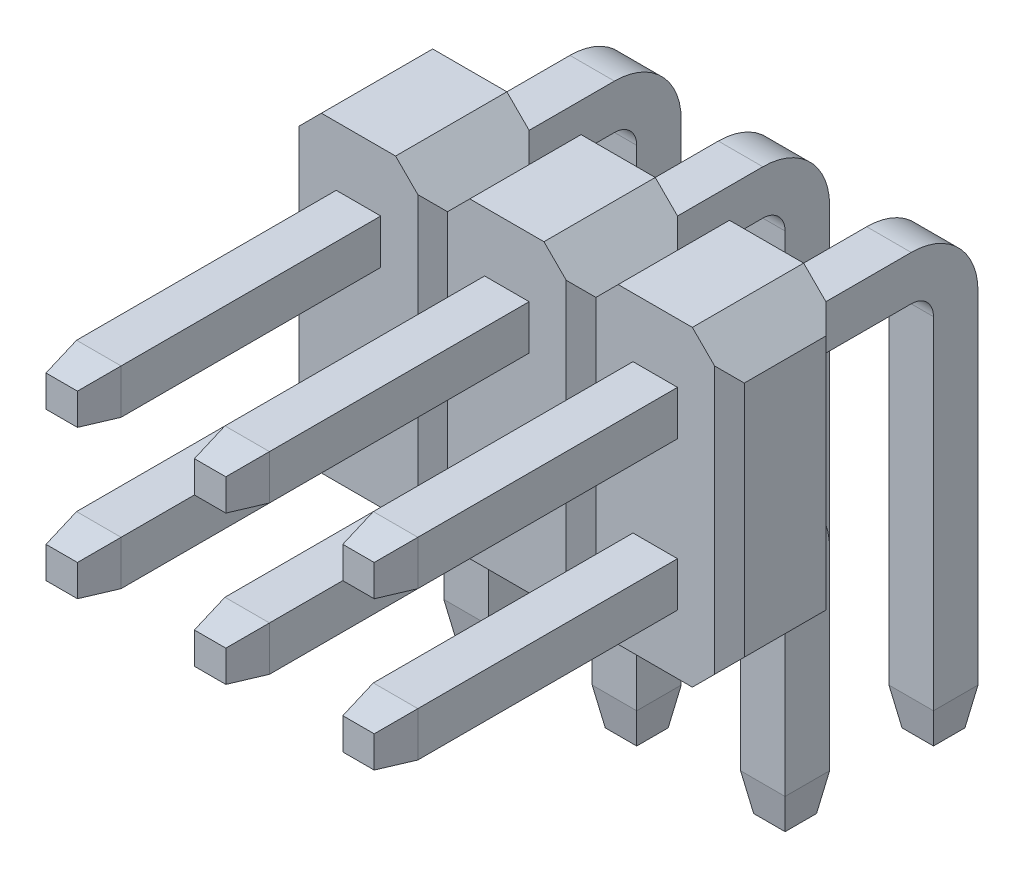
ISO-10303-21;
HEADER;
FILE_DESCRIPTION(('STEP AP214'),'2;1');
FILE_NAME('part.step','',(''),(''),'','','');
FILE_SCHEMA(('AUTOMOTIVE_DESIGN { 1 0 10303 214 1 1 1 1 }'));
ENDSEC;
DATA;
#1=APPLICATION_CONTEXT('core data for automotive mechanical design processes');
#2=APPLICATION_PROTOCOL_DEFINITION('international standard','automotive_design',2000,#1);
#3=PRODUCT_CONTEXT('',#1,'mechanical');
#4=PRODUCT('Part','Part','',(#3));
#5=PRODUCT_RELATED_PRODUCT_CATEGORY('part','',(#4));
#6=PRODUCT_DEFINITION_FORMATION('','',#4);
#7=PRODUCT_DEFINITION_CONTEXT('part definition',#1,'design');
#8=PRODUCT_DEFINITION('design','',#6,#7);
#9=PRODUCT_DEFINITION_SHAPE('','',#8);
#10=(LENGTH_UNIT() NAMED_UNIT(*) SI_UNIT(.MILLI.,.METRE.));
#11=(NAMED_UNIT(*) PLANE_ANGLE_UNIT() SI_UNIT($,.RADIAN.));
#12=(NAMED_UNIT(*) SI_UNIT($,.STERADIAN.) SOLID_ANGLE_UNIT());
#13=UNCERTAINTY_MEASURE_WITH_UNIT(LENGTH_MEASURE(1.E-05),#10,'distance_accuracy_value','');
#14=(GEOMETRIC_REPRESENTATION_CONTEXT(3) GLOBAL_UNCERTAINTY_ASSIGNED_CONTEXT((#13)) GLOBAL_UNIT_ASSIGNED_CONTEXT((#10,
#11,#12)) REPRESENTATION_CONTEXT('',''));
#15=CARTESIAN_POINT('',(0.,0.,0.));
#16=DIRECTION('',(0.,0.,1.));
#17=DIRECTION('',(1.,0.,0.));
#18=AXIS2_PLACEMENT_3D('',#15,#16,#17);
#19=CARTESIAN_POINT('',(-3.,4.2,3.75));
#20=DIRECTION('',(0.,0.,-1.));
#21=DIRECTION('',(-1.,0.,0.));
#22=AXIS2_PLACEMENT_3D('',#19,#20,#21);
#23=PLANE('',#22);
#24=DIRECTION('',(-1.,0.,0.));
#25=VECTOR('',#24,1.);
#26=CARTESIAN_POINT('',(-3.,3.4,3.75));
#27=LINE('',#26,#25);
#28=CARTESIAN_POINT('',(-3.7,3.4,3.75));
#29=VERTEX_POINT('',#28);
#30=CARTESIAN_POINT('',(-4.3,3.4,3.75));
#31=VERTEX_POINT('',#30);
#32=EDGE_CURVE('E1241',#29,#31,#27,.T.);
#33=ORIENTED_EDGE('',*,*,#32,.F.);
#34=DIRECTION('',(0.,-1.,0.));
#35=VECTOR('',#34,1.);
#36=CARTESIAN_POINT('',(-3.7,4.2,3.75));
#37=LINE('',#36,#35);
#38=CARTESIAN_POINT('',(-3.7,2.8,3.75));
#39=VERTEX_POINT('',#38);
#40=EDGE_CURVE('E1189',#29,#39,#37,.T.);
#41=ORIENTED_EDGE('',*,*,#40,.T.);
#42=DIRECTION('',(1.,0.,0.));
#43=VECTOR('',#42,1.);
#44=CARTESIAN_POINT('',(-3.,2.8,3.75));
#45=LINE('',#44,#43);
#46=CARTESIAN_POINT('',(-4.3,2.8,3.75));
#47=VERTEX_POINT('',#46);
#48=EDGE_CURVE('E1233',#47,#39,#45,.T.);
#49=ORIENTED_EDGE('',*,*,#48,.F.);
#50=DIRECTION('',(0.,-1.,0.));
#51=VECTOR('',#50,1.);
#52=CARTESIAN_POINT('',(-4.3,4.2,3.75));
#53=LINE('',#52,#51);
#54=EDGE_CURVE('E1238',#31,#47,#53,.T.);
#55=ORIENTED_EDGE('',*,*,#54,.F.);
#56=EDGE_LOOP('',(#33,#41,#49,#55));
#57=FACE_BOUND('',#56,.T.);
#58=DIRECTION('',(-0.707106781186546,-0.707106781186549,0.));
#59=VECTOR('',#58,1.);
#60=CARTESIAN_POINT('',(-5.,3.7,3.75));
#61=LINE('',#60,#59);
#62=CARTESIAN_POINT('',(-4.5,4.2,3.75));
#63=VERTEX_POINT('',#62);
#64=CARTESIAN_POINT('',(-4.8,3.9,3.75));
#65=VERTEX_POINT('',#64);
#66=EDGE_CURVE('E1430',#63,#65,#61,.T.);
#67=ORIENTED_EDGE('',*,*,#66,.T.);
#68=DIRECTION('',(0.,-1.,0.));
#69=VECTOR('',#68,1.);
#70=CARTESIAN_POINT('',(-4.8,4.2,3.75));
#71=LINE('',#70,#69);
#72=CARTESIAN_POINT('',(-4.8,0.300000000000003,3.75));
#73=VERTEX_POINT('',#72);
#74=EDGE_CURVE('E1483',#65,#73,#71,.T.);
#75=ORIENTED_EDGE('',*,*,#74,.T.);
#76=DIRECTION('',(0.707106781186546,-0.707106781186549,0.));
#77=VECTOR('',#76,1.);
#78=CARTESIAN_POINT('',(-5.,0.500000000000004,3.75));
#79=LINE('',#78,#77);
#80=CARTESIAN_POINT('',(-4.5,0.,3.75));
#81=VERTEX_POINT('',#80);
#82=EDGE_CURVE('E1434',#73,#81,#79,.T.);
#83=ORIENTED_EDGE('',*,*,#82,.T.);
#84=DIRECTION('',(1.,0.,0.));
#85=VECTOR('',#84,1.);
#86=CARTESIAN_POINT('',(-4.5,0.,3.75));
#87=LINE('',#86,#85);
#88=CARTESIAN_POINT('',(-3.5,0.,3.75));
#89=VERTEX_POINT('',#88);
#90=EDGE_CURVE('E1436',#81,#89,#87,.T.);
#91=ORIENTED_EDGE('',*,*,#90,.T.);
#92=DIRECTION('',(0.707106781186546,0.707106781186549,0.));
#93=VECTOR('',#92,1.);
#94=CARTESIAN_POINT('',(-3.5,0.,3.75));
#95=LINE('',#94,#93);
#96=CARTESIAN_POINT('',(-3.2,0.300000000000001,3.75));
#97=VERTEX_POINT('',#96);
#98=EDGE_CURVE('E1438',#89,#97,#95,.T.);
#99=ORIENTED_EDGE('',*,*,#98,.T.);
#100=DIRECTION('',(0.,1.,0.));
#101=VECTOR('',#100,1.);
#102=CARTESIAN_POINT('',(-3.2,4.2,3.75));
#103=LINE('',#102,#101);
#104=CARTESIAN_POINT('',(-3.2,3.9,3.75));
#105=VERTEX_POINT('',#104);
#106=EDGE_CURVE('E1480',#97,#105,#103,.T.);
#107=ORIENTED_EDGE('',*,*,#106,.T.);
#108=DIRECTION('',(-0.707106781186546,0.707106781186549,0.));
#109=VECTOR('',#108,1.);
#110=CARTESIAN_POINT('',(-3.5,4.2,3.75));
#111=LINE('',#110,#109);
#112=CARTESIAN_POINT('',(-3.5,4.2,3.75));
#113=VERTEX_POINT('',#112);
#114=EDGE_CURVE('E1441',#105,#113,#111,.T.);
#115=ORIENTED_EDGE('',*,*,#114,.T.);
#116=DIRECTION('',(-1.,0.,0.));
#117=VECTOR('',#116,1.);
#118=CARTESIAN_POINT('',(-4.5,4.2,3.75));
#119=LINE('',#118,#117);
#120=EDGE_CURVE('E1427',#113,#63,#119,.T.);
#121=ORIENTED_EDGE('',*,*,#120,.T.);
#122=EDGE_LOOP('',(#67,#75,#83,#91,#99,#107,#115,#121));
#123=FACE_BOUND('',#122,.T.);
#124=DIRECTION('',(-1.,0.,0.));
#125=VECTOR('',#124,1.);
#126=CARTESIAN_POINT('',(-3.,1.4,3.75));
#127=LINE('',#126,#125);
#128=CARTESIAN_POINT('',(-3.7,1.4,3.75));
#129=VERTEX_POINT('',#128);
#130=CARTESIAN_POINT('',(-4.3,1.4,3.75));
#131=VERTEX_POINT('',#130);
#132=EDGE_CURVE('E830',#129,#131,#127,.T.);
#133=ORIENTED_EDGE('',*,*,#132,.F.);
#134=DIRECTION('',(0.,-1.,0.));
#135=VECTOR('',#134,1.);
#136=CARTESIAN_POINT('',(-3.7,4.2,3.75));
#137=LINE('',#136,#135);
#138=CARTESIAN_POINT('',(-3.7,0.8,3.75));
#139=VERTEX_POINT('',#138);
#140=EDGE_CURVE('E794',#129,#139,#137,.T.);
#141=ORIENTED_EDGE('',*,*,#140,.T.);
#142=DIRECTION('',(1.,0.,0.));
#143=VECTOR('',#142,1.);
#144=CARTESIAN_POINT('',(-3.,0.8,3.75));
#145=LINE('',#144,#143);
#146=CARTESIAN_POINT('',(-4.3,0.8,3.75));
#147=VERTEX_POINT('',#146);
#148=EDGE_CURVE('E49',#147,#139,#145,.T.);
#149=ORIENTED_EDGE('',*,*,#148,.F.);
#150=DIRECTION('',(0.,-1.,0.));
#151=VECTOR('',#150,1.);
#152=CARTESIAN_POINT('',(-4.3,4.2,3.75));
#153=LINE('',#152,#151);
#154=EDGE_CURVE('E827',#131,#147,#153,.T.);
#155=ORIENTED_EDGE('',*,*,#154,.F.);
#156=EDGE_LOOP('',(#133,#141,#149,#155));
#157=FACE_BOUND('',#156,.T.);
#158=ADVANCED_FACE('F32',(#57,#123,#157),#23,.F.);
#159=CARTESIAN_POINT('',(-1.,4.2,3.75));
#160=DIRECTION('',(0.,0.,-1.));
#161=DIRECTION('',(-1.,0.,0.));
#162=AXIS2_PLACEMENT_3D('',#159,#160,#161);
#163=PLANE('',#162);
#164=DIRECTION('',(-1.,0.,0.));
#165=VECTOR('',#164,1.);
#166=CARTESIAN_POINT('',(-1.,3.4,3.75));
#167=LINE('',#166,#165);
#168=CARTESIAN_POINT('',(-1.7,3.4,3.75));
#169=VERTEX_POINT('',#168);
#170=CARTESIAN_POINT('',(-2.3,3.4,3.75));
#171=VERTEX_POINT('',#170);
#172=EDGE_CURVE('E1296',#169,#171,#167,.T.);
#173=ORIENTED_EDGE('',*,*,#172,.F.);
#174=DIRECTION('',(0.,-1.,0.));
#175=VECTOR('',#174,1.);
#176=CARTESIAN_POINT('',(-1.7,4.2,3.75));
#177=LINE('',#176,#175);
#178=CARTESIAN_POINT('',(-1.7,2.8,3.75));
#179=VERTEX_POINT('',#178);
#180=EDGE_CURVE('E1244',#169,#179,#177,.T.);
#181=ORIENTED_EDGE('',*,*,#180,.T.);
#182=DIRECTION('',(1.,0.,0.));
#183=VECTOR('',#182,1.);
#184=CARTESIAN_POINT('',(-1.,2.8,3.75));
#185=LINE('',#184,#183);
#186=CARTESIAN_POINT('',(-2.3,2.8,3.75));
#187=VERTEX_POINT('',#186);
#188=EDGE_CURVE('E1288',#187,#179,#185,.T.);
#189=ORIENTED_EDGE('',*,*,#188,.F.);
#190=DIRECTION('',(0.,-1.,0.));
#191=VECTOR('',#190,1.);
#192=CARTESIAN_POINT('',(-2.3,4.2,3.75));
#193=LINE('',#192,#191);
#194=EDGE_CURVE('E1293',#171,#187,#193,.T.);
#195=ORIENTED_EDGE('',*,*,#194,.F.);
#196=EDGE_LOOP('',(#173,#181,#189,#195));
#197=FACE_BOUND('',#196,.T.);
#198=DIRECTION('',(-0.707106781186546,-0.707106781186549,0.));
#199=VECTOR('',#198,1.);
#200=CARTESIAN_POINT('',(-3.,3.7,3.75));
#201=LINE('',#200,#199);
#202=CARTESIAN_POINT('',(-2.5,4.2,3.75));
#203=VERTEX_POINT('',#202);
#204=CARTESIAN_POINT('',(-2.8,3.9,3.75));
#205=VERTEX_POINT('',#204);
#206=EDGE_CURVE('E1519',#203,#205,#201,.T.);
#207=ORIENTED_EDGE('',*,*,#206,.T.);
#208=DIRECTION('',(0.,-1.,0.));
#209=VECTOR('',#208,1.);
#210=CARTESIAN_POINT('',(-2.8,4.2,3.75));
#211=LINE('',#210,#209);
#212=CARTESIAN_POINT('',(-2.8,0.300000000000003,3.75));
#213=VERTEX_POINT('',#212);
#214=EDGE_CURVE('E1571',#205,#213,#211,.T.);
#215=ORIENTED_EDGE('',*,*,#214,.T.);
#216=DIRECTION('',(0.707106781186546,-0.707106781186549,0.));
#217=VECTOR('',#216,1.);
#218=CARTESIAN_POINT('',(-3.,0.500000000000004,3.75));
#219=LINE('',#218,#217);
#220=CARTESIAN_POINT('',(-2.5,0.,3.75));
#221=VERTEX_POINT('',#220);
#222=EDGE_CURVE('E1523',#213,#221,#219,.T.);
#223=ORIENTED_EDGE('',*,*,#222,.T.);
#224=DIRECTION('',(1.,0.,0.));
#225=VECTOR('',#224,1.);
#226=CARTESIAN_POINT('',(-2.5,0.,3.75));
#227=LINE('',#226,#225);
#228=CARTESIAN_POINT('',(-1.5,0.,3.75));
#229=VERTEX_POINT('',#228);
#230=EDGE_CURVE('E1525',#221,#229,#227,.T.);
#231=ORIENTED_EDGE('',*,*,#230,.T.);
#232=DIRECTION('',(0.707106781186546,0.707106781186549,0.));
#233=VECTOR('',#232,1.);
#234=CARTESIAN_POINT('',(-1.5,0.,3.75));
#235=LINE('',#234,#233);
#236=CARTESIAN_POINT('',(-1.2,0.300000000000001,3.75));
#237=VERTEX_POINT('',#236);
#238=EDGE_CURVE('E1527',#229,#237,#235,.T.);
#239=ORIENTED_EDGE('',*,*,#238,.T.);
#240=DIRECTION('',(0.,1.,0.));
#241=VECTOR('',#240,1.);
#242=CARTESIAN_POINT('',(-1.2,4.2,3.75));
#243=LINE('',#242,#241);
#244=CARTESIAN_POINT('',(-1.2,3.9,3.75));
#245=VERTEX_POINT('',#244);
#246=EDGE_CURVE('E1568',#237,#245,#243,.T.);
#247=ORIENTED_EDGE('',*,*,#246,.T.);
#248=DIRECTION('',(-0.707106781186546,0.707106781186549,0.));
#249=VECTOR('',#248,1.);
#250=CARTESIAN_POINT('',(-1.5,4.2,3.75));
#251=LINE('',#250,#249);
#252=CARTESIAN_POINT('',(-1.5,4.2,3.75));
#253=VERTEX_POINT('',#252);
#254=EDGE_CURVE('E1530',#245,#253,#251,.T.);
#255=ORIENTED_EDGE('',*,*,#254,.T.);
#256=DIRECTION('',(-1.,0.,0.));
#257=VECTOR('',#256,1.);
#258=CARTESIAN_POINT('',(-2.5,4.2,3.75));
#259=LINE('',#258,#257);
#260=EDGE_CURVE('E1516',#253,#203,#259,.T.);
#261=ORIENTED_EDGE('',*,*,#260,.T.);
#262=EDGE_LOOP('',(#207,#215,#223,#231,#239,#247,#255,#261));
#263=FACE_BOUND('',#262,.T.);
#264=DIRECTION('',(-1.,0.,0.));
#265=VECTOR('',#264,1.);
#266=CARTESIAN_POINT('',(-1.,1.4,3.75));
#267=LINE('',#266,#265);
#268=CARTESIAN_POINT('',(-1.7,1.4,3.75));
#269=VERTEX_POINT('',#268);
#270=CARTESIAN_POINT('',(-2.3,1.4,3.75));
#271=VERTEX_POINT('',#270);
#272=EDGE_CURVE('E882',#269,#271,#267,.T.);
#273=ORIENTED_EDGE('',*,*,#272,.F.);
#274=DIRECTION('',(0.,-1.,0.));
#275=VECTOR('',#274,1.);
#276=CARTESIAN_POINT('',(-1.7,4.2,3.75));
#277=LINE('',#276,#275);
#278=CARTESIAN_POINT('',(-1.7,0.8,3.75));
#279=VERTEX_POINT('',#278);
#280=EDGE_CURVE('E832',#269,#279,#277,.T.);
#281=ORIENTED_EDGE('',*,*,#280,.T.);
#282=DIRECTION('',(1.,0.,0.));
#283=VECTOR('',#282,1.);
#284=CARTESIAN_POINT('',(-1.,0.8,3.75));
#285=LINE('',#284,#283);
#286=CARTESIAN_POINT('',(-2.3,0.8,3.75));
#287=VERTEX_POINT('',#286);
#288=EDGE_CURVE('E57',#287,#279,#285,.T.);
#289=ORIENTED_EDGE('',*,*,#288,.F.);
#290=DIRECTION('',(0.,-1.,0.));
#291=VECTOR('',#290,1.);
#292=CARTESIAN_POINT('',(-2.3,4.2,3.75));
#293=LINE('',#292,#291);
#294=EDGE_CURVE('E879',#271,#287,#293,.T.);
#295=ORIENTED_EDGE('',*,*,#294,.F.);
#296=EDGE_LOOP('',(#273,#281,#289,#295));
#297=FACE_BOUND('',#296,.T.);
#298=ADVANCED_FACE('F1853',(#197,#263,#297),#163,.F.);
#299=CARTESIAN_POINT('',(-3.,4.2,2.25));
#300=DIRECTION('',(0.,0.,-1.));
#301=DIRECTION('',(-1.,0.,0.));
#302=AXIS2_PLACEMENT_3D('',#299,#300,#301);
#303=PLANE('',#302);
#304=DIRECTION('',(0.,-1.,0.));
#305=VECTOR('',#304,1.);
#306=CARTESIAN_POINT('',(-4.3,4.2,2.25));
#307=LINE('',#306,#305);
#308=CARTESIAN_POINT('',(-4.3,3.4,2.25));
#309=VERTEX_POINT('',#308);
#310=CARTESIAN_POINT('',(-4.3,2.8,2.25));
#311=VERTEX_POINT('',#310);
#312=EDGE_CURVE('E1088',#309,#311,#307,.T.);
#313=ORIENTED_EDGE('',*,*,#312,.T.);
#314=DIRECTION('',(1.,0.,0.));
#315=VECTOR('',#314,1.);
#316=CARTESIAN_POINT('',(-3.,2.8,2.25));
#317=LINE('',#316,#315);
#318=CARTESIAN_POINT('',(-3.7,2.8,2.25));
#319=VERTEX_POINT('',#318);
#320=EDGE_CURVE('E1093',#311,#319,#317,.T.);
#321=ORIENTED_EDGE('',*,*,#320,.T.);
#322=DIRECTION('',(0.,-1.,0.));
#323=VECTOR('',#322,1.);
#324=CARTESIAN_POINT('',(-3.7,4.2,2.25));
#325=LINE('',#324,#323);
#326=CARTESIAN_POINT('',(-3.7,3.4,2.25));
#327=VERTEX_POINT('',#326);
#328=EDGE_CURVE('E1019',#327,#319,#325,.T.);
#329=ORIENTED_EDGE('',*,*,#328,.F.);
#330=DIRECTION('',(-1.,0.,0.));
#331=VECTOR('',#330,1.);
#332=CARTESIAN_POINT('',(-3.,3.4,2.25));
#333=LINE('',#332,#331);
#334=EDGE_CURVE('E1070',#327,#309,#333,.T.);
#335=ORIENTED_EDGE('',*,*,#334,.T.);
#336=EDGE_LOOP('',(#313,#321,#329,#335));
#337=FACE_BOUND('',#336,.T.);
#338=DIRECTION('',(-1.,0.,0.));
#339=VECTOR('',#338,1.);
#340=CARTESIAN_POINT('',(-3.7,1.32915619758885,2.25));
#341=LINE('',#340,#339);
#342=CARTESIAN_POINT('',(-3.7,1.32915619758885,2.25));
#343=VERTEX_POINT('',#342);
#344=CARTESIAN_POINT('',(-4.3,1.32915619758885,2.25));
#345=VERTEX_POINT('',#344);
#346=EDGE_CURVE('E937',#343,#345,#341,.T.);
#347=ORIENTED_EDGE('',*,*,#346,.T.);
#348=DIRECTION('',(0.,-1.,0.));
#349=VECTOR('',#348,1.);
#350=CARTESIAN_POINT('',(-4.3,4.2,2.25));
#351=LINE('',#350,#349);
#352=CARTESIAN_POINT('',(-4.3,0.,2.25));
#353=VERTEX_POINT('',#352);
#354=EDGE_CURVE('E950',#345,#353,#351,.T.);
#355=ORIENTED_EDGE('',*,*,#354,.T.);
#356=DIRECTION('',(1.,0.,0.));
#357=VECTOR('',#356,1.);
#358=CARTESIAN_POINT('',(-4.5,0.,2.25));
#359=LINE('',#358,#357);
#360=CARTESIAN_POINT('',(-4.5,0.,2.25));
#361=VERTEX_POINT('',#360);
#362=EDGE_CURVE('E1452',#361,#353,#359,.T.);
#363=ORIENTED_EDGE('',*,*,#362,.F.);
#364=DIRECTION('',(0.707106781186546,-0.707106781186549,0.));
#365=VECTOR('',#364,1.);
#366=CARTESIAN_POINT('',(-5.,0.500000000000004,2.25));
#367=LINE('',#366,#365);
#368=CARTESIAN_POINT('',(-4.8,0.300000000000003,2.25));
#369=VERTEX_POINT('',#368);
#370=EDGE_CURVE('E1449',#369,#361,#367,.T.);
#371=ORIENTED_EDGE('',*,*,#370,.F.);
#372=DIRECTION('',(0.,-1.,0.));
#373=VECTOR('',#372,1.);
#374=CARTESIAN_POINT('',(-4.8,4.2,2.25));
#375=LINE('',#374,#373);
#376=CARTESIAN_POINT('',(-4.8,3.9,2.25));
#377=VERTEX_POINT('',#376);
#378=EDGE_CURVE('E1476',#377,#369,#375,.T.);
#379=ORIENTED_EDGE('',*,*,#378,.F.);
#380=DIRECTION('',(-0.707106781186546,-0.707106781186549,0.));
#381=VECTOR('',#380,1.);
#382=CARTESIAN_POINT('',(-5.,3.7,2.25));
#383=LINE('',#382,#381);
#384=CARTESIAN_POINT('',(-4.5,4.2,2.25));
#385=VERTEX_POINT('',#384);
#386=EDGE_CURVE('E1446',#385,#377,#383,.T.);
#387=ORIENTED_EDGE('',*,*,#386,.F.);
#388=DIRECTION('',(-1.,0.,0.));
#389=VECTOR('',#388,1.);
#390=CARTESIAN_POINT('',(-4.5,4.2,2.25));
#391=LINE('',#390,#389);
#392=CARTESIAN_POINT('',(-3.5,4.2,2.25));
#393=VERTEX_POINT('',#392);
#394=EDGE_CURVE('E1426',#393,#385,#391,.T.);
#395=ORIENTED_EDGE('',*,*,#394,.F.);
#396=DIRECTION('',(-0.707106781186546,0.707106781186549,0.));
#397=VECTOR('',#396,1.);
#398=CARTESIAN_POINT('',(-3.5,4.2,2.25));
#399=LINE('',#398,#397);
#400=CARTESIAN_POINT('',(-3.2,3.9,2.25));
#401=VERTEX_POINT('',#400);
#402=EDGE_CURVE('E1431',#401,#393,#399,.T.);
#403=ORIENTED_EDGE('',*,*,#402,.F.);
#404=DIRECTION('',(0.,1.,0.));
#405=VECTOR('',#404,1.);
#406=CARTESIAN_POINT('',(-3.2,4.2,2.25));
#407=LINE('',#406,#405);
#408=CARTESIAN_POINT('',(-3.2,0.300000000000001,2.25));
#409=VERTEX_POINT('',#408);
#410=EDGE_CURVE('E1478',#409,#401,#407,.T.);
#411=ORIENTED_EDGE('',*,*,#410,.F.);
#412=DIRECTION('',(0.707106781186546,0.707106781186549,0.));
#413=VECTOR('',#412,1.);
#414=CARTESIAN_POINT('',(-3.5,0.,2.25));
#415=LINE('',#414,#413);
#416=CARTESIAN_POINT('',(-3.5,0.,2.25));
#417=VERTEX_POINT('',#416);
#418=EDGE_CURVE('E1455',#417,#409,#415,.T.);
#419=ORIENTED_EDGE('',*,*,#418,.F.);
#420=CARTESIAN_POINT('',(-3.7,0.,2.25));
#421=VERTEX_POINT('',#420);
#422=EDGE_CURVE('E1451',#421,#417,#359,.T.);
#423=ORIENTED_EDGE('',*,*,#422,.F.);
#424=DIRECTION('',(0.,-1.,0.));
#425=VECTOR('',#424,1.);
#426=CARTESIAN_POINT('',(-3.7,4.2,2.25));
#427=LINE('',#426,#425);
#428=EDGE_CURVE('E932',#343,#421,#427,.T.);
#429=ORIENTED_EDGE('',*,*,#428,.F.);
#430=EDGE_LOOP('',(#347,#355,#363,#371,#379,#387,#395,#403,#411,#419,#423,#429));
#431=FACE_BOUND('',#430,.T.);
#432=ADVANCED_FACE('F1859',(#337,#431),#303,.T.);
#433=CARTESIAN_POINT('',(-4.5,0.,3.75));
#434=DIRECTION('',(0.,1.,0.));
#435=DIRECTION('',(0.,0.,1.));
#436=AXIS2_PLACEMENT_3D('',#433,#434,#435);
#437=PLANE('',#436);
#438=DIRECTION('',(0.,0.,-1.));
#439=VECTOR('',#438,1.);
#440=CARTESIAN_POINT('',(-4.3,0.,3.75));
#441=LINE('',#440,#439);
#442=CARTESIAN_POINT('',(-4.3,0.,2.3));
#443=VERTEX_POINT('',#442);
#444=EDGE_CURVE('E947',#443,#353,#441,.T.);
#445=ORIENTED_EDGE('',*,*,#444,.F.);
#446=DIRECTION('',(-1.,0.,0.));
#447=VECTOR('',#446,1.);
#448=CARTESIAN_POINT('',(-4.5,0.,2.3));
#449=LINE('',#448,#447);
#450=CARTESIAN_POINT('',(-3.7,0.,2.3));
#451=VERTEX_POINT('',#450);
#452=EDGE_CURVE('E885',#451,#443,#449,.T.);
#453=ORIENTED_EDGE('',*,*,#452,.F.);
#454=DIRECTION('',(0.,0.,-1.));
#455=VECTOR('',#454,1.);
#456=CARTESIAN_POINT('',(-3.7,0.,3.75));
#457=LINE('',#456,#455);
#458=EDGE_CURVE('E935',#451,#421,#457,.T.);
#459=ORIENTED_EDGE('',*,*,#458,.T.);
#460=ORIENTED_EDGE('',*,*,#422,.T.);
#461=DIRECTION('',(0.,0.,-1.));
#462=VECTOR('',#461,1.);
#463=CARTESIAN_POINT('',(-3.5,0.,3.75));
#464=LINE('',#463,#462);
#465=EDGE_CURVE('E1461',#89,#417,#464,.T.);
#466=ORIENTED_EDGE('',*,*,#465,.F.);
#467=ORIENTED_EDGE('',*,*,#90,.F.);
#468=DIRECTION('',(0.,0.,-1.));
#469=VECTOR('',#468,1.);
#470=CARTESIAN_POINT('',(-4.5,0.,3.75));
#471=LINE('',#470,#469);
#472=EDGE_CURVE('E1464',#81,#361,#471,.T.);
#473=ORIENTED_EDGE('',*,*,#472,.T.);
#474=ORIENTED_EDGE('',*,*,#362,.T.);
#475=EDGE_LOOP('',(#445,#453,#459,#460,#466,#467,#473,#474));
#476=FACE_BOUND('',#475,.T.);
#477=ADVANCED_FACE('F1870',(#476),#437,.F.);
#478=CARTESIAN_POINT('',(-1.,4.2,2.25));
#479=DIRECTION('',(0.,0.,-1.));
#480=DIRECTION('',(-1.,0.,0.));
#481=AXIS2_PLACEMENT_3D('',#478,#479,#480);
#482=PLANE('',#481);
#483=DIRECTION('',(0.,-1.,0.));
#484=VECTOR('',#483,1.);
#485=CARTESIAN_POINT('',(-2.3,4.2,2.25));
#486=LINE('',#485,#484);
#487=CARTESIAN_POINT('',(-2.3,3.4,2.25));
#488=VERTEX_POINT('',#487);
#489=CARTESIAN_POINT('',(-2.3,2.8,2.25));
#490=VERTEX_POINT('',#489);
#491=EDGE_CURVE('E1173',#488,#490,#486,.T.);
#492=ORIENTED_EDGE('',*,*,#491,.T.);
#493=DIRECTION('',(1.,0.,0.));
#494=VECTOR('',#493,1.);
#495=CARTESIAN_POINT('',(-1.,2.8,2.25));
#496=LINE('',#495,#494);
#497=CARTESIAN_POINT('',(-1.7,2.8,2.25));
#498=VERTEX_POINT('',#497);
#499=EDGE_CURVE('E1178',#490,#498,#496,.T.);
#500=ORIENTED_EDGE('',*,*,#499,.T.);
#501=DIRECTION('',(0.,-1.,0.));
#502=VECTOR('',#501,1.);
#503=CARTESIAN_POINT('',(-1.7,4.2,2.25));
#504=LINE('',#503,#502);
#505=CARTESIAN_POINT('',(-1.7,3.4,2.25));
#506=VERTEX_POINT('',#505);
#507=EDGE_CURVE('E1104',#506,#498,#504,.T.);
#508=ORIENTED_EDGE('',*,*,#507,.F.);
#509=DIRECTION('',(-1.,0.,0.));
#510=VECTOR('',#509,1.);
#511=CARTESIAN_POINT('',(-1.,3.4,2.25));
#512=LINE('',#511,#510);
#513=EDGE_CURVE('E1155',#506,#488,#512,.T.);
#514=ORIENTED_EDGE('',*,*,#513,.T.);
#515=EDGE_LOOP('',(#492,#500,#508,#514));
#516=FACE_BOUND('',#515,.T.);
#517=DIRECTION('',(-1.,0.,0.));
#518=VECTOR('',#517,1.);
#519=CARTESIAN_POINT('',(-1.7,1.32915619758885,2.25));
#520=LINE('',#519,#518);
#521=CARTESIAN_POINT('',(-1.7,1.32915619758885,2.25));
#522=VERTEX_POINT('',#521);
#523=CARTESIAN_POINT('',(-2.3,1.32915619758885,2.25));
#524=VERTEX_POINT('',#523);
#525=EDGE_CURVE('E1004',#522,#524,#520,.T.);
#526=ORIENTED_EDGE('',*,*,#525,.T.);
#527=DIRECTION('',(0.,-1.,0.));
#528=VECTOR('',#527,1.);
#529=CARTESIAN_POINT('',(-2.3,4.2,2.25));
#530=LINE('',#529,#528);
#531=CARTESIAN_POINT('',(-2.3,0.,2.25));
#532=VERTEX_POINT('',#531);
#533=EDGE_CURVE('E1017',#524,#532,#530,.T.);
#534=ORIENTED_EDGE('',*,*,#533,.T.);
#535=DIRECTION('',(1.,0.,0.));
#536=VECTOR('',#535,1.);
#537=CARTESIAN_POINT('',(-2.5,0.,2.25));
#538=LINE('',#537,#536);
#539=CARTESIAN_POINT('',(-2.5,0.,2.25));
#540=VERTEX_POINT('',#539);
#541=EDGE_CURVE('E1541',#540,#532,#538,.T.);
#542=ORIENTED_EDGE('',*,*,#541,.F.);
#543=DIRECTION('',(0.707106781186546,-0.707106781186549,0.));
#544=VECTOR('',#543,1.);
#545=CARTESIAN_POINT('',(-3.,0.500000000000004,2.25));
#546=LINE('',#545,#544);
#547=CARTESIAN_POINT('',(-2.8,0.300000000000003,2.25));
#548=VERTEX_POINT('',#547);
#549=EDGE_CURVE('E1538',#548,#540,#546,.T.);
#550=ORIENTED_EDGE('',*,*,#549,.F.);
#551=DIRECTION('',(0.,-1.,0.));
#552=VECTOR('',#551,1.);
#553=CARTESIAN_POINT('',(-2.8,4.2,2.25));
#554=LINE('',#553,#552);
#555=CARTESIAN_POINT('',(-2.8,3.9,2.25));
#556=VERTEX_POINT('',#555);
#557=EDGE_CURVE('E1564',#556,#548,#554,.T.);
#558=ORIENTED_EDGE('',*,*,#557,.F.);
#559=DIRECTION('',(-0.707106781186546,-0.707106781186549,0.));
#560=VECTOR('',#559,1.);
#561=CARTESIAN_POINT('',(-3.,3.7,2.25));
#562=LINE('',#561,#560);
#563=CARTESIAN_POINT('',(-2.5,4.2,2.25));
#564=VERTEX_POINT('',#563);
#565=EDGE_CURVE('E1535',#564,#556,#562,.T.);
#566=ORIENTED_EDGE('',*,*,#565,.F.);
#567=DIRECTION('',(-1.,0.,0.));
#568=VECTOR('',#567,1.);
#569=CARTESIAN_POINT('',(-2.5,4.2,2.25));
#570=LINE('',#569,#568);
#571=CARTESIAN_POINT('',(-1.5,4.2,2.25));
#572=VERTEX_POINT('',#571);
#573=EDGE_CURVE('E1515',#572,#564,#570,.T.);
#574=ORIENTED_EDGE('',*,*,#573,.F.);
#575=DIRECTION('',(-0.707106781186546,0.707106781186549,0.));
#576=VECTOR('',#575,1.);
#577=CARTESIAN_POINT('',(-1.5,4.2,2.25));
#578=LINE('',#577,#576);
#579=CARTESIAN_POINT('',(-1.2,3.9,2.25));
#580=VERTEX_POINT('',#579);
#581=EDGE_CURVE('E1520',#580,#572,#578,.T.);
#582=ORIENTED_EDGE('',*,*,#581,.F.);
#583=DIRECTION('',(0.,1.,0.));
#584=VECTOR('',#583,1.);
#585=CARTESIAN_POINT('',(-1.2,4.2,2.25));
#586=LINE('',#585,#584);
#587=CARTESIAN_POINT('',(-1.2,0.300000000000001,2.25));
#588=VERTEX_POINT('',#587);
#589=EDGE_CURVE('E1566',#588,#580,#586,.T.);
#590=ORIENTED_EDGE('',*,*,#589,.F.);
#591=DIRECTION('',(0.707106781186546,0.707106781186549,0.));
#592=VECTOR('',#591,1.);
#593=CARTESIAN_POINT('',(-1.5,0.,2.25));
#594=LINE('',#593,#592);
#595=CARTESIAN_POINT('',(-1.5,0.,2.25));
#596=VERTEX_POINT('',#595);
#597=EDGE_CURVE('E1544',#596,#588,#594,.T.);
#598=ORIENTED_EDGE('',*,*,#597,.F.);
#599=CARTESIAN_POINT('',(-1.7,0.,2.25));
#600=VERTEX_POINT('',#599);
#601=EDGE_CURVE('E1540',#600,#596,#538,.T.);
#602=ORIENTED_EDGE('',*,*,#601,.F.);
#603=DIRECTION('',(0.,-1.,0.));
#604=VECTOR('',#603,1.);
#605=CARTESIAN_POINT('',(-1.7,4.2,2.25));
#606=LINE('',#605,#604);
#607=EDGE_CURVE('E999',#522,#600,#606,.T.);
#608=ORIENTED_EDGE('',*,*,#607,.F.);
#609=EDGE_LOOP('',(#526,#534,#542,#550,#558,#566,#574,#582,#590,#598,#602,#608));
#610=FACE_BOUND('',#609,.T.);
#611=ADVANCED_FACE('F1884',(#516,#610),#482,.T.);
#612=CARTESIAN_POINT('',(-2.5,0.,3.75));
#613=DIRECTION('',(0.,1.,0.));
#614=DIRECTION('',(0.,0.,1.));
#615=AXIS2_PLACEMENT_3D('',#612,#613,#614);
#616=PLANE('',#615);
#617=DIRECTION('',(0.,0.,-1.));
#618=VECTOR('',#617,1.);
#619=CARTESIAN_POINT('',(-2.3,0.,3.75));
#620=LINE('',#619,#618);
#621=CARTESIAN_POINT('',(-2.3,0.,2.3));
#622=VERTEX_POINT('',#621);
#623=EDGE_CURVE('E1014',#622,#532,#620,.T.);
#624=ORIENTED_EDGE('',*,*,#623,.F.);
#625=DIRECTION('',(-1.,0.,0.));
#626=VECTOR('',#625,1.);
#627=CARTESIAN_POINT('',(-2.5,0.,2.3));
#628=LINE('',#627,#626);
#629=CARTESIAN_POINT('',(-1.7,0.,2.3));
#630=VERTEX_POINT('',#629);
#631=EDGE_CURVE('E952',#630,#622,#628,.T.);
#632=ORIENTED_EDGE('',*,*,#631,.F.);
#633=DIRECTION('',(0.,0.,-1.));
#634=VECTOR('',#633,1.);
#635=CARTESIAN_POINT('',(-1.7,0.,3.75));
#636=LINE('',#635,#634);
#637=EDGE_CURVE('E1002',#630,#600,#636,.T.);
#638=ORIENTED_EDGE('',*,*,#637,.T.);
#639=ORIENTED_EDGE('',*,*,#601,.T.);
#640=DIRECTION('',(0.,0.,-1.));
#641=VECTOR('',#640,1.);
#642=CARTESIAN_POINT('',(-1.5,0.,3.75));
#643=LINE('',#642,#641);
#644=EDGE_CURVE('E1550',#229,#596,#643,.T.);
#645=ORIENTED_EDGE('',*,*,#644,.F.);
#646=ORIENTED_EDGE('',*,*,#230,.F.);
#647=DIRECTION('',(0.,0.,-1.));
#648=VECTOR('',#647,1.);
#649=CARTESIAN_POINT('',(-2.5,0.,3.75));
#650=LINE('',#649,#648);
#651=EDGE_CURVE('E1553',#221,#540,#650,.T.);
#652=ORIENTED_EDGE('',*,*,#651,.T.);
#653=ORIENTED_EDGE('',*,*,#541,.T.);
#654=EDGE_LOOP('',(#624,#632,#638,#639,#645,#646,#652,#653));
#655=FACE_BOUND('',#654,.T.);
#656=ADVANCED_FACE('F1920',(#655),#616,.F.);
#657=CARTESIAN_POINT('',(-0.500000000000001,4.2,3.75));
#658=DIRECTION('',(0.,-1.,0.));
#659=DIRECTION('',(0.,0.,-1.));
#660=AXIS2_PLACEMENT_3D('',#657,#658,#659);
#661=PLANE('',#660);
#662=DIRECTION('',(-1.,0.,0.));
#663=VECTOR('',#662,1.);
#664=CARTESIAN_POINT('',(-0.500000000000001,4.2,2.25));
#665=LINE('',#664,#663);
#666=CARTESIAN_POINT('',(0.499999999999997,4.2,2.25));
#667=VERTEX_POINT('',#666);
#668=CARTESIAN_POINT('',(-0.500000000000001,4.2,2.25));
#669=VERTEX_POINT('',#668);
#670=EDGE_CURVE('E1608',#667,#669,#665,.T.);
#671=ORIENTED_EDGE('',*,*,#670,.T.);
#672=DIRECTION('',(0.,0.,-1.));
#673=VECTOR('',#672,1.);
#674=CARTESIAN_POINT('',(-0.500000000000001,4.2,3.75));
#675=LINE('',#674,#673);
#676=CARTESIAN_POINT('',(-0.500000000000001,4.2,3.75));
#677=VERTEX_POINT('',#676);
#678=EDGE_CURVE('E1660',#677,#669,#675,.T.);
#679=ORIENTED_EDGE('',*,*,#678,.F.);
#680=DIRECTION('',(-1.,0.,0.));
#681=VECTOR('',#680,1.);
#682=CARTESIAN_POINT('',(-0.500000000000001,4.2,3.75));
#683=LINE('',#682,#681);
#684=CARTESIAN_POINT('',(0.499999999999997,4.2,3.75));
#685=VERTEX_POINT('',#684);
#686=EDGE_CURVE('E1609',#685,#677,#683,.T.);
#687=ORIENTED_EDGE('',*,*,#686,.F.);
#688=DIRECTION('',(0.,0.,-1.));
#689=VECTOR('',#688,1.);
#690=CARTESIAN_POINT('',(0.499999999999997,4.2,3.75));
#691=LINE('',#690,#689);
#692=EDGE_CURVE('E1625',#685,#667,#691,.T.);
#693=ORIENTED_EDGE('',*,*,#692,.T.);
#694=EDGE_LOOP('',(#671,#679,#687,#693));
#695=FACE_BOUND('',#694,.T.);
#696=ADVANCED_FACE('F1932',(#695),#661,.F.);
#697=CARTESIAN_POINT('',(-1.,3.7,3.75));
#698=DIRECTION('',(0.707106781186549,-0.707106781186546,0.));
#699=DIRECTION('',(0.707106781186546,0.707106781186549,0.));
#700=AXIS2_PLACEMENT_3D('',#697,#698,#699);
#701=PLANE('',#700);
#702=DIRECTION('',(0.,0.,-1.));
#703=VECTOR('',#702,1.);
#704=CARTESIAN_POINT('',(-1.,3.7,3.75));
#705=LINE('',#704,#703);
#706=CARTESIAN_POINT('',(-1.,3.7,3.55));
#707=VERTEX_POINT('',#706);
#708=CARTESIAN_POINT('',(-1.,3.7,2.45));
#709=VERTEX_POINT('',#708);
#710=EDGE_CURVE('E1657',#707,#709,#705,.T.);
#711=ORIENTED_EDGE('',*,*,#710,.F.);
#712=DIRECTION('',(0.577350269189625,0.577350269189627,0.577350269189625));
#713=VECTOR('',#712,1.);
#714=CARTESIAN_POINT('',(-0.933333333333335,3.76666666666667,3.61666666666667));
#715=LINE('',#714,#713);
#716=CARTESIAN_POINT('',(-0.800000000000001,3.9,3.75));
#717=VERTEX_POINT('',#716);
#718=EDGE_CURVE('E1605',#707,#717,#715,.T.);
#719=ORIENTED_EDGE('',*,*,#718,.T.);
#720=DIRECTION('',(-0.707106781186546,-0.707106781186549,0.));
#721=VECTOR('',#720,1.);
#722=CARTESIAN_POINT('',(-1.,3.7,3.75));
#723=LINE('',#722,#721);
#724=EDGE_CURVE('E1612',#677,#717,#723,.T.);
#725=ORIENTED_EDGE('',*,*,#724,.F.);
#726=ORIENTED_EDGE('',*,*,#678,.T.);
#727=DIRECTION('',(-0.707106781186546,-0.707106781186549,0.));
#728=VECTOR('',#727,1.);
#729=CARTESIAN_POINT('',(-1.,3.7,2.25));
#730=LINE('',#729,#728);
#731=CARTESIAN_POINT('',(-0.800000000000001,3.9,2.25));
#732=VERTEX_POINT('',#731);
#733=EDGE_CURVE('E1628',#669,#732,#730,.T.);
#734=ORIENTED_EDGE('',*,*,#733,.T.);
#735=DIRECTION('',(-0.577350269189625,-0.577350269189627,0.577350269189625));
#736=VECTOR('',#735,1.);
#737=CARTESIAN_POINT('',(-1.43333333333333,3.26666666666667,2.88333333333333));
#738=LINE('',#737,#736);
#739=EDGE_CURVE('E1587',#732,#709,#738,.T.);
#740=ORIENTED_EDGE('',*,*,#739,.T.);
#741=EDGE_LOOP('',(#711,#719,#725,#726,#734,#740));
#742=FACE_BOUND('',#741,.T.);
#743=ADVANCED_FACE('F1986',(#742),#701,.F.);
#744=CARTESIAN_POINT('',(-1.,0.500000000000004,3.75));
#745=DIRECTION('',(0.707106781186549,0.707106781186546,0.));
#746=DIRECTION('',(-0.707106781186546,0.707106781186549,0.));
#747=AXIS2_PLACEMENT_3D('',#744,#745,#746);
#748=PLANE('',#747);
#749=DIRECTION('',(0.707106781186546,-0.707106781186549,0.));
#750=VECTOR('',#749,1.);
#751=CARTESIAN_POINT('',(-1.,0.500000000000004,3.75));
#752=LINE('',#751,#750);
#753=CARTESIAN_POINT('',(-0.800000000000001,0.300000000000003,3.75));
#754=VERTEX_POINT('',#753);
#755=CARTESIAN_POINT('',(-0.499999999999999,0.,3.75));
#756=VERTEX_POINT('',#755);
#757=EDGE_CURVE('E1616',#754,#756,#752,.T.);
#758=ORIENTED_EDGE('',*,*,#757,.F.);
#759=DIRECTION('',(-0.577350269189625,0.577350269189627,-0.577350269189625));
#760=VECTOR('',#759,1.);
#761=CARTESIAN_POINT('',(-0.933333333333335,0.433333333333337,3.61666666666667));
#762=LINE('',#761,#760);
#763=CARTESIAN_POINT('',(-1.,0.500000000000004,3.55));
#764=VERTEX_POINT('',#763);
#765=EDGE_CURVE('E1602',#754,#764,#762,.T.);
#766=ORIENTED_EDGE('',*,*,#765,.T.);
#767=DIRECTION('',(0.,0.,-1.));
#768=VECTOR('',#767,1.);
#769=CARTESIAN_POINT('',(-1.,0.500000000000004,3.75));
#770=LINE('',#769,#768);
#771=CARTESIAN_POINT('',(-1.,0.500000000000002,2.45));
#772=VERTEX_POINT('',#771);
#773=EDGE_CURVE('E1655',#764,#772,#770,.T.);
#774=ORIENTED_EDGE('',*,*,#773,.T.);
#775=DIRECTION('',(0.577350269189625,-0.577350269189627,-0.577350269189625));
#776=VECTOR('',#775,1.);
#777=CARTESIAN_POINT('',(-1.43333333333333,0.933333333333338,2.88333333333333));
#778=LINE('',#777,#776);
#779=CARTESIAN_POINT('',(-0.800000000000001,0.300000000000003,2.25));
#780=VERTEX_POINT('',#779);
#781=EDGE_CURVE('E1584',#772,#780,#778,.T.);
#782=ORIENTED_EDGE('',*,*,#781,.T.);
#783=DIRECTION('',(0.707106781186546,-0.707106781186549,0.));
#784=VECTOR('',#783,1.);
#785=CARTESIAN_POINT('',(-1.,0.500000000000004,2.25));
#786=LINE('',#785,#784);
#787=CARTESIAN_POINT('',(-0.499999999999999,0.,2.25));
#788=VERTEX_POINT('',#787);
#789=EDGE_CURVE('E1631',#780,#788,#786,.T.);
#790=ORIENTED_EDGE('',*,*,#789,.T.);
#791=DIRECTION('',(0.,0.,-1.));
#792=VECTOR('',#791,1.);
#793=CARTESIAN_POINT('',(-0.499999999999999,0.,3.75));
#794=LINE('',#793,#792);
#795=EDGE_CURVE('E1652',#756,#788,#794,.T.);
#796=ORIENTED_EDGE('',*,*,#795,.F.);
#797=EDGE_LOOP('',(#758,#766,#774,#782,#790,#796));
#798=FACE_BOUND('',#797,.T.);
#799=ADVANCED_FACE('F1982',(#798),#748,.F.);
#800=CARTESIAN_POINT('',(-0.499999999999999,0.,3.75));
#801=DIRECTION('',(0.,1.,0.));
#802=DIRECTION('',(0.,0.,1.));
#803=AXIS2_PLACEMENT_3D('',#800,#801,#802);
#804=PLANE('',#803);
#805=DIRECTION('',(-1.,0.,0.));
#806=VECTOR('',#805,1.);
#807=CARTESIAN_POINT('',(-0.499999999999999,0.,2.3));
#808=LINE('',#807,#806);
#809=CARTESIAN_POINT('',(0.3,0.,2.3));
#810=VERTEX_POINT('',#809);
#811=CARTESIAN_POINT('',(-0.3,0.,2.3));
#812=VERTEX_POINT('',#811);
#813=EDGE_CURVE('E1687',#810,#812,#808,.T.);
#814=ORIENTED_EDGE('',*,*,#813,.F.);
#815=DIRECTION('',(0.,0.,-1.));
#816=VECTOR('',#815,1.);
#817=CARTESIAN_POINT('',(0.3,0.,3.75));
#818=LINE('',#817,#816);
#819=CARTESIAN_POINT('',(0.3,0.,2.25));
#820=VERTEX_POINT('',#819);
#821=EDGE_CURVE('E1391',#810,#820,#818,.T.);
#822=ORIENTED_EDGE('',*,*,#821,.T.);
#823=DIRECTION('',(1.,0.,0.));
#824=VECTOR('',#823,1.);
#825=CARTESIAN_POINT('',(-0.499999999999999,0.,2.25));
#826=LINE('',#825,#824);
#827=CARTESIAN_POINT('',(0.499999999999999,0.,2.25));
#828=VERTEX_POINT('',#827);
#829=EDGE_CURVE('E1633',#820,#828,#826,.T.);
#830=ORIENTED_EDGE('',*,*,#829,.T.);
#831=DIRECTION('',(0.,0.,-1.));
#832=VECTOR('',#831,1.);
#833=CARTESIAN_POINT('',(0.499999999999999,0.,3.75));
#834=LINE('',#833,#832);
#835=CARTESIAN_POINT('',(0.499999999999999,0.,3.75));
#836=VERTEX_POINT('',#835);
#837=EDGE_CURVE('E1649',#836,#828,#834,.T.);
#838=ORIENTED_EDGE('',*,*,#837,.F.);
#839=DIRECTION('',(1.,0.,0.));
#840=VECTOR('',#839,1.);
#841=CARTESIAN_POINT('',(-0.499999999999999,0.,3.75));
#842=LINE('',#841,#840);
#843=EDGE_CURVE('E1618',#756,#836,#842,.T.);
#844=ORIENTED_EDGE('',*,*,#843,.F.);
#845=ORIENTED_EDGE('',*,*,#795,.T.);
#846=CARTESIAN_POINT('',(-0.3,0.,2.25));
#847=VERTEX_POINT('',#846);
#848=EDGE_CURVE('E1634',#788,#847,#826,.T.);
#849=ORIENTED_EDGE('',*,*,#848,.T.);
#850=DIRECTION('',(0.,0.,-1.));
#851=VECTOR('',#850,1.);
#852=CARTESIAN_POINT('',(-0.3,0.,3.75));
#853=LINE('',#852,#851);
#854=EDGE_CURVE('E1386',#812,#847,#853,.T.);
#855=ORIENTED_EDGE('',*,*,#854,.F.);
#856=EDGE_LOOP('',(#814,#822,#830,#838,#844,#845,#849,#855));
#857=FACE_BOUND('',#856,.T.);
#858=ADVANCED_FACE('F1978',(#857),#804,.F.);
#859=CARTESIAN_POINT('',(0.499999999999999,0.,3.75));
#860=DIRECTION('',(-0.707106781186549,0.707106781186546,0.));
#861=DIRECTION('',(-0.707106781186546,-0.707106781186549,0.));
#862=AXIS2_PLACEMENT_3D('',#859,#860,#861);
#863=PLANE('',#862);
#864=DIRECTION('',(0.,0.,-1.));
#865=VECTOR('',#864,1.);
#866=CARTESIAN_POINT('',(0.999999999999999,0.500000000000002,3.75));
#867=LINE('',#866,#865);
#868=CARTESIAN_POINT('',(0.999999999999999,0.500000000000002,3.55));
#869=VERTEX_POINT('',#868);
#870=CARTESIAN_POINT('',(0.999999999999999,0.500000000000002,2.45));
#871=VERTEX_POINT('',#870);
#872=EDGE_CURVE('E1646',#869,#871,#867,.T.);
#873=ORIENTED_EDGE('',*,*,#872,.F.);
#874=DIRECTION('',(-0.577350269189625,-0.577350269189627,0.577350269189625));
#875=VECTOR('',#874,1.);
#876=CARTESIAN_POINT('',(0.599999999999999,0.1,3.95));
#877=LINE('',#876,#875);
#878=CARTESIAN_POINT('',(0.799999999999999,0.300000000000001,3.75));
#879=VERTEX_POINT('',#878);
#880=EDGE_CURVE('E1599',#869,#879,#877,.T.);
#881=ORIENTED_EDGE('',*,*,#880,.T.);
#882=DIRECTION('',(0.707106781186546,0.707106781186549,0.));
#883=VECTOR('',#882,1.);
#884=CARTESIAN_POINT('',(0.499999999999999,0.,3.75));
#885=LINE('',#884,#883);
#886=EDGE_CURVE('E1620',#836,#879,#885,.T.);
#887=ORIENTED_EDGE('',*,*,#886,.F.);
#888=ORIENTED_EDGE('',*,*,#837,.T.);
#889=DIRECTION('',(0.707106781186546,0.707106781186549,0.));
#890=VECTOR('',#889,1.);
#891=CARTESIAN_POINT('',(0.499999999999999,0.,2.25));
#892=LINE('',#891,#890);
#893=CARTESIAN_POINT('',(0.799999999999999,0.300000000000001,2.25));
#894=VERTEX_POINT('',#893);
#895=EDGE_CURVE('E1637',#828,#894,#892,.T.);
#896=ORIENTED_EDGE('',*,*,#895,.T.);
#897=DIRECTION('',(0.577350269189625,0.577350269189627,0.577350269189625));
#898=VECTOR('',#897,1.);
#899=CARTESIAN_POINT('',(1.1,0.600000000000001,2.55));
#900=LINE('',#899,#898);
#901=EDGE_CURVE('E1593',#894,#871,#900,.T.);
#902=ORIENTED_EDGE('',*,*,#901,.T.);
#903=EDGE_LOOP('',(#873,#881,#887,#888,#896,#902));
#904=FACE_BOUND('',#903,.T.);
#905=ADVANCED_FACE('F1974',(#904),#863,.F.);
#906=CARTESIAN_POINT('',(0.999999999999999,3.7,3.75));
#907=DIRECTION('',(-1.,0.,0.));
#908=DIRECTION('',(0.,0.,1.));
#909=AXIS2_PLACEMENT_3D('',#906,#907,#908);
#910=PLANE('',#909);
#911=DIRECTION('',(0.,0.,-1.));
#912=VECTOR('',#911,1.);
#913=CARTESIAN_POINT('',(0.999999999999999,3.7,3.75));
#914=LINE('',#913,#912);
#915=CARTESIAN_POINT('',(0.999999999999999,3.7,3.55));
#916=VERTEX_POINT('',#915);
#917=CARTESIAN_POINT('',(0.999999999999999,3.7,2.45));
#918=VERTEX_POINT('',#917);
#919=EDGE_CURVE('E1643',#916,#918,#914,.T.);
#920=ORIENTED_EDGE('',*,*,#919,.F.);
#921=DIRECTION('',(0.,-1.,0.));
#922=VECTOR('',#921,1.);
#923=CARTESIAN_POINT('',(0.999999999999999,4.2,3.55));
#924=LINE('',#923,#922);
#925=EDGE_CURVE('E1579',#916,#869,#924,.T.);
#926=ORIENTED_EDGE('',*,*,#925,.T.);
#927=ORIENTED_EDGE('',*,*,#872,.T.);
#928=DIRECTION('',(0.,-1.,0.));
#929=VECTOR('',#928,1.);
#930=CARTESIAN_POINT('',(0.999999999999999,4.2,2.45));
#931=LINE('',#930,#929);
#932=EDGE_CURVE('E1577',#918,#871,#931,.T.);
#933=ORIENTED_EDGE('',*,*,#932,.F.);
#934=EDGE_LOOP('',(#920,#926,#927,#933));
#935=FACE_BOUND('',#934,.T.);
#936=ADVANCED_FACE('F1970',(#935),#910,.F.);
#937=CARTESIAN_POINT('',(0.499999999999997,4.2,3.75));
#938=DIRECTION('',(-0.707106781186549,-0.707106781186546,0.));
#939=DIRECTION('',(0.707106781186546,-0.707106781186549,0.));
#940=AXIS2_PLACEMENT_3D('',#937,#938,#939);
#941=PLANE('',#940);
#942=DIRECTION('',(-0.707106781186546,0.707106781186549,0.));
#943=VECTOR('',#942,1.);
#944=CARTESIAN_POINT('',(0.499999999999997,4.2,3.75));
#945=LINE('',#944,#943);
#946=CARTESIAN_POINT('',(0.799999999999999,3.9,3.75));
#947=VERTEX_POINT('',#946);
#948=EDGE_CURVE('E1623',#947,#685,#945,.T.);
#949=ORIENTED_EDGE('',*,*,#948,.F.);
#950=DIRECTION('',(0.577350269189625,-0.577350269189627,-0.577350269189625));
#951=VECTOR('',#950,1.);
#952=CARTESIAN_POINT('',(0.599999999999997,4.1,3.95));
#953=LINE('',#952,#951);
#954=EDGE_CURVE('E1596',#947,#916,#953,.T.);
#955=ORIENTED_EDGE('',*,*,#954,.T.);
#956=ORIENTED_EDGE('',*,*,#919,.T.);
#957=DIRECTION('',(-0.577350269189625,0.577350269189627,-0.577350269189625));
#958=VECTOR('',#957,1.);
#959=CARTESIAN_POINT('',(1.1,3.6,2.55));
#960=LINE('',#959,#958);
#961=CARTESIAN_POINT('',(0.799999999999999,3.9,2.25));
#962=VERTEX_POINT('',#961);
#963=EDGE_CURVE('E1590',#918,#962,#960,.T.);
#964=ORIENTED_EDGE('',*,*,#963,.T.);
#965=DIRECTION('',(-0.707106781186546,0.707106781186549,0.));
#966=VECTOR('',#965,1.);
#967=CARTESIAN_POINT('',(0.499999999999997,4.2,2.25));
#968=LINE('',#967,#966);
#969=EDGE_CURVE('E1613',#962,#667,#968,.T.);
#970=ORIENTED_EDGE('',*,*,#969,.T.);
#971=ORIENTED_EDGE('',*,*,#692,.F.);
#972=EDGE_LOOP('',(#949,#955,#956,#964,#970,#971));
#973=FACE_BOUND('',#972,.T.);
#974=ADVANCED_FACE('F1964',(#973),#941,.F.);
#975=CARTESIAN_POINT('',(0.999999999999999,4.2,3.75));
#976=DIRECTION('',(0.,0.,-1.));
#977=DIRECTION('',(-1.,0.,0.));
#978=AXIS2_PLACEMENT_3D('',#975,#976,#977);
#979=PLANE('',#978);
#980=DIRECTION('',(-1.,0.,0.));
#981=VECTOR('',#980,1.);
#982=CARTESIAN_POINT('',(0.999999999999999,3.4,3.75));
#983=LINE('',#982,#981);
#984=CARTESIAN_POINT('',(0.3,3.4,3.75));
#985=VERTEX_POINT('',#984);
#986=CARTESIAN_POINT('',(-0.3,3.4,3.75));
#987=VERTEX_POINT('',#986);
#988=EDGE_CURVE('E1354',#985,#987,#983,.T.);
#989=ORIENTED_EDGE('',*,*,#988,.F.);
#990=DIRECTION('',(0.,-1.,0.));
#991=VECTOR('',#990,1.);
#992=CARTESIAN_POINT('',(0.3,4.2,3.75));
#993=LINE('',#992,#991);
#994=CARTESIAN_POINT('',(0.3,2.8,3.75));
#995=VERTEX_POINT('',#994);
#996=EDGE_CURVE('E1348',#985,#995,#993,.T.);
#997=ORIENTED_EDGE('',*,*,#996,.T.);
#998=DIRECTION('',(1.,0.,0.));
#999=VECTOR('',#998,1.);
#1000=CARTESIAN_POINT('',(0.999999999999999,2.8,3.75));
#1001=LINE('',#1000,#999);
#1002=CARTESIAN_POINT('',(-0.3,2.8,3.75));
#1003=VERTEX_POINT('',#1002);
#1004=EDGE_CURVE('E1351',#1003,#995,#1001,.T.);
#1005=ORIENTED_EDGE('',*,*,#1004,.F.);
#1006=DIRECTION('',(0.,-1.,0.));
#1007=VECTOR('',#1006,1.);
#1008=CARTESIAN_POINT('',(-0.3,4.2,3.75));
#1009=LINE('',#1008,#1007);
#1010=EDGE_CURVE('E1345',#987,#1003,#1009,.T.);
#1011=ORIENTED_EDGE('',*,*,#1010,.F.);
#1012=EDGE_LOOP('',(#989,#997,#1005,#1011));
#1013=FACE_BOUND('',#1012,.T.);
#1014=DIRECTION('',(-1.,0.,0.));
#1015=VECTOR('',#1014,1.);
#1016=CARTESIAN_POINT('',(0.999999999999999,1.4,3.75));
#1017=LINE('',#1016,#1015);
#1018=CARTESIAN_POINT('',(0.3,1.4,3.75));
#1019=VERTEX_POINT('',#1018);
#1020=CARTESIAN_POINT('',(-0.3,1.4,3.75));
#1021=VERTEX_POINT('',#1020);
#1022=EDGE_CURVE('E1684',#1019,#1021,#1017,.T.);
#1023=ORIENTED_EDGE('',*,*,#1022,.F.);
#1024=DIRECTION('',(0.,-1.,0.));
#1025=VECTOR('',#1024,1.);
#1026=CARTESIAN_POINT('',(0.3,4.2,3.75));
#1027=LINE('',#1026,#1025);
#1028=CARTESIAN_POINT('',(0.3,0.8,3.75));
#1029=VERTEX_POINT('',#1028);
#1030=EDGE_CURVE('E1394',#1019,#1029,#1027,.T.);
#1031=ORIENTED_EDGE('',*,*,#1030,.T.);
#1032=DIRECTION('',(1.,0.,0.));
#1033=VECTOR('',#1032,1.);
#1034=CARTESIAN_POINT('',(0.999999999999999,0.8,3.75));
#1035=LINE('',#1034,#1033);
#1036=CARTESIAN_POINT('',(-0.3,0.8,3.75));
#1037=VERTEX_POINT('',#1036);
#1038=EDGE_CURVE('E1681',#1037,#1029,#1035,.T.);
#1039=ORIENTED_EDGE('',*,*,#1038,.F.);
#1040=DIRECTION('',(0.,-1.,0.));
#1041=VECTOR('',#1040,1.);
#1042=CARTESIAN_POINT('',(-0.3,4.2,3.75));
#1043=LINE('',#1042,#1041);
#1044=EDGE_CURVE('E1388',#1021,#1037,#1043,.T.);
#1045=ORIENTED_EDGE('',*,*,#1044,.F.);
#1046=EDGE_LOOP('',(#1023,#1031,#1039,#1045));
#1047=FACE_BOUND('',#1046,.T.);
#1048=ORIENTED_EDGE('',*,*,#724,.T.);
#1049=DIRECTION('',(0.,-1.,0.));
#1050=VECTOR('',#1049,1.);
#1051=CARTESIAN_POINT('',(-0.800000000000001,4.2,3.75));
#1052=LINE('',#1051,#1050);
#1053=EDGE_CURVE('E1670',#717,#754,#1052,.T.);
#1054=ORIENTED_EDGE('',*,*,#1053,.T.);
#1055=ORIENTED_EDGE('',*,*,#757,.T.);
#1056=ORIENTED_EDGE('',*,*,#843,.T.);
#1057=ORIENTED_EDGE('',*,*,#886,.T.);
#1058=DIRECTION('',(0.,1.,0.));
#1059=VECTOR('',#1058,1.);
#1060=CARTESIAN_POINT('',(0.799999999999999,4.2,3.75));
#1061=LINE('',#1060,#1059);
#1062=EDGE_CURVE('E1667',#879,#947,#1061,.T.);
#1063=ORIENTED_EDGE('',*,*,#1062,.T.);
#1064=ORIENTED_EDGE('',*,*,#948,.T.);
#1065=ORIENTED_EDGE('',*,*,#686,.T.);
#1066=EDGE_LOOP('',(#1048,#1054,#1055,#1056,#1057,#1063,#1064,#1065));
#1067=FACE_BOUND('',#1066,.T.);
#1068=ADVANCED_FACE('F1826',(#1013,#1047,#1067),#979,.F.);
#1069=CARTESIAN_POINT('',(0.999999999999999,4.2,2.25));
#1070=DIRECTION('',(0.,0.,-1.));
#1071=DIRECTION('',(-1.,0.,0.));
#1072=AXIS2_PLACEMENT_3D('',#1069,#1070,#1071);
#1073=PLANE('',#1072);
#1074=DIRECTION('',(0.,-1.,0.));
#1075=VECTOR('',#1074,1.);
#1076=CARTESIAN_POINT('',(0.3,4.2,2.25));
#1077=LINE('',#1076,#1075);
#1078=CARTESIAN_POINT('',(0.3,3.4,2.25));
#1079=VERTEX_POINT('',#1078);
#1080=CARTESIAN_POINT('',(0.3,2.8,2.25));
#1081=VERTEX_POINT('',#1080);
#1082=EDGE_CURVE('E1698',#1079,#1081,#1077,.T.);
#1083=ORIENTED_EDGE('',*,*,#1082,.F.);
#1084=DIRECTION('',(-1.,0.,0.));
#1085=VECTOR('',#1084,1.);
#1086=CARTESIAN_POINT('',(0.999999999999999,3.4,2.25));
#1087=LINE('',#1086,#1085);
#1088=CARTESIAN_POINT('',(-0.3,3.4,2.25));
#1089=VERTEX_POINT('',#1088);
#1090=EDGE_CURVE('E1695',#1079,#1089,#1087,.T.);
#1091=ORIENTED_EDGE('',*,*,#1090,.T.);
#1092=DIRECTION('',(0.,-1.,0.));
#1093=VECTOR('',#1092,1.);
#1094=CARTESIAN_POINT('',(-0.3,4.2,2.25));
#1095=LINE('',#1094,#1093);
#1096=CARTESIAN_POINT('',(-0.3,2.8,2.25));
#1097=VERTEX_POINT('',#1096);
#1098=EDGE_CURVE('E1689',#1089,#1097,#1095,.T.);
#1099=ORIENTED_EDGE('',*,*,#1098,.T.);
#1100=DIRECTION('',(1.,0.,0.));
#1101=VECTOR('',#1100,1.);
#1102=CARTESIAN_POINT('',(0.999999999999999,2.8,2.25));
#1103=LINE('',#1102,#1101);
#1104=EDGE_CURVE('E1692',#1097,#1081,#1103,.T.);
#1105=ORIENTED_EDGE('',*,*,#1104,.T.);
#1106=EDGE_LOOP('',(#1083,#1091,#1099,#1105));
#1107=FACE_BOUND('',#1106,.T.);
#1108=DIRECTION('',(0.,-1.,0.));
#1109=VECTOR('',#1108,1.);
#1110=CARTESIAN_POINT('',(0.3,4.2,2.25));
#1111=LINE('',#1110,#1109);
#1112=CARTESIAN_POINT('',(0.3,1.32915619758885,2.25));
#1113=VERTEX_POINT('',#1112);
#1114=EDGE_CURVE('E1679',#1113,#820,#1111,.T.);
#1115=ORIENTED_EDGE('',*,*,#1114,.F.);
#1116=DIRECTION('',(-1.,0.,0.));
#1117=VECTOR('',#1116,1.);
#1118=CARTESIAN_POINT('',(0.3,1.32915619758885,2.25));
#1119=LINE('',#1118,#1117);
#1120=CARTESIAN_POINT('',(-0.3,1.32915619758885,2.25));
#1121=VERTEX_POINT('',#1120);
#1122=EDGE_CURVE('E1676',#1113,#1121,#1119,.T.);
#1123=ORIENTED_EDGE('',*,*,#1122,.T.);
#1124=DIRECTION('',(0.,-1.,0.));
#1125=VECTOR('',#1124,1.);
#1126=CARTESIAN_POINT('',(-0.3,4.2,2.25));
#1127=LINE('',#1126,#1125);
#1128=EDGE_CURVE('E1673',#1121,#847,#1127,.T.);
#1129=ORIENTED_EDGE('',*,*,#1128,.T.);
#1130=ORIENTED_EDGE('',*,*,#848,.F.);
#1131=ORIENTED_EDGE('',*,*,#789,.F.);
#1132=DIRECTION('',(0.,-1.,0.));
#1133=VECTOR('',#1132,1.);
#1134=CARTESIAN_POINT('',(-0.800000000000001,4.2,2.25));
#1135=LINE('',#1134,#1133);
#1136=EDGE_CURVE('E1663',#732,#780,#1135,.T.);
#1137=ORIENTED_EDGE('',*,*,#1136,.F.);
#1138=ORIENTED_EDGE('',*,*,#733,.F.);
#1139=ORIENTED_EDGE('',*,*,#670,.F.);
#1140=ORIENTED_EDGE('',*,*,#969,.F.);
#1141=DIRECTION('',(0.,1.,0.));
#1142=VECTOR('',#1141,1.);
#1143=CARTESIAN_POINT('',(0.799999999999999,4.2,2.25));
#1144=LINE('',#1143,#1142);
#1145=EDGE_CURVE('E1665',#894,#962,#1144,.T.);
#1146=ORIENTED_EDGE('',*,*,#1145,.F.);
#1147=ORIENTED_EDGE('',*,*,#895,.F.);
#1148=ORIENTED_EDGE('',*,*,#829,.F.);
#1149=EDGE_LOOP('',(#1115,#1123,#1129,#1130,#1131,#1137,#1138,#1139,#1140,#1146,#1147,#1148));
#1150=FACE_BOUND('',#1149,.T.);
#1151=ADVANCED_FACE('F1950',(#1107,#1150),#1073,.T.);
#1152=CARTESIAN_POINT('',(-1.,4.2,2.45));
#1153=DIRECTION('',(0.707106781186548,0.,0.707106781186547));
#1154=DIRECTION('',(0.707106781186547,0.,-0.707106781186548));
#1155=AXIS2_PLACEMENT_3D('',#1152,#1153,#1154);
#1156=PLANE('',#1155);
#1157=ORIENTED_EDGE('',*,*,#1136,.T.);
#1158=ORIENTED_EDGE('',*,*,#781,.F.);
#1159=DIRECTION('',(0.,-1.,0.));
#1160=VECTOR('',#1159,1.);
#1161=CARTESIAN_POINT('',(-1.,4.2,2.45));
#1162=LINE('',#1161,#1160);
#1163=EDGE_CURVE('E1574',#709,#772,#1162,.T.);
#1164=ORIENTED_EDGE('',*,*,#1163,.F.);
#1165=ORIENTED_EDGE('',*,*,#739,.F.);
#1166=EDGE_LOOP('',(#1157,#1158,#1164,#1165));
#1167=FACE_BOUND('',#1166,.T.);
#1168=ADVANCED_FACE('F1946',(#1167),#1156,.F.);
#1169=CARTESIAN_POINT('',(0.799999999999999,4.2,2.25));
#1170=DIRECTION('',(-0.707106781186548,0.,0.707106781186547));
#1171=DIRECTION('',(0.707106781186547,0.,0.707106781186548));
#1172=AXIS2_PLACEMENT_3D('',#1169,#1170,#1171);
#1173=PLANE('',#1172);
#1174=ORIENTED_EDGE('',*,*,#1145,.T.);
#1175=ORIENTED_EDGE('',*,*,#963,.F.);
#1176=ORIENTED_EDGE('',*,*,#932,.T.);
#1177=ORIENTED_EDGE('',*,*,#901,.F.);
#1178=EDGE_LOOP('',(#1174,#1175,#1176,#1177));
#1179=FACE_BOUND('',#1178,.T.);
#1180=ADVANCED_FACE('F1949',(#1179),#1173,.F.);
#1181=CARTESIAN_POINT('',(0.799999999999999,4.2,3.75));
#1182=DIRECTION('',(-0.707106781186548,0.,-0.707106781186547));
#1183=DIRECTION('',(-0.707106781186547,0.,0.707106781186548));
#1184=AXIS2_PLACEMENT_3D('',#1181,#1182,#1183);
#1185=PLANE('',#1184);
#1186=ORIENTED_EDGE('',*,*,#925,.F.);
#1187=ORIENTED_EDGE('',*,*,#954,.F.);
#1188=ORIENTED_EDGE('',*,*,#1062,.F.);
#1189=ORIENTED_EDGE('',*,*,#880,.F.);
#1190=EDGE_LOOP('',(#1186,#1187,#1188,#1189));
#1191=FACE_BOUND('',#1190,.T.);
#1192=ADVANCED_FACE('F1954',(#1191),#1185,.F.);
#1193=CARTESIAN_POINT('',(-1.,4.2,3.55));
#1194=DIRECTION('',(0.707106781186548,0.,-0.707106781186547));
#1195=DIRECTION('',(-0.707106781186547,0.,-0.707106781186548));
#1196=AXIS2_PLACEMENT_3D('',#1193,#1194,#1195);
#1197=PLANE('',#1196);
#1198=DIRECTION('',(0.,-1.,0.));
#1199=VECTOR('',#1198,1.);
#1200=CARTESIAN_POINT('',(-1.,4.2,3.55));
#1201=LINE('',#1200,#1199);
#1202=EDGE_CURVE('E1582',#707,#764,#1201,.T.);
#1203=ORIENTED_EDGE('',*,*,#1202,.T.);
#1204=ORIENTED_EDGE('',*,*,#765,.F.);
#1205=ORIENTED_EDGE('',*,*,#1053,.F.);
#1206=ORIENTED_EDGE('',*,*,#718,.F.);
#1207=EDGE_LOOP('',(#1203,#1204,#1205,#1206));
#1208=FACE_BOUND('',#1207,.T.);
#1209=ADVANCED_FACE('F1944',(#1208),#1197,.F.);
#1210=CARTESIAN_POINT('',(-2.5,4.2,3.75));
#1211=DIRECTION('',(0.,-1.,0.));
#1212=DIRECTION('',(0.,0.,-1.));
#1213=AXIS2_PLACEMENT_3D('',#1210,#1211,#1212);
#1214=PLANE('',#1213);
#1215=ORIENTED_EDGE('',*,*,#573,.T.);
#1216=DIRECTION('',(0.,0.,-1.));
#1217=VECTOR('',#1216,1.);
#1218=CARTESIAN_POINT('',(-2.5,4.2,3.75));
#1219=LINE('',#1218,#1217);
#1220=EDGE_CURVE('E1561',#203,#564,#1219,.T.);
#1221=ORIENTED_EDGE('',*,*,#1220,.F.);
#1222=ORIENTED_EDGE('',*,*,#260,.F.);
#1223=DIRECTION('',(0.,0.,-1.));
#1224=VECTOR('',#1223,1.);
#1225=CARTESIAN_POINT('',(-1.5,4.2,3.75));
#1226=LINE('',#1225,#1224);
#1227=EDGE_CURVE('E1532',#253,#572,#1226,.T.);
#1228=ORIENTED_EDGE('',*,*,#1227,.T.);
#1229=EDGE_LOOP('',(#1215,#1221,#1222,#1228));
#1230=FACE_BOUND('',#1229,.T.);
#1231=ADVANCED_FACE('F1940',(#1230),#1214,.F.);
#1232=CARTESIAN_POINT('',(-3.,3.7,3.75));
#1233=DIRECTION('',(0.707106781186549,-0.707106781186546,0.));
#1234=DIRECTION('',(0.707106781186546,0.707106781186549,0.));
#1235=AXIS2_PLACEMENT_3D('',#1232,#1233,#1234);
#1236=PLANE('',#1235);
#1237=DIRECTION('',(0.,0.,-1.));
#1238=VECTOR('',#1237,1.);
#1239=CARTESIAN_POINT('',(-3.,3.7,3.75));
#1240=LINE('',#1239,#1238);
#1241=CARTESIAN_POINT('',(-3.,3.7,3.55));
#1242=VERTEX_POINT('',#1241);
#1243=CARTESIAN_POINT('',(-3.,3.7,2.45));
#1244=VERTEX_POINT('',#1243);
#1245=EDGE_CURVE('E1558',#1242,#1244,#1240,.T.);
#1246=ORIENTED_EDGE('',*,*,#1245,.F.);
#1247=DIRECTION('',(0.577350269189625,0.577350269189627,0.577350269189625));
#1248=VECTOR('',#1247,1.);
#1249=CARTESIAN_POINT('',(-2.93333333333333,3.76666666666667,3.61666666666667));
#1250=LINE('',#1249,#1248);
#1251=EDGE_CURVE('E1512',#1242,#205,#1250,.T.);
#1252=ORIENTED_EDGE('',*,*,#1251,.T.);
#1253=ORIENTED_EDGE('',*,*,#206,.F.);
#1254=ORIENTED_EDGE('',*,*,#1220,.T.);
#1255=ORIENTED_EDGE('',*,*,#565,.T.);
#1256=DIRECTION('',(-0.577350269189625,-0.577350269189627,0.577350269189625));
#1257=VECTOR('',#1256,1.);
#1258=CARTESIAN_POINT('',(-3.43333333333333,3.26666666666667,2.88333333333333));
#1259=LINE('',#1258,#1257);
#1260=EDGE_CURVE('E1494',#556,#1244,#1259,.T.);
#1261=ORIENTED_EDGE('',*,*,#1260,.T.);
#1262=EDGE_LOOP('',(#1246,#1252,#1253,#1254,#1255,#1261));
#1263=FACE_BOUND('',#1262,.T.);
#1264=ADVANCED_FACE('F1936',(#1263),#1236,.F.);
#1265=CARTESIAN_POINT('',(-3.,0.500000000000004,3.75));
#1266=DIRECTION('',(0.707106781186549,0.707106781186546,0.));
#1267=DIRECTION('',(-0.707106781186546,0.707106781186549,0.));
#1268=AXIS2_PLACEMENT_3D('',#1265,#1266,#1267);
#1269=PLANE('',#1268);
#1270=ORIENTED_EDGE('',*,*,#222,.F.);
#1271=DIRECTION('',(-0.577350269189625,0.577350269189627,-0.577350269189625));
#1272=VECTOR('',#1271,1.);
#1273=CARTESIAN_POINT('',(-2.93333333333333,0.433333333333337,3.61666666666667));
#1274=LINE('',#1273,#1272);
#1275=CARTESIAN_POINT('',(-3.,0.500000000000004,3.55));
#1276=VERTEX_POINT('',#1275);
#1277=EDGE_CURVE('E1509',#213,#1276,#1274,.T.);
#1278=ORIENTED_EDGE('',*,*,#1277,.T.);
#1279=DIRECTION('',(0.,0.,-1.));
#1280=VECTOR('',#1279,1.);
#1281=CARTESIAN_POINT('',(-3.,0.500000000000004,3.75));
#1282=LINE('',#1281,#1280);
#1283=CARTESIAN_POINT('',(-3.,0.500000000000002,2.45));
#1284=VERTEX_POINT('',#1283);
#1285=EDGE_CURVE('E1556',#1276,#1284,#1282,.T.);
#1286=ORIENTED_EDGE('',*,*,#1285,.T.);
#1287=DIRECTION('',(0.577350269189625,-0.577350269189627,-0.577350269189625));
#1288=VECTOR('',#1287,1.);
#1289=CARTESIAN_POINT('',(-3.43333333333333,0.933333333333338,2.88333333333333));
#1290=LINE('',#1289,#1288);
#1291=EDGE_CURVE('E1491',#1284,#548,#1290,.T.);
#1292=ORIENTED_EDGE('',*,*,#1291,.T.);
#1293=ORIENTED_EDGE('',*,*,#549,.T.);
#1294=ORIENTED_EDGE('',*,*,#651,.F.);
#1295=EDGE_LOOP('',(#1270,#1278,#1286,#1292,#1293,#1294));
#1296=FACE_BOUND('',#1295,.T.);
#1297=ADVANCED_FACE('F1928',(#1296),#1269,.F.);
#1298=CARTESIAN_POINT('',(-1.5,0.,3.75));
#1299=DIRECTION('',(-0.707106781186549,0.707106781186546,0.));
#1300=DIRECTION('',(-0.707106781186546,-0.707106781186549,0.));
#1301=AXIS2_PLACEMENT_3D('',#1298,#1299,#1300);
#1302=PLANE('',#1301);
#1303=ORIENTED_EDGE('',*,*,#773,.F.);
#1304=DIRECTION('',(-0.577350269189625,-0.577350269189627,0.577350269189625));
#1305=VECTOR('',#1304,1.);
#1306=CARTESIAN_POINT('',(-1.4,0.1,3.95));
#1307=LINE('',#1306,#1305);
#1308=EDGE_CURVE('E1506',#764,#237,#1307,.T.);
#1309=ORIENTED_EDGE('',*,*,#1308,.T.);
#1310=ORIENTED_EDGE('',*,*,#238,.F.);
#1311=ORIENTED_EDGE('',*,*,#644,.T.);
#1312=ORIENTED_EDGE('',*,*,#597,.T.);
#1313=DIRECTION('',(0.577350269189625,0.577350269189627,0.577350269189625));
#1314=VECTOR('',#1313,1.);
#1315=CARTESIAN_POINT('',(-0.900000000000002,0.600000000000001,2.55));
#1316=LINE('',#1315,#1314);
#1317=EDGE_CURVE('E1500',#588,#772,#1316,.T.);
#1318=ORIENTED_EDGE('',*,*,#1317,.T.);
#1319=EDGE_LOOP('',(#1303,#1309,#1310,#1311,#1312,#1318));
#1320=FACE_BOUND('',#1319,.T.);
#1321=ADVANCED_FACE('F1924',(#1320),#1302,.F.);
#1322=CARTESIAN_POINT('',(-1.5,4.2,3.75));
#1323=DIRECTION('',(-0.707106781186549,-0.707106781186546,0.));
#1324=DIRECTION('',(0.707106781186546,-0.707106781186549,0.));
#1325=AXIS2_PLACEMENT_3D('',#1322,#1323,#1324);
#1326=PLANE('',#1325);
#1327=ORIENTED_EDGE('',*,*,#254,.F.);
#1328=DIRECTION('',(0.577350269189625,-0.577350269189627,-0.577350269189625));
#1329=VECTOR('',#1328,1.);
#1330=CARTESIAN_POINT('',(-1.4,4.1,3.95));
#1331=LINE('',#1330,#1329);
#1332=EDGE_CURVE('E1503',#245,#707,#1331,.T.);
#1333=ORIENTED_EDGE('',*,*,#1332,.T.);
#1334=ORIENTED_EDGE('',*,*,#710,.T.);
#1335=DIRECTION('',(-0.577350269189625,0.577350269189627,-0.577350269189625));
#1336=VECTOR('',#1335,1.);
#1337=CARTESIAN_POINT('',(-0.900000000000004,3.6,2.55));
#1338=LINE('',#1337,#1336);
#1339=EDGE_CURVE('E1497',#709,#580,#1338,.T.);
#1340=ORIENTED_EDGE('',*,*,#1339,.T.);
#1341=ORIENTED_EDGE('',*,*,#581,.T.);
#1342=ORIENTED_EDGE('',*,*,#1227,.F.);
#1343=EDGE_LOOP('',(#1327,#1333,#1334,#1340,#1341,#1342));
#1344=FACE_BOUND('',#1343,.T.);
#1345=ADVANCED_FACE('F1906',(#1344),#1326,.F.);
#1346=CARTESIAN_POINT('',(-3.,4.2,2.45));
#1347=DIRECTION('',(0.707106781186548,0.,0.707106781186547));
#1348=DIRECTION('',(0.707106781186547,0.,-0.707106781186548));
#1349=AXIS2_PLACEMENT_3D('',#1346,#1347,#1348);
#1350=PLANE('',#1349);
#1351=ORIENTED_EDGE('',*,*,#557,.T.);
#1352=ORIENTED_EDGE('',*,*,#1291,.F.);
#1353=DIRECTION('',(0.,-1.,0.));
#1354=VECTOR('',#1353,1.);
#1355=CARTESIAN_POINT('',(-3.,4.2,2.45));
#1356=LINE('',#1355,#1354);
#1357=EDGE_CURVE('E1486',#1244,#1284,#1356,.T.);
#1358=ORIENTED_EDGE('',*,*,#1357,.F.);
#1359=ORIENTED_EDGE('',*,*,#1260,.F.);
#1360=EDGE_LOOP('',(#1351,#1352,#1358,#1359));
#1361=FACE_BOUND('',#1360,.T.);
#1362=ADVANCED_FACE('F1902',(#1361),#1350,.F.);
#1363=CARTESIAN_POINT('',(-1.2,4.2,2.25));
#1364=DIRECTION('',(-0.707106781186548,0.,0.707106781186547));
#1365=DIRECTION('',(0.707106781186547,0.,0.707106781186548));
#1366=AXIS2_PLACEMENT_3D('',#1363,#1364,#1365);
#1367=PLANE('',#1366);
#1368=ORIENTED_EDGE('',*,*,#589,.T.);
#1369=ORIENTED_EDGE('',*,*,#1339,.F.);
#1370=ORIENTED_EDGE('',*,*,#1163,.T.);
#1371=ORIENTED_EDGE('',*,*,#1317,.F.);
#1372=EDGE_LOOP('',(#1368,#1369,#1370,#1371));
#1373=FACE_BOUND('',#1372,.T.);
#1374=ADVANCED_FACE('F1905',(#1373),#1367,.F.);
#1375=CARTESIAN_POINT('',(-1.2,4.2,3.75));
#1376=DIRECTION('',(-0.707106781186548,0.,-0.707106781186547));
#1377=DIRECTION('',(-0.707106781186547,0.,0.707106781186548));
#1378=AXIS2_PLACEMENT_3D('',#1375,#1376,#1377);
#1379=PLANE('',#1378);
#1380=ORIENTED_EDGE('',*,*,#1202,.F.);
#1381=ORIENTED_EDGE('',*,*,#1332,.F.);
#1382=ORIENTED_EDGE('',*,*,#246,.F.);
#1383=ORIENTED_EDGE('',*,*,#1308,.F.);
#1384=EDGE_LOOP('',(#1380,#1381,#1382,#1383));
#1385=FACE_BOUND('',#1384,.T.);
#1386=ADVANCED_FACE('F1910',(#1385),#1379,.F.);
#1387=CARTESIAN_POINT('',(-3.,4.2,3.55));
#1388=DIRECTION('',(0.707106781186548,0.,-0.707106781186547));
#1389=DIRECTION('',(-0.707106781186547,0.,-0.707106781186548));
#1390=AXIS2_PLACEMENT_3D('',#1387,#1388,#1389);
#1391=PLANE('',#1390);
#1392=DIRECTION('',(0.,-1.,0.));
#1393=VECTOR('',#1392,1.);
#1394=CARTESIAN_POINT('',(-3.,4.2,3.55));
#1395=LINE('',#1394,#1393);
#1396=EDGE_CURVE('E1489',#1242,#1276,#1395,.T.);
#1397=ORIENTED_EDGE('',*,*,#1396,.T.);
#1398=ORIENTED_EDGE('',*,*,#1277,.F.);
#1399=ORIENTED_EDGE('',*,*,#214,.F.);
#1400=ORIENTED_EDGE('',*,*,#1251,.F.);
#1401=EDGE_LOOP('',(#1397,#1398,#1399,#1400));
#1402=FACE_BOUND('',#1401,.T.);
#1403=ADVANCED_FACE('F1900',(#1402),#1391,.F.);
#1404=CARTESIAN_POINT('',(-4.5,4.2,3.75));
#1405=DIRECTION('',(0.,-1.,0.));
#1406=DIRECTION('',(0.,0.,-1.));
#1407=AXIS2_PLACEMENT_3D('',#1404,#1405,#1406);
#1408=PLANE('',#1407);
#1409=ORIENTED_EDGE('',*,*,#394,.T.);
#1410=DIRECTION('',(0.,0.,-1.));
#1411=VECTOR('',#1410,1.);
#1412=CARTESIAN_POINT('',(-4.5,4.2,3.75));
#1413=LINE('',#1412,#1411);
#1414=EDGE_CURVE('E1473',#63,#385,#1413,.T.);
#1415=ORIENTED_EDGE('',*,*,#1414,.F.);
#1416=ORIENTED_EDGE('',*,*,#120,.F.);
#1417=DIRECTION('',(0.,0.,-1.));
#1418=VECTOR('',#1417,1.);
#1419=CARTESIAN_POINT('',(-3.5,4.2,3.75));
#1420=LINE('',#1419,#1418);
#1421=EDGE_CURVE('E1443',#113,#393,#1420,.T.);
#1422=ORIENTED_EDGE('',*,*,#1421,.T.);
#1423=EDGE_LOOP('',(#1409,#1415,#1416,#1422));
#1424=FACE_BOUND('',#1423,.T.);
#1425=ADVANCED_FACE('F1896',(#1424),#1408,.F.);
#1426=CARTESIAN_POINT('',(-5.,3.7,3.75));
#1427=DIRECTION('',(0.707106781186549,-0.707106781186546,0.));
#1428=DIRECTION('',(0.707106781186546,0.707106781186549,0.));
#1429=AXIS2_PLACEMENT_3D('',#1426,#1427,#1428);
#1430=PLANE('',#1429);
#1431=DIRECTION('',(0.,0.,-1.));
#1432=VECTOR('',#1431,1.);
#1433=CARTESIAN_POINT('',(-5.,3.7,3.75));
#1434=LINE('',#1433,#1432);
#1435=CARTESIAN_POINT('',(-5.,3.7,3.55));
#1436=VERTEX_POINT('',#1435);
#1437=CARTESIAN_POINT('',(-5.,3.7,2.45));
#1438=VERTEX_POINT('',#1437);
#1439=EDGE_CURVE('E1470',#1436,#1438,#1434,.T.);
#1440=ORIENTED_EDGE('',*,*,#1439,.F.);
#1441=DIRECTION('',(0.577350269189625,0.577350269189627,0.577350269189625));
#1442=VECTOR('',#1441,1.);
#1443=CARTESIAN_POINT('',(-4.93333333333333,3.76666666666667,3.61666666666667));
#1444=LINE('',#1443,#1442);
#1445=EDGE_CURVE('E1423',#1436,#65,#1444,.T.);
#1446=ORIENTED_EDGE('',*,*,#1445,.T.);
#1447=ORIENTED_EDGE('',*,*,#66,.F.);
#1448=ORIENTED_EDGE('',*,*,#1414,.T.);
#1449=ORIENTED_EDGE('',*,*,#386,.T.);
#1450=DIRECTION('',(-0.577350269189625,-0.577350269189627,0.577350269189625));
#1451=VECTOR('',#1450,1.);
#1452=CARTESIAN_POINT('',(-5.43333333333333,3.26666666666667,2.88333333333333));
#1453=LINE('',#1452,#1451);
#1454=EDGE_CURVE('E1405',#377,#1438,#1453,.T.);
#1455=ORIENTED_EDGE('',*,*,#1454,.T.);
#1456=EDGE_LOOP('',(#1440,#1446,#1447,#1448,#1449,#1455));
#1457=FACE_BOUND('',#1456,.T.);
#1458=ADVANCED_FACE('F1892',(#1457),#1430,.F.);
#1459=CARTESIAN_POINT('',(-5.,3.7,3.75));
#1460=DIRECTION('',(1.,0.,0.));
#1461=DIRECTION('',(0.,0.,-1.));
#1462=AXIS2_PLACEMENT_3D('',#1459,#1460,#1461);
#1463=PLANE('',#1462);
#1464=DIRECTION('',(0.,0.,-1.));
#1465=VECTOR('',#1464,1.);
#1466=CARTESIAN_POINT('',(-5.,0.500000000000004,3.75));
#1467=LINE('',#1466,#1465);
#1468=CARTESIAN_POINT('',(-5.,0.500000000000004,3.55));
#1469=VERTEX_POINT('',#1468);
#1470=CARTESIAN_POINT('',(-5.,0.500000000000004,2.45));
#1471=VERTEX_POINT('',#1470);
#1472=EDGE_CURVE('E1467',#1469,#1471,#1467,.T.);
#1473=ORIENTED_EDGE('',*,*,#1472,.F.);
#1474=DIRECTION('',(0.,-1.,0.));
#1475=VECTOR('',#1474,1.);
#1476=CARTESIAN_POINT('',(-5.,4.2,3.55));
#1477=LINE('',#1476,#1475);
#1478=EDGE_CURVE('E1400',#1436,#1469,#1477,.T.);
#1479=ORIENTED_EDGE('',*,*,#1478,.F.);
#1480=ORIENTED_EDGE('',*,*,#1439,.T.);
#1481=DIRECTION('',(0.,-1.,0.));
#1482=VECTOR('',#1481,1.);
#1483=CARTESIAN_POINT('',(-5.,4.2,2.45));
#1484=LINE('',#1483,#1482);
#1485=EDGE_CURVE('E1397',#1438,#1471,#1484,.T.);
#1486=ORIENTED_EDGE('',*,*,#1485,.T.);
#1487=EDGE_LOOP('',(#1473,#1479,#1480,#1486));
#1488=FACE_BOUND('',#1487,.T.);
#1489=ADVANCED_FACE('F1888',(#1488),#1463,.F.);
#1490=CARTESIAN_POINT('',(-5.,0.500000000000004,3.75));
#1491=DIRECTION('',(0.707106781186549,0.707106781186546,0.));
#1492=DIRECTION('',(-0.707106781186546,0.707106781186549,0.));
#1493=AXIS2_PLACEMENT_3D('',#1490,#1491,#1492);
#1494=PLANE('',#1493);
#1495=ORIENTED_EDGE('',*,*,#82,.F.);
#1496=DIRECTION('',(-0.577350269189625,0.577350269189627,-0.577350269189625));
#1497=VECTOR('',#1496,1.);
#1498=CARTESIAN_POINT('',(-4.93333333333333,0.433333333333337,3.61666666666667));
#1499=LINE('',#1498,#1497);
#1500=EDGE_CURVE('E1420',#73,#1469,#1499,.T.);
#1501=ORIENTED_EDGE('',*,*,#1500,.T.);
#1502=ORIENTED_EDGE('',*,*,#1472,.T.);
#1503=DIRECTION('',(0.577350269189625,-0.577350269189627,-0.577350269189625));
#1504=VECTOR('',#1503,1.);
#1505=CARTESIAN_POINT('',(-5.43333333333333,0.933333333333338,2.88333333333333));
#1506=LINE('',#1505,#1504);
#1507=EDGE_CURVE('E1402',#1471,#369,#1506,.T.);
#1508=ORIENTED_EDGE('',*,*,#1507,.T.);
#1509=ORIENTED_EDGE('',*,*,#370,.T.);
#1510=ORIENTED_EDGE('',*,*,#472,.F.);
#1511=EDGE_LOOP('',(#1495,#1501,#1502,#1508,#1509,#1510));
#1512=FACE_BOUND('',#1511,.T.);
#1513=ADVANCED_FACE('F1880',(#1512),#1494,.F.);
#1514=CARTESIAN_POINT('',(-3.5,0.,3.75));
#1515=DIRECTION('',(-0.707106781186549,0.707106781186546,0.));
#1516=DIRECTION('',(-0.707106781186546,-0.707106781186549,0.));
#1517=AXIS2_PLACEMENT_3D('',#1514,#1515,#1516);
#1518=PLANE('',#1517);
#1519=ORIENTED_EDGE('',*,*,#1285,.F.);
#1520=DIRECTION('',(-0.577350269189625,-0.577350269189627,0.577350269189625));
#1521=VECTOR('',#1520,1.);
#1522=CARTESIAN_POINT('',(-3.4,0.1,3.95));
#1523=LINE('',#1522,#1521);
#1524=EDGE_CURVE('E1417',#1276,#97,#1523,.T.);
#1525=ORIENTED_EDGE('',*,*,#1524,.T.);
#1526=ORIENTED_EDGE('',*,*,#98,.F.);
#1527=ORIENTED_EDGE('',*,*,#465,.T.);
#1528=ORIENTED_EDGE('',*,*,#418,.T.);
#1529=DIRECTION('',(0.577350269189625,0.577350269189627,0.577350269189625));
#1530=VECTOR('',#1529,1.);
#1531=CARTESIAN_POINT('',(-2.9,0.600000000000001,2.55));
#1532=LINE('',#1531,#1530);
#1533=EDGE_CURVE('E1411',#409,#1284,#1532,.T.);
#1534=ORIENTED_EDGE('',*,*,#1533,.T.);
#1535=EDGE_LOOP('',(#1519,#1525,#1526,#1527,#1528,#1534));
#1536=FACE_BOUND('',#1535,.T.);
#1537=ADVANCED_FACE('F1876',(#1536),#1518,.F.);
#1538=CARTESIAN_POINT('',(-3.5,4.2,3.75));
#1539=DIRECTION('',(-0.707106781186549,-0.707106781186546,0.));
#1540=DIRECTION('',(0.707106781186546,-0.707106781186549,0.));
#1541=AXIS2_PLACEMENT_3D('',#1538,#1539,#1540);
#1542=PLANE('',#1541);
#1543=ORIENTED_EDGE('',*,*,#114,.F.);
#1544=DIRECTION('',(0.577350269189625,-0.577350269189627,-0.577350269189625));
#1545=VECTOR('',#1544,1.);
#1546=CARTESIAN_POINT('',(-3.4,4.1,3.95));
#1547=LINE('',#1546,#1545);
#1548=EDGE_CURVE('E1414',#105,#1242,#1547,.T.);
#1549=ORIENTED_EDGE('',*,*,#1548,.T.);
#1550=ORIENTED_EDGE('',*,*,#1245,.T.);
#1551=DIRECTION('',(-0.577350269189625,0.577350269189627,-0.577350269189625));
#1552=VECTOR('',#1551,1.);
#1553=CARTESIAN_POINT('',(-2.9,3.6,2.55));
#1554=LINE('',#1553,#1552);
#1555=EDGE_CURVE('E1408',#1244,#401,#1554,.T.);
#1556=ORIENTED_EDGE('',*,*,#1555,.T.);
#1557=ORIENTED_EDGE('',*,*,#402,.T.);
#1558=ORIENTED_EDGE('',*,*,#1421,.F.);
#1559=EDGE_LOOP('',(#1543,#1549,#1550,#1556,#1557,#1558));
#1560=FACE_BOUND('',#1559,.T.);
#1561=ADVANCED_FACE('F1872',(#1560),#1542,.F.);
#1562=CARTESIAN_POINT('',(-5.,4.2,2.45));
#1563=DIRECTION('',(0.707106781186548,0.,0.707106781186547));
#1564=DIRECTION('',(0.707106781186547,0.,-0.707106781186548));
#1565=AXIS2_PLACEMENT_3D('',#1562,#1563,#1564);
#1566=PLANE('',#1565);
#1567=ORIENTED_EDGE('',*,*,#378,.T.);
#1568=ORIENTED_EDGE('',*,*,#1507,.F.);
#1569=ORIENTED_EDGE('',*,*,#1485,.F.);
#1570=ORIENTED_EDGE('',*,*,#1454,.F.);
#1571=EDGE_LOOP('',(#1567,#1568,#1569,#1570));
#1572=FACE_BOUND('',#1571,.T.);
#1573=ADVANCED_FACE('F1875',(#1572),#1566,.F.);
#1574=CARTESIAN_POINT('',(-3.2,4.2,2.25));
#1575=DIRECTION('',(-0.707106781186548,0.,0.707106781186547));
#1576=DIRECTION('',(0.707106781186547,0.,0.707106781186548));
#1577=AXIS2_PLACEMENT_3D('',#1574,#1575,#1576);
#1578=PLANE('',#1577);
#1579=ORIENTED_EDGE('',*,*,#410,.T.);
#1580=ORIENTED_EDGE('',*,*,#1555,.F.);
#1581=ORIENTED_EDGE('',*,*,#1357,.T.);
#1582=ORIENTED_EDGE('',*,*,#1533,.F.);
#1583=EDGE_LOOP('',(#1579,#1580,#1581,#1582));
#1584=FACE_BOUND('',#1583,.T.);
#1585=ADVANCED_FACE('F2361',(#1584),#1578,.F.);
#1586=CARTESIAN_POINT('',(-3.2,4.2,3.75));
#1587=DIRECTION('',(-0.707106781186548,0.,-0.707106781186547));
#1588=DIRECTION('',(-0.707106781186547,0.,0.707106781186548));
#1589=AXIS2_PLACEMENT_3D('',#1586,#1587,#1588);
#1590=PLANE('',#1589);
#1591=ORIENTED_EDGE('',*,*,#1396,.F.);
#1592=ORIENTED_EDGE('',*,*,#1548,.F.);
#1593=ORIENTED_EDGE('',*,*,#106,.F.);
#1594=ORIENTED_EDGE('',*,*,#1524,.F.);
#1595=EDGE_LOOP('',(#1591,#1592,#1593,#1594));
#1596=FACE_BOUND('',#1595,.T.);
#1597=ADVANCED_FACE('F2352',(#1596),#1590,.F.);
#1598=CARTESIAN_POINT('',(-5.,4.2,3.55));
#1599=DIRECTION('',(0.707106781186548,0.,-0.707106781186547));
#1600=DIRECTION('',(-0.707106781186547,0.,-0.707106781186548));
#1601=AXIS2_PLACEMENT_3D('',#1598,#1599,#1600);
#1602=PLANE('',#1601);
#1603=ORIENTED_EDGE('',*,*,#1478,.T.);
#1604=ORIENTED_EDGE('',*,*,#1500,.F.);
#1605=ORIENTED_EDGE('',*,*,#74,.F.);
#1606=ORIENTED_EDGE('',*,*,#1445,.F.);
#1607=EDGE_LOOP('',(#1603,#1604,#1605,#1606));
#1608=FACE_BOUND('',#1607,.T.);
#1609=ADVANCED_FACE('F1866',(#1608),#1602,.F.);
#1610=CARTESIAN_POINT('',(0.3,-2.6,2.3));
#1611=DIRECTION('',(0.,1.,0.));
#1612=DIRECTION('',(0.,0.,1.));
#1613=AXIS2_PLACEMENT_3D('',#1610,#1611,#1612);
#1614=PLANE('',#1613);
#1615=DIRECTION('',(0.,0.,1.));
#1616=VECTOR('',#1615,1.);
#1617=CARTESIAN_POINT('',(0.211836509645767,-2.6,2.3));
#1618=LINE('',#1617,#1616);
#1619=CARTESIAN_POINT('',(0.211836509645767,-2.6,1.78816349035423));
#1620=VERTEX_POINT('',#1619);
#1621=CARTESIAN_POINT('',(0.211836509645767,-2.6,2.21183650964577));
#1622=VERTEX_POINT('',#1621);
#1623=EDGE_CURVE('E1722',#1620,#1622,#1618,.T.);
#1624=ORIENTED_EDGE('',*,*,#1623,.T.);
#1625=DIRECTION('',(-1.,0.,0.));
#1626=VECTOR('',#1625,1.);
#1627=CARTESIAN_POINT('',(0.3,-2.6,2.21183650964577));
#1628=LINE('',#1627,#1626);
#1629=CARTESIAN_POINT('',(-0.211836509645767,-2.6,2.21183650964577));
#1630=VERTEX_POINT('',#1629);
#1631=EDGE_CURVE('E1724',#1622,#1630,#1628,.T.);
#1632=ORIENTED_EDGE('',*,*,#1631,.T.);
#1633=DIRECTION('',(0.,0.,-1.));
#1634=VECTOR('',#1633,1.);
#1635=CARTESIAN_POINT('',(-0.211836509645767,-2.6,2.3));
#1636=LINE('',#1635,#1634);
#1637=CARTESIAN_POINT('',(-0.211836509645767,-2.6,1.78816349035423));
#1638=VERTEX_POINT('',#1637);
#1639=EDGE_CURVE('E1718',#1630,#1638,#1636,.T.);
#1640=ORIENTED_EDGE('',*,*,#1639,.T.);
#1641=DIRECTION('',(1.,0.,0.));
#1642=VECTOR('',#1641,1.);
#1643=CARTESIAN_POINT('',(0.3,-2.6,1.78816349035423));
#1644=LINE('',#1643,#1642);
#1645=EDGE_CURVE('E1720',#1638,#1620,#1644,.T.);
#1646=ORIENTED_EDGE('',*,*,#1645,.T.);
#1647=EDGE_LOOP('',(#1624,#1632,#1640,#1646));
#1648=FACE_BOUND('',#1647,.T.);
#1649=ADVANCED_FACE('F2278',(#1648),#1614,.F.);
#1650=CARTESIAN_POINT('',(0.3,-2.6,1.7));
#1651=DIRECTION('',(0.,0.,1.));
#1652=DIRECTION('',(1.,0.,0.));
#1653=AXIS2_PLACEMENT_3D('',#1650,#1651,#1652);
#1654=PLANE('',#1653);
#1655=DIRECTION('',(0.,1.,0.));
#1656=VECTOR('',#1655,1.);
#1657=CARTESIAN_POINT('',(0.3,-2.6,1.7));
#1658=LINE('',#1657,#1656);
#1659=CARTESIAN_POINT('',(0.3,-2.09999999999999,1.7));
#1660=VERTEX_POINT('',#1659);
#1661=CARTESIAN_POINT('',(0.3,0.5,1.7));
#1662=VERTEX_POINT('',#1661);
#1663=EDGE_CURVE('E1358',#1660,#1662,#1658,.T.);
#1664=ORIENTED_EDGE('',*,*,#1663,.F.);
#1665=DIRECTION('',(-1.,0.,0.));
#1666=VECTOR('',#1665,1.);
#1667=CARTESIAN_POINT('',(0.3,-2.09999999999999,1.7));
#1668=LINE('',#1667,#1666);
#1669=CARTESIAN_POINT('',(-0.3,-2.09999999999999,1.7));
#1670=VERTEX_POINT('',#1669);
#1671=EDGE_CURVE('E1732',#1660,#1670,#1668,.T.);
#1672=ORIENTED_EDGE('',*,*,#1671,.T.);
#1673=DIRECTION('',(0.,1.,0.));
#1674=VECTOR('',#1673,1.);
#1675=CARTESIAN_POINT('',(-0.3,-2.6,1.7));
#1676=LINE('',#1675,#1674);
#1677=CARTESIAN_POINT('',(-0.3,0.5,1.7));
#1678=VERTEX_POINT('',#1677);
#1679=EDGE_CURVE('E1357',#1670,#1678,#1676,.T.);
#1680=ORIENTED_EDGE('',*,*,#1679,.T.);
#1681=DIRECTION('',(-1.,0.,0.));
#1682=VECTOR('',#1681,1.);
#1683=CARTESIAN_POINT('',(0.3,0.5,1.7));
#1684=LINE('',#1683,#1682);
#1685=EDGE_CURVE('E1372',#1662,#1678,#1684,.T.);
#1686=ORIENTED_EDGE('',*,*,#1685,.F.);
#1687=EDGE_LOOP('',(#1664,#1672,#1680,#1686));
#1688=FACE_BOUND('',#1687,.T.);
#1689=ADVANCED_FACE('F2269',(#1688),#1654,.F.);
#1690=CARTESIAN_POINT('',(-0.3,0.5,2.6));
#1691=DIRECTION('',(1.,0.,0.));
#1692=DIRECTION('',(0.,0.,-1.));
#1693=AXIS2_PLACEMENT_3D('',#1690,#1691,#1692);
#1694=PLANE('',#1693);
#1695=ORIENTED_EDGE('',*,*,#1679,.F.);
#1696=DIRECTION('',(0.,0.,1.));
#1697=VECTOR('',#1696,1.);
#1698=CARTESIAN_POINT('',(-0.3,-2.09999999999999,2.6));
#1699=LINE('',#1698,#1697);
#1700=CARTESIAN_POINT('',(-0.3,-2.09999999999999,2.3));
#1701=VERTEX_POINT('',#1700);
#1702=EDGE_CURVE('E1734',#1670,#1701,#1699,.T.);
#1703=ORIENTED_EDGE('',*,*,#1702,.T.);
#1704=DIRECTION('',(0.,-1.,0.));
#1705=VECTOR('',#1704,1.);
#1706=CARTESIAN_POINT('',(-0.3,-2.6,2.3));
#1707=LINE('',#1706,#1705);
#1708=EDGE_CURVE('E1361',#812,#1701,#1707,.T.);
#1709=ORIENTED_EDGE('',*,*,#1708,.F.);
#1710=ORIENTED_EDGE('',*,*,#854,.T.);
#1711=ORIENTED_EDGE('',*,*,#1128,.F.);
#1712=CARTESIAN_POINT('',(-0.3,0.5,2.6));
#1713=DIRECTION('',(1.,0.,0.));
#1714=DIRECTION('',(0.,0.,-1.));
#1715=AXIS2_PLACEMENT_3D('',#1712,#1713,#1714);
#1716=CIRCLE('',#1715,0.9);
#1717=EDGE_CURVE('E1374',#1678,#1121,#1716,.T.);
#1718=ORIENTED_EDGE('',*,*,#1717,.F.);
#1719=EDGE_LOOP('',(#1695,#1703,#1709,#1710,#1711,#1718));
#1720=FACE_BOUND('',#1719,.T.);
#1721=ADVANCED_FACE('F2210',(#1720),#1694,.F.);
#1722=CARTESIAN_POINT('',(0.3,0.5,2.6));
#1723=DIRECTION('',(1.,0.,0.));
#1724=DIRECTION('',(0.,0.,-1.));
#1725=AXIS2_PLACEMENT_3D('',#1722,#1723,#1724);
#1726=PLANE('',#1725);
#1727=DIRECTION('',(0.,-1.,0.));
#1728=VECTOR('',#1727,1.);
#1729=CARTESIAN_POINT('',(0.3,-2.6,2.3));
#1730=LINE('',#1729,#1728);
#1731=CARTESIAN_POINT('',(0.3,-2.09999999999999,2.3));
#1732=VERTEX_POINT('',#1731);
#1733=EDGE_CURVE('E1369',#810,#1732,#1730,.T.);
#1734=ORIENTED_EDGE('',*,*,#1733,.T.);
#1735=DIRECTION('',(0.,0.,-1.));
#1736=VECTOR('',#1735,1.);
#1737=CARTESIAN_POINT('',(0.3,-2.09999999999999,1.7));
#1738=LINE('',#1737,#1736);
#1739=EDGE_CURVE('E1730',#1732,#1660,#1738,.T.);
#1740=ORIENTED_EDGE('',*,*,#1739,.T.);
#1741=ORIENTED_EDGE('',*,*,#1663,.T.);
#1742=CARTESIAN_POINT('',(0.3,0.5,2.6));
#1743=DIRECTION('',(1.,0.,0.));
#1744=DIRECTION('',(0.,0.,-1.));
#1745=AXIS2_PLACEMENT_3D('',#1742,#1743,#1744);
#1746=CIRCLE('',#1745,0.9);
#1747=EDGE_CURVE('E1360',#1662,#1113,#1746,.T.);
#1748=ORIENTED_EDGE('',*,*,#1747,.T.);
#1749=ORIENTED_EDGE('',*,*,#1114,.T.);
#1750=ORIENTED_EDGE('',*,*,#821,.F.);
#1751=EDGE_LOOP('',(#1734,#1740,#1741,#1748,#1749,#1750));
#1752=FACE_BOUND('',#1751,.T.);
#1753=ADVANCED_FACE('F2221',(#1752),#1726,.T.);
#1754=CARTESIAN_POINT('',(0.3,0.5,2.6));
#1755=DIRECTION('',(-1.,0.,0.));
#1756=DIRECTION('',(0.,0.,1.));
#1757=AXIS2_PLACEMENT_3D('',#1754,#1755,#1756);
#1758=CYLINDRICAL_SURFACE('',#1757,0.9);
#1759=ORIENTED_EDGE('',*,*,#1122,.F.);
#1760=ORIENTED_EDGE('',*,*,#1747,.F.);
#1761=ORIENTED_EDGE('',*,*,#1685,.T.);
#1762=ORIENTED_EDGE('',*,*,#1717,.T.);
#1763=EDGE_LOOP('',(#1759,#1760,#1761,#1762));
#1764=FACE_BOUND('',#1763,.T.);
#1765=ADVANCED_FACE('F2249',(#1764),#1758,.T.);
#1766=CARTESIAN_POINT('',(0.3,-2.6,2.3));
#1767=DIRECTION('',(0.,0.,-1.));
#1768=DIRECTION('',(-1.,0.,0.));
#1769=AXIS2_PLACEMENT_3D('',#1766,#1767,#1768);
#1770=PLANE('',#1769);
#1771=ORIENTED_EDGE('',*,*,#1708,.T.);
#1772=DIRECTION('',(1.,0.,0.));
#1773=VECTOR('',#1772,1.);
#1774=CARTESIAN_POINT('',(0.3,-2.09999999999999,2.3));
#1775=LINE('',#1774,#1773);
#1776=EDGE_CURVE('E1727',#1701,#1732,#1775,.T.);
#1777=ORIENTED_EDGE('',*,*,#1776,.T.);
#1778=ORIENTED_EDGE('',*,*,#1733,.F.);
#1779=ORIENTED_EDGE('',*,*,#813,.T.);
#1780=EDGE_LOOP('',(#1771,#1777,#1778,#1779));
#1781=FACE_BOUND('',#1780,.T.);
#1782=ADVANCED_FACE('F2239',(#1781),#1770,.F.);
#1783=CARTESIAN_POINT('',(0.3,1.4,2.6));
#1784=DIRECTION('',(0.,-1.,0.));
#1785=DIRECTION('',(0.,0.,-1.));
#1786=AXIS2_PLACEMENT_3D('',#1783,#1784,#1785);
#1787=PLANE('',#1786);
#1788=DIRECTION('',(0.,0.,1.));
#1789=VECTOR('',#1788,1.);
#1790=CARTESIAN_POINT('',(-0.3,1.4,2.6));
#1791=LINE('',#1790,#1789);
#1792=CARTESIAN_POINT('',(-0.3,1.4,7.24999999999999));
#1793=VERTEX_POINT('',#1792);
#1794=EDGE_CURVE('E1377',#1021,#1793,#1791,.T.);
#1795=ORIENTED_EDGE('',*,*,#1794,.T.);
#1796=DIRECTION('',(1.,0.,0.));
#1797=VECTOR('',#1796,1.);
#1798=CARTESIAN_POINT('',(0.3,1.4,7.24999999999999));
#1799=LINE('',#1798,#1797);
#1800=CARTESIAN_POINT('',(0.3,1.4,7.24999999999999));
#1801=VERTEX_POINT('',#1800);
#1802=EDGE_CURVE('E1745',#1793,#1801,#1799,.T.);
#1803=ORIENTED_EDGE('',*,*,#1802,.T.);
#1804=DIRECTION('',(0.,0.,1.));
#1805=VECTOR('',#1804,1.);
#1806=CARTESIAN_POINT('',(0.3,1.4,2.6));
#1807=LINE('',#1806,#1805);
#1808=EDGE_CURVE('E1364',#1019,#1801,#1807,.T.);
#1809=ORIENTED_EDGE('',*,*,#1808,.F.);
#1810=ORIENTED_EDGE('',*,*,#1022,.T.);
#1811=EDGE_LOOP('',(#1795,#1803,#1809,#1810));
#1812=FACE_BOUND('',#1811,.T.);
#1813=ADVANCED_FACE('F2229',(#1812),#1787,.F.);
#1814=CARTESIAN_POINT('',(0.3,0.8,2.6));
#1815=DIRECTION('',(0.,1.,0.));
#1816=DIRECTION('',(0.,0.,1.));
#1817=AXIS2_PLACEMENT_3D('',#1814,#1815,#1816);
#1818=PLANE('',#1817);
#1819=DIRECTION('',(0.,0.,-1.));
#1820=VECTOR('',#1819,1.);
#1821=CARTESIAN_POINT('',(0.3,0.8,2.6));
#1822=LINE('',#1821,#1820);
#1823=CARTESIAN_POINT('',(0.3,0.8,7.24999999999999));
#1824=VERTEX_POINT('',#1823);
#1825=EDGE_CURVE('E1367',#1824,#1029,#1822,.T.);
#1826=ORIENTED_EDGE('',*,*,#1825,.F.);
#1827=DIRECTION('',(-1.,0.,0.));
#1828=VECTOR('',#1827,1.);
#1829=CARTESIAN_POINT('',(0.3,0.8,7.24999999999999));
#1830=LINE('',#1829,#1828);
#1831=CARTESIAN_POINT('',(-0.3,0.8,7.24999999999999));
#1832=VERTEX_POINT('',#1831);
#1833=EDGE_CURVE('E1750',#1824,#1832,#1830,.T.);
#1834=ORIENTED_EDGE('',*,*,#1833,.T.);
#1835=DIRECTION('',(0.,0.,-1.));
#1836=VECTOR('',#1835,1.);
#1837=CARTESIAN_POINT('',(-0.3,0.8,2.6));
#1838=LINE('',#1837,#1836);
#1839=EDGE_CURVE('E1380',#1832,#1037,#1838,.T.);
#1840=ORIENTED_EDGE('',*,*,#1839,.T.);
#1841=ORIENTED_EDGE('',*,*,#1038,.T.);
#1842=EDGE_LOOP('',(#1826,#1834,#1840,#1841));
#1843=FACE_BOUND('',#1842,.T.);
#1844=ADVANCED_FACE('F2218',(#1843),#1818,.F.);
#1845=ORIENTED_EDGE('',*,*,#1808,.T.);
#1846=DIRECTION('',(0.,-1.,0.));
#1847=VECTOR('',#1846,1.);
#1848=CARTESIAN_POINT('',(0.3,0.8,7.24999999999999));
#1849=LINE('',#1848,#1847);
#1850=EDGE_CURVE('E1748',#1801,#1824,#1849,.T.);
#1851=ORIENTED_EDGE('',*,*,#1850,.T.);
#1852=ORIENTED_EDGE('',*,*,#1825,.T.);
#1853=ORIENTED_EDGE('',*,*,#1030,.F.);
#1854=EDGE_LOOP('',(#1845,#1851,#1852,#1853));
#1855=FACE_BOUND('',#1854,.T.);
#1856=ADVANCED_FACE('F2207',(#1855),#1726,.T.);
#1857=ORIENTED_EDGE('',*,*,#1839,.F.);
#1858=DIRECTION('',(0.,1.,0.));
#1859=VECTOR('',#1858,1.);
#1860=CARTESIAN_POINT('',(-0.3,0.5,7.24999999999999));
#1861=LINE('',#1860,#1859);
#1862=EDGE_CURVE('E1752',#1832,#1793,#1861,.T.);
#1863=ORIENTED_EDGE('',*,*,#1862,.T.);
#1864=ORIENTED_EDGE('',*,*,#1794,.F.);
#1865=ORIENTED_EDGE('',*,*,#1044,.T.);
#1866=EDGE_LOOP('',(#1857,#1863,#1864,#1865));
#1867=FACE_BOUND('',#1866,.T.);
#1868=ADVANCED_FACE('F2197',(#1867),#1694,.F.);
#1869=CARTESIAN_POINT('',(0.3,0.8,7.75));
#1870=DIRECTION('',(0.,0.,-1.));
#1871=DIRECTION('',(-1.,0.,0.));
#1872=AXIS2_PLACEMENT_3D('',#1869,#1870,#1871);
#1873=PLANE('',#1872);
#1874=DIRECTION('',(0.,1.,0.));
#1875=VECTOR('',#1874,1.);
#1876=CARTESIAN_POINT('',(0.211836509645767,1.4,7.75));
#1877=LINE('',#1876,#1875);
#1878=CARTESIAN_POINT('',(0.211836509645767,0.888163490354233,7.75));
#1879=VERTEX_POINT('',#1878);
#1880=CARTESIAN_POINT('',(0.211836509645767,1.31183650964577,7.75));
#1881=VERTEX_POINT('',#1880);
#1882=EDGE_CURVE('E1740',#1879,#1881,#1877,.T.);
#1883=ORIENTED_EDGE('',*,*,#1882,.T.);
#1884=DIRECTION('',(-1.,0.,0.));
#1885=VECTOR('',#1884,1.);
#1886=CARTESIAN_POINT('',(0.3,1.31183650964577,7.75));
#1887=LINE('',#1886,#1885);
#1888=CARTESIAN_POINT('',(-0.211836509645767,1.31183650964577,7.75));
#1889=VERTEX_POINT('',#1888);
#1890=EDGE_CURVE('E1742',#1881,#1889,#1887,.T.);
#1891=ORIENTED_EDGE('',*,*,#1890,.T.);
#1892=DIRECTION('',(0.,-1.,0.));
#1893=VECTOR('',#1892,1.);
#1894=CARTESIAN_POINT('',(-0.211836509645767,0.8,7.75));
#1895=LINE('',#1894,#1893);
#1896=CARTESIAN_POINT('',(-0.211836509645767,0.888163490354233,7.75));
#1897=VERTEX_POINT('',#1896);
#1898=EDGE_CURVE('E1736',#1889,#1897,#1895,.T.);
#1899=ORIENTED_EDGE('',*,*,#1898,.T.);
#1900=DIRECTION('',(1.,0.,0.));
#1901=VECTOR('',#1900,1.);
#1902=CARTESIAN_POINT('',(0.3,0.888163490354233,7.75));
#1903=LINE('',#1902,#1901);
#1904=EDGE_CURVE('E1738',#1897,#1879,#1903,.T.);
#1905=ORIENTED_EDGE('',*,*,#1904,.T.);
#1906=EDGE_LOOP('',(#1883,#1891,#1899,#1905));
#1907=FACE_BOUND('',#1906,.T.);
#1908=ADVANCED_FACE('F2192',(#1907),#1873,.F.);
#1909=CARTESIAN_POINT('',(0.3,2.5,0.6));
#1910=DIRECTION('',(-1.,0.,0.));
#1911=DIRECTION('',(0.,0.,1.));
#1912=AXIS2_PLACEMENT_3D('',#1909,#1910,#1911);
#1913=CYLINDRICAL_SURFACE('',#1912,0.3);
#1914=CARTESIAN_POINT('',(-0.3,2.5,0.6));
#1915=DIRECTION('',(-1.,0.,0.));
#1916=DIRECTION('',(0.,0.,-1.));
#1917=AXIS2_PLACEMENT_3D('',#1914,#1915,#1916);
#1918=CIRCLE('',#1917,0.3);
#1919=CARTESIAN_POINT('',(-0.3,2.8,0.6));
#1920=VERTEX_POINT('',#1919);
#1921=CARTESIAN_POINT('',(-0.3,2.5,0.3));
#1922=VERTEX_POINT('',#1921);
#1923=EDGE_CURVE('E1330',#1920,#1922,#1918,.T.);
#1924=ORIENTED_EDGE('',*,*,#1923,.T.);
#1925=DIRECTION('',(-1.,0.,0.));
#1926=VECTOR('',#1925,1.);
#1927=CARTESIAN_POINT('',(0.3,2.5,0.3));
#1928=LINE('',#1927,#1926);
#1929=CARTESIAN_POINT('',(0.3,2.5,0.3));
#1930=VERTEX_POINT('',#1929);
#1931=EDGE_CURVE('E1317',#1930,#1922,#1928,.T.);
#1932=ORIENTED_EDGE('',*,*,#1931,.F.);
#1933=CARTESIAN_POINT('',(0.3,2.5,0.6));
#1934=DIRECTION('',(-1.,0.,0.));
#1935=DIRECTION('',(0.,0.,-1.));
#1936=AXIS2_PLACEMENT_3D('',#1933,#1934,#1935);
#1937=CIRCLE('',#1936,0.3);
#1938=CARTESIAN_POINT('',(0.3,2.8,0.6));
#1939=VERTEX_POINT('',#1938);
#1940=EDGE_CURVE('E1312',#1939,#1930,#1937,.T.);
#1941=ORIENTED_EDGE('',*,*,#1940,.F.);
#1942=DIRECTION('',(-1.,0.,0.));
#1943=VECTOR('',#1942,1.);
#1944=CARTESIAN_POINT('',(0.3,2.8,0.6));
#1945=LINE('',#1944,#1943);
#1946=EDGE_CURVE('E1336',#1939,#1920,#1945,.T.);
#1947=ORIENTED_EDGE('',*,*,#1946,.T.);
#1948=EDGE_LOOP('',(#1924,#1932,#1941,#1947));
#1949=FACE_BOUND('',#1948,.T.);
#1950=ADVANCED_FACE('F2184',(#1949),#1913,.F.);
#1951=CARTESIAN_POINT('',(0.3,-2.6,0.3));
#1952=DIRECTION('',(0.,0.,-1.));
#1953=DIRECTION('',(-1.,0.,0.));
#1954=AXIS2_PLACEMENT_3D('',#1951,#1952,#1953);
#1955=PLANE('',#1954);
#1956=DIRECTION('',(0.,-1.,0.));
#1957=VECTOR('',#1956,1.);
#1958=CARTESIAN_POINT('',(-0.3,-2.6,0.3));
#1959=LINE('',#1958,#1957);
#1960=CARTESIAN_POINT('',(-0.3,-2.09999999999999,0.3));
#1961=VERTEX_POINT('',#1960);
#1962=EDGE_CURVE('E1303',#1922,#1961,#1959,.T.);
#1963=ORIENTED_EDGE('',*,*,#1962,.T.);
#1964=DIRECTION('',(1.,0.,0.));
#1965=VECTOR('',#1964,1.);
#1966=CARTESIAN_POINT('',(0.3,-2.09999999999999,0.3));
#1967=LINE('',#1966,#1965);
#1968=CARTESIAN_POINT('',(0.3,-2.09999999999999,0.3));
#1969=VERTEX_POINT('',#1968);
#1970=EDGE_CURVE('E1709',#1961,#1969,#1967,.T.);
#1971=ORIENTED_EDGE('',*,*,#1970,.T.);
#1972=DIRECTION('',(0.,-1.,0.));
#1973=VECTOR('',#1972,1.);
#1974=CARTESIAN_POINT('',(0.3,-2.6,0.3));
#1975=LINE('',#1974,#1973);
#1976=EDGE_CURVE('E1314',#1930,#1969,#1975,.T.);
#1977=ORIENTED_EDGE('',*,*,#1976,.F.);
#1978=ORIENTED_EDGE('',*,*,#1931,.T.);
#1979=EDGE_LOOP('',(#1963,#1971,#1977,#1978));
#1980=FACE_BOUND('',#1979,.T.);
#1981=ADVANCED_FACE('F2174',(#1980),#1955,.F.);
#1982=CARTESIAN_POINT('',(0.3,-2.6,0.3));
#1983=DIRECTION('',(0.,1.,0.));
#1984=DIRECTION('',(0.,0.,1.));
#1985=AXIS2_PLACEMENT_3D('',#1982,#1983,#1984);
#1986=PLANE('',#1985);
#1987=DIRECTION('',(0.,0.,1.));
#1988=VECTOR('',#1987,1.);
#1989=CARTESIAN_POINT('',(0.211836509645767,-2.6,0.3));
#1990=LINE('',#1989,#1988);
#1991=CARTESIAN_POINT('',(0.211836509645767,-2.6,-0.211836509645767));
#1992=VERTEX_POINT('',#1991);
#1993=CARTESIAN_POINT('',(0.211836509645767,-2.6,0.211836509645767));
#1994=VERTEX_POINT('',#1993);
#1995=EDGE_CURVE('E1704',#1992,#1994,#1990,.T.);
#1996=ORIENTED_EDGE('',*,*,#1995,.T.);
#1997=DIRECTION('',(-1.,0.,0.));
#1998=VECTOR('',#1997,1.);
#1999=CARTESIAN_POINT('',(0.3,-2.6,0.211836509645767));
#2000=LINE('',#1999,#1998);
#2001=CARTESIAN_POINT('',(-0.211836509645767,-2.6,0.211836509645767));
#2002=VERTEX_POINT('',#2001);
#2003=EDGE_CURVE('E1706',#1994,#2002,#2000,.T.);
#2004=ORIENTED_EDGE('',*,*,#2003,.T.);
#2005=DIRECTION('',(0.,0.,-1.));
#2006=VECTOR('',#2005,1.);
#2007=CARTESIAN_POINT('',(-0.211836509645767,-2.6,0.3));
#2008=LINE('',#2007,#2006);
#2009=CARTESIAN_POINT('',(-0.211836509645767,-2.6,-0.211836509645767));
#2010=VERTEX_POINT('',#2009);
#2011=EDGE_CURVE('E1700',#2002,#2010,#2008,.T.);
#2012=ORIENTED_EDGE('',*,*,#2011,.T.);
#2013=DIRECTION('',(1.,0.,0.));
#2014=VECTOR('',#2013,1.);
#2015=CARTESIAN_POINT('',(0.3,-2.6,-0.211836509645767));
#2016=LINE('',#2015,#2014);
#2017=EDGE_CURVE('E1702',#2010,#1992,#2016,.T.);
#2018=ORIENTED_EDGE('',*,*,#2017,.T.);
#2019=EDGE_LOOP('',(#1996,#2004,#2012,#2018));
#2020=FACE_BOUND('',#2019,.T.);
#2021=ADVANCED_FACE('F2164',(#2020),#1986,.F.);
#2022=CARTESIAN_POINT('',(0.3,-2.6,-0.3));
#2023=DIRECTION('',(0.,0.,1.));
#2024=DIRECTION('',(1.,0.,0.));
#2025=AXIS2_PLACEMENT_3D('',#2022,#2023,#2024);
#2026=PLANE('',#2025);
#2027=DIRECTION('',(0.,1.,0.));
#2028=VECTOR('',#2027,1.);
#2029=CARTESIAN_POINT('',(0.3,-2.6,-0.3));
#2030=LINE('',#2029,#2028);
#2031=CARTESIAN_POINT('',(0.3,-2.09999999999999,-0.3));
#2032=VERTEX_POINT('',#2031);
#2033=CARTESIAN_POINT('',(0.3,2.5,-0.3));
#2034=VERTEX_POINT('',#2033);
#2035=EDGE_CURVE('E1300',#2032,#2034,#2030,.T.);
#2036=ORIENTED_EDGE('',*,*,#2035,.F.);
#2037=DIRECTION('',(-1.,0.,0.));
#2038=VECTOR('',#2037,1.);
#2039=CARTESIAN_POINT('',(0.3,-2.09999999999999,-0.3));
#2040=LINE('',#2039,#2038);
#2041=CARTESIAN_POINT('',(-0.3,-2.09999999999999,-0.3));
#2042=VERTEX_POINT('',#2041);
#2043=EDGE_CURVE('E1714',#2032,#2042,#2040,.T.);
#2044=ORIENTED_EDGE('',*,*,#2043,.T.);
#2045=DIRECTION('',(0.,1.,0.));
#2046=VECTOR('',#2045,1.);
#2047=CARTESIAN_POINT('',(-0.3,-2.6,-0.3));
#2048=LINE('',#2047,#2046);
#2049=CARTESIAN_POINT('',(-0.3,2.5,-0.3));
#2050=VERTEX_POINT('',#2049);
#2051=EDGE_CURVE('E1318',#2042,#2050,#2048,.T.);
#2052=ORIENTED_EDGE('',*,*,#2051,.T.);
#2053=DIRECTION('',(-1.,0.,0.));
#2054=VECTOR('',#2053,1.);
#2055=CARTESIAN_POINT('',(0.3,2.5,-0.3));
#2056=LINE('',#2055,#2054);
#2057=EDGE_CURVE('E1342',#2034,#2050,#2056,.T.);
#2058=ORIENTED_EDGE('',*,*,#2057,.F.);
#2059=EDGE_LOOP('',(#2036,#2044,#2052,#2058));
#2060=FACE_BOUND('',#2059,.T.);
#2061=ADVANCED_FACE('F2159',(#2060),#2026,.F.);
#2062=CARTESIAN_POINT('',(0.3,2.5,0.6));
#2063=DIRECTION('',(-1.,0.,0.));
#2064=DIRECTION('',(0.,0.,1.));
#2065=AXIS2_PLACEMENT_3D('',#2062,#2063,#2064);
#2066=CYLINDRICAL_SURFACE('',#2065,0.9);
#2067=CARTESIAN_POINT('',(-0.3,2.5,0.6));
#2068=DIRECTION('',(1.,0.,0.));
#2069=DIRECTION('',(0.,0.,-1.));
#2070=AXIS2_PLACEMENT_3D('',#2067,#2068,#2069);
#2071=CIRCLE('',#2070,0.9);
#2072=CARTESIAN_POINT('',(-0.3,3.4,0.6));
#2073=VERTEX_POINT('',#2072);
#2074=EDGE_CURVE('E1320',#2050,#2073,#2071,.T.);
#2075=ORIENTED_EDGE('',*,*,#2074,.T.);
#2076=DIRECTION('',(-1.,0.,0.));
#2077=VECTOR('',#2076,1.);
#2078=CARTESIAN_POINT('',(0.3,3.4,0.6));
#2079=LINE('',#2078,#2077);
#2080=CARTESIAN_POINT('',(0.3,3.4,0.6));
#2081=VERTEX_POINT('',#2080);
#2082=EDGE_CURVE('E1339',#2081,#2073,#2079,.T.);
#2083=ORIENTED_EDGE('',*,*,#2082,.F.);
#2084=CARTESIAN_POINT('',(0.3,2.5,0.6));
#2085=DIRECTION('',(1.,0.,0.));
#2086=DIRECTION('',(0.,0.,-1.));
#2087=AXIS2_PLACEMENT_3D('',#2084,#2085,#2086);
#2088=CIRCLE('',#2087,0.9);
#2089=EDGE_CURVE('E1302',#2034,#2081,#2088,.T.);
#2090=ORIENTED_EDGE('',*,*,#2089,.F.);
#2091=ORIENTED_EDGE('',*,*,#2057,.T.);
#2092=EDGE_LOOP('',(#2075,#2083,#2090,#2091));
#2093=FACE_BOUND('',#2092,.T.);
#2094=ADVANCED_FACE('F1850',(#2093),#2066,.T.);
#2095=CARTESIAN_POINT('',(0.3,2.5,0.6));
#2096=DIRECTION('',(1.,0.,0.));
#2097=DIRECTION('',(0.,0.,-1.));
#2098=AXIS2_PLACEMENT_3D('',#2095,#2096,#2097);
#2099=PLANE('',#2098);
#2100=ORIENTED_EDGE('',*,*,#1976,.T.);
#2101=DIRECTION('',(0.,0.,-1.));
#2102=VECTOR('',#2101,1.);
#2103=CARTESIAN_POINT('',(0.3,-2.09999999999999,-0.3));
#2104=LINE('',#2103,#2102);
#2105=EDGE_CURVE('E1712',#1969,#2032,#2104,.T.);
#2106=ORIENTED_EDGE('',*,*,#2105,.T.);
#2107=ORIENTED_EDGE('',*,*,#2035,.T.);
#2108=ORIENTED_EDGE('',*,*,#2089,.T.);
#2109=DIRECTION('',(0.,0.,1.));
#2110=VECTOR('',#2109,1.);
#2111=CARTESIAN_POINT('',(0.3,3.4,0.6));
#2112=LINE('',#2111,#2110);
#2113=EDGE_CURVE('E1306',#2081,#1079,#2112,.T.);
#2114=ORIENTED_EDGE('',*,*,#2113,.T.);
#2115=ORIENTED_EDGE('',*,*,#1082,.T.);
#2116=DIRECTION('',(0.,0.,-1.));
#2117=VECTOR('',#2116,1.);
#2118=CARTESIAN_POINT('',(0.3,2.8,0.6));
#2119=LINE('',#2118,#2117);
#2120=EDGE_CURVE('E1309',#1081,#1939,#2119,.T.);
#2121=ORIENTED_EDGE('',*,*,#2120,.T.);
#2122=ORIENTED_EDGE('',*,*,#1940,.T.);
#2123=EDGE_LOOP('',(#2100,#2106,#2107,#2108,#2114,#2115,#2121,#2122));
#2124=FACE_BOUND('',#2123,.T.);
#2125=ADVANCED_FACE('F1838',(#2124),#2099,.T.);
#2126=CARTESIAN_POINT('',(-0.3,2.5,0.6));
#2127=DIRECTION('',(1.,0.,0.));
#2128=DIRECTION('',(0.,0.,-1.));
#2129=AXIS2_PLACEMENT_3D('',#2126,#2127,#2128);
#2130=PLANE('',#2129);
#2131=ORIENTED_EDGE('',*,*,#2051,.F.);
#2132=DIRECTION('',(0.,0.,1.));
#2133=VECTOR('',#2132,1.);
#2134=CARTESIAN_POINT('',(-0.3,-2.09999999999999,0.6));
#2135=LINE('',#2134,#2133);
#2136=EDGE_CURVE('E1716',#2042,#1961,#2135,.T.);
#2137=ORIENTED_EDGE('',*,*,#2136,.T.);
#2138=ORIENTED_EDGE('',*,*,#1962,.F.);
#2139=ORIENTED_EDGE('',*,*,#1923,.F.);
#2140=DIRECTION('',(0.,0.,-1.));
#2141=VECTOR('',#2140,1.);
#2142=CARTESIAN_POINT('',(-0.3,2.8,0.6));
#2143=LINE('',#2142,#2141);
#2144=EDGE_CURVE('E1327',#1097,#1920,#2143,.T.);
#2145=ORIENTED_EDGE('',*,*,#2144,.F.);
#2146=ORIENTED_EDGE('',*,*,#1098,.F.);
#2147=DIRECTION('',(0.,0.,1.));
#2148=VECTOR('',#2147,1.);
#2149=CARTESIAN_POINT('',(-0.3,3.4,0.6));
#2150=LINE('',#2149,#2148);
#2151=EDGE_CURVE('E1324',#2073,#1089,#2150,.T.);
#2152=ORIENTED_EDGE('',*,*,#2151,.F.);
#2153=ORIENTED_EDGE('',*,*,#2074,.F.);
#2154=EDGE_LOOP('',(#2131,#2137,#2138,#2139,#2145,#2146,#2152,#2153));
#2155=FACE_BOUND('',#2154,.T.);
#2156=ADVANCED_FACE('F1845',(#2155),#2130,.F.);
#2157=CARTESIAN_POINT('',(0.3,2.8,0.6));
#2158=DIRECTION('',(0.,1.,0.));
#2159=DIRECTION('',(0.,0.,1.));
#2160=AXIS2_PLACEMENT_3D('',#2157,#2158,#2159);
#2161=PLANE('',#2160);
#2162=ORIENTED_EDGE('',*,*,#1104,.F.);
#2163=ORIENTED_EDGE('',*,*,#2144,.T.);
#2164=ORIENTED_EDGE('',*,*,#1946,.F.);
#2165=ORIENTED_EDGE('',*,*,#2120,.F.);
#2166=EDGE_LOOP('',(#2162,#2163,#2164,#2165));
#2167=FACE_BOUND('',#2166,.T.);
#2168=ADVANCED_FACE('F1847',(#2167),#2161,.F.);
#2169=CARTESIAN_POINT('',(0.3,3.4,0.6));
#2170=DIRECTION('',(0.,-1.,0.));
#2171=DIRECTION('',(0.,0.,-1.));
#2172=AXIS2_PLACEMENT_3D('',#2169,#2170,#2171);
#2173=PLANE('',#2172);
#2174=ORIENTED_EDGE('',*,*,#1090,.F.);
#2175=ORIENTED_EDGE('',*,*,#2113,.F.);
#2176=ORIENTED_EDGE('',*,*,#2082,.T.);
#2177=ORIENTED_EDGE('',*,*,#2151,.T.);
#2178=EDGE_LOOP('',(#2174,#2175,#2176,#2177));
#2179=FACE_BOUND('',#2178,.T.);
#2180=ADVANCED_FACE('F2134',(#2179),#2173,.F.);
#2181=CARTESIAN_POINT('',(-0.3,3.4,7.24999999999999));
#2182=VERTEX_POINT('',#2181);
#2183=EDGE_CURVE('E1323',#987,#2182,#2150,.T.);
#2184=ORIENTED_EDGE('',*,*,#2183,.T.);
#2185=DIRECTION('',(1.,0.,0.));
#2186=VECTOR('',#2185,1.);
#2187=CARTESIAN_POINT('',(0.3,3.4,7.24999999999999));
#2188=LINE('',#2187,#2186);
#2189=CARTESIAN_POINT('',(0.3,3.4,7.24999999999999));
#2190=VERTEX_POINT('',#2189);
#2191=EDGE_CURVE('E1763',#2182,#2190,#2188,.T.);
#2192=ORIENTED_EDGE('',*,*,#2191,.T.);
#2193=EDGE_CURVE('E1305',#985,#2190,#2112,.T.);
#2194=ORIENTED_EDGE('',*,*,#2193,.F.);
#2195=ORIENTED_EDGE('',*,*,#988,.T.);
#2196=EDGE_LOOP('',(#2184,#2192,#2194,#2195));
#2197=FACE_BOUND('',#2196,.T.);
#2198=ADVANCED_FACE('F1831',(#2197),#2173,.F.);
#2199=CARTESIAN_POINT('',(0.3,2.8,7.24999999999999));
#2200=VERTEX_POINT('',#2199);
#2201=EDGE_CURVE('E1310',#2200,#995,#2119,.T.);
#2202=ORIENTED_EDGE('',*,*,#2201,.F.);
#2203=DIRECTION('',(-1.,0.,0.));
#2204=VECTOR('',#2203,1.);
#2205=CARTESIAN_POINT('',(0.3,2.8,7.24999999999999));
#2206=LINE('',#2205,#2204);
#2207=CARTESIAN_POINT('',(-0.3,2.8,7.24999999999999));
#2208=VERTEX_POINT('',#2207);
#2209=EDGE_CURVE('E41',#2200,#2208,#2206,.T.);
#2210=ORIENTED_EDGE('',*,*,#2209,.T.);
#2211=EDGE_CURVE('E1328',#2208,#1003,#2143,.T.);
#2212=ORIENTED_EDGE('',*,*,#2211,.T.);
#2213=ORIENTED_EDGE('',*,*,#1004,.T.);
#2214=EDGE_LOOP('',(#2202,#2210,#2212,#2213));
#2215=FACE_BOUND('',#2214,.T.);
#2216=ADVANCED_FACE('F1819',(#2215),#2161,.F.);
#2217=ORIENTED_EDGE('',*,*,#2193,.T.);
#2218=DIRECTION('',(0.,-1.,0.));
#2219=VECTOR('',#2218,1.);
#2220=CARTESIAN_POINT('',(0.3,2.8,7.24999999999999));
#2221=LINE('',#2220,#2219);
#2222=EDGE_CURVE('E1766',#2190,#2200,#2221,.T.);
#2223=ORIENTED_EDGE('',*,*,#2222,.T.);
#2224=ORIENTED_EDGE('',*,*,#2201,.T.);
#2225=ORIENTED_EDGE('',*,*,#996,.F.);
#2226=EDGE_LOOP('',(#2217,#2223,#2224,#2225));
#2227=FACE_BOUND('',#2226,.T.);
#2228=ADVANCED_FACE('F1835',(#2227),#2099,.T.);
#2229=ORIENTED_EDGE('',*,*,#2211,.F.);
#2230=DIRECTION('',(0.,1.,0.));
#2231=VECTOR('',#2230,1.);
#2232=CARTESIAN_POINT('',(-0.3,2.5,7.24999999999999));
#2233=LINE('',#2232,#2231);
#2234=EDGE_CURVE('E12',#2208,#2182,#2233,.T.);
#2235=ORIENTED_EDGE('',*,*,#2234,.T.);
#2236=ORIENTED_EDGE('',*,*,#2183,.F.);
#2237=ORIENTED_EDGE('',*,*,#1010,.T.);
#2238=EDGE_LOOP('',(#2229,#2235,#2236,#2237));
#2239=FACE_BOUND('',#2238,.T.);
#2240=ADVANCED_FACE('F1822',(#2239),#2130,.F.);
#2241=CARTESIAN_POINT('',(0.3,3.4,7.75));
#2242=DIRECTION('',(0.,0.,-1.));
#2243=DIRECTION('',(-1.,0.,0.));
#2244=AXIS2_PLACEMENT_3D('',#2241,#2242,#2243);
#2245=PLANE('',#2244);
#2246=DIRECTION('',(0.,1.,0.));
#2247=VECTOR('',#2246,1.);
#2248=CARTESIAN_POINT('',(0.211836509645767,3.4,7.75));
#2249=LINE('',#2248,#2247);
#2250=CARTESIAN_POINT('',(0.211836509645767,2.88816349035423,7.75));
#2251=VERTEX_POINT('',#2250);
#2252=CARTESIAN_POINT('',(0.211836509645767,3.31183650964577,7.75));
#2253=VERTEX_POINT('',#2252);
#2254=EDGE_CURVE('E1758',#2251,#2253,#2249,.T.);
#2255=ORIENTED_EDGE('',*,*,#2254,.T.);
#2256=DIRECTION('',(-1.,0.,0.));
#2257=VECTOR('',#2256,1.);
#2258=CARTESIAN_POINT('',(0.3,3.31183650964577,7.75));
#2259=LINE('',#2258,#2257);
#2260=CARTESIAN_POINT('',(-0.211836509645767,3.31183650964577,7.75));
#2261=VERTEX_POINT('',#2260);
#2262=EDGE_CURVE('E1760',#2253,#2261,#2259,.T.);
#2263=ORIENTED_EDGE('',*,*,#2262,.T.);
#2264=DIRECTION('',(0.,-1.,0.));
#2265=VECTOR('',#2264,1.);
#2266=CARTESIAN_POINT('',(-0.211836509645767,3.4,7.75));
#2267=LINE('',#2266,#2265);
#2268=CARTESIAN_POINT('',(-0.211836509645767,2.88816349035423,7.75));
#2269=VERTEX_POINT('',#2268);
#2270=EDGE_CURVE('E1754',#2261,#2269,#2267,.T.);
#2271=ORIENTED_EDGE('',*,*,#2270,.T.);
#2272=DIRECTION('',(1.,0.,0.));
#2273=VECTOR('',#2272,1.);
#2274=CARTESIAN_POINT('',(0.3,2.88816349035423,7.75));
#2275=LINE('',#2274,#2273);
#2276=EDGE_CURVE('E1756',#2269,#2251,#2275,.T.);
#2277=ORIENTED_EDGE('',*,*,#2276,.T.);
#2278=EDGE_LOOP('',(#2255,#2263,#2271,#2277));
#2279=FACE_BOUND('',#2278,.T.);
#2280=ADVANCED_FACE('F1843',(#2279),#2245,.F.);
#2281=CARTESIAN_POINT('',(0.3,-2.09999999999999,-0.3));
#2282=DIRECTION('',(0.,0.173648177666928,0.984807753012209));
#2283=DIRECTION('',(0.,-0.984807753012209,0.173648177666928));
#2284=AXIS2_PLACEMENT_3D('',#2281,#2282,#2283);
#2285=PLANE('',#2284);
#2286=DIRECTION('',(0.171087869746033,-0.970287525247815,0.171087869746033));
#2287=VECTOR('',#2286,1.);
#2288=CARTESIAN_POINT('',(-0.196854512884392,-2.68496712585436,-0.196854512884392));
#2289=LINE('',#2288,#2287);
#2290=EDGE_CURVE('E1774',#2042,#2010,#2289,.T.);
#2291=ORIENTED_EDGE('',*,*,#2290,.F.);
#2292=ORIENTED_EDGE('',*,*,#2043,.F.);
#2293=DIRECTION('',(0.171087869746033,0.970287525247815,-0.171087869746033));
#2294=VECTOR('',#2293,1.);
#2295=CARTESIAN_POINT('',(0.3,-2.09999999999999,-0.3));
#2296=LINE('',#2295,#2294);
#2297=EDGE_CURVE('E1321',#1992,#2032,#2296,.T.);
#2298=ORIENTED_EDGE('',*,*,#2297,.F.);
#2299=ORIENTED_EDGE('',*,*,#2017,.F.);
#2300=EDGE_LOOP('',(#2291,#2292,#2298,#2299));
#2301=FACE_BOUND('',#2300,.T.);
#2302=ADVANCED_FACE('F2006',(#2301),#2285,.F.);
#2303=CARTESIAN_POINT('',(0.3,-2.09999999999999,0.6));
#2304=DIRECTION('',(0.984807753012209,-0.173648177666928,0.));
#2305=DIRECTION('',(0.173648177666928,0.984807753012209,0.));
#2306=AXIS2_PLACEMENT_3D('',#2303,#2304,#2305);
#2307=PLANE('',#2306);
#2308=ORIENTED_EDGE('',*,*,#2297,.T.);
#2309=ORIENTED_EDGE('',*,*,#2105,.F.);
#2310=DIRECTION('',(0.171087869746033,0.970287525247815,0.171087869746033));
#2311=VECTOR('',#2310,1.);
#2312=CARTESIAN_POINT('',(0.308781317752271,-2.05019867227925,0.308781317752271));
#2313=LINE('',#2312,#2311);
#2314=EDGE_CURVE('E1771',#1994,#1969,#2313,.T.);
#2315=ORIENTED_EDGE('',*,*,#2314,.F.);
#2316=ORIENTED_EDGE('',*,*,#1995,.F.);
#2317=EDGE_LOOP('',(#2308,#2309,#2315,#2316));
#2318=FACE_BOUND('',#2317,.T.);
#2319=ADVANCED_FACE('F2002',(#2318),#2307,.T.);
#2320=CARTESIAN_POINT('',(-0.211836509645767,-2.6,0.3));
#2321=DIRECTION('',(0.984807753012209,0.173648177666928,0.));
#2322=DIRECTION('',(-0.173648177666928,0.984807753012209,0.));
#2323=AXIS2_PLACEMENT_3D('',#2320,#2321,#2322);
#2324=PLANE('',#2323);
#2325=ORIENTED_EDGE('',*,*,#2290,.T.);
#2326=ORIENTED_EDGE('',*,*,#2011,.F.);
#2327=DIRECTION('',(-0.171087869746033,0.970287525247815,0.171087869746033));
#2328=VECTOR('',#2327,1.);
#2329=CARTESIAN_POINT('',(-0.214417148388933,-2.58536447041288,0.214417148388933));
#2330=LINE('',#2329,#2328);
#2331=EDGE_CURVE('E1769',#1961,#2002,#2330,.F.);
#2332=ORIENTED_EDGE('',*,*,#2331,.F.);
#2333=ORIENTED_EDGE('',*,*,#2136,.F.);
#2334=EDGE_LOOP('',(#2325,#2326,#2332,#2333));
#2335=FACE_BOUND('',#2334,.T.);
#2336=ADVANCED_FACE('F1998',(#2335),#2324,.F.);
#2337=CARTESIAN_POINT('',(0.3,-2.6,0.211836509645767));
#2338=DIRECTION('',(0.,0.173648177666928,-0.984807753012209));
#2339=DIRECTION('',(0.,0.984807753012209,0.173648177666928));
#2340=AXIS2_PLACEMENT_3D('',#2337,#2338,#2339);
#2341=PLANE('',#2340);
#2342=ORIENTED_EDGE('',*,*,#2314,.T.);
#2343=ORIENTED_EDGE('',*,*,#1970,.F.);
#2344=ORIENTED_EDGE('',*,*,#2331,.T.);
#2345=ORIENTED_EDGE('',*,*,#2003,.F.);
#2346=EDGE_LOOP('',(#2342,#2343,#2344,#2345));
#2347=FACE_BOUND('',#2346,.T.);
#2348=ADVANCED_FACE('F1994',(#2347),#2341,.F.);
#2349=CARTESIAN_POINT('',(0.3,-2.09999999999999,1.7));
#2350=DIRECTION('',(0.,0.173648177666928,0.984807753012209));
#2351=DIRECTION('',(0.,-0.984807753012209,0.173648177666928));
#2352=AXIS2_PLACEMENT_3D('',#2349,#2350,#2351);
#2353=PLANE('',#2352);
#2354=DIRECTION('',(0.171087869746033,-0.970287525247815,0.171087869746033));
#2355=VECTOR('',#2354,1.);
#2356=CARTESIAN_POINT('',(-0.196854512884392,-2.68496712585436,1.80314548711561));
#2357=LINE('',#2356,#2355);
#2358=EDGE_CURVE('E1784',#1670,#1638,#2357,.T.);
#2359=ORIENTED_EDGE('',*,*,#2358,.F.);
#2360=ORIENTED_EDGE('',*,*,#1671,.F.);
#2361=DIRECTION('',(0.171087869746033,0.970287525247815,-0.171087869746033));
#2362=VECTOR('',#2361,1.);
#2363=CARTESIAN_POINT('',(0.3,-2.09999999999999,1.7));
#2364=LINE('',#2363,#2362);
#2365=EDGE_CURVE('E1772',#1620,#1660,#2364,.T.);
#2366=ORIENTED_EDGE('',*,*,#2365,.F.);
#2367=ORIENTED_EDGE('',*,*,#1645,.F.);
#2368=EDGE_LOOP('',(#2359,#2360,#2366,#2367));
#2369=FACE_BOUND('',#2368,.T.);
#2370=ADVANCED_FACE('F1997',(#2369),#2353,.F.);
#2371=CARTESIAN_POINT('',(0.3,-2.09999999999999,2.6));
#2372=DIRECTION('',(0.984807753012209,-0.173648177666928,0.));
#2373=DIRECTION('',(0.173648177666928,0.984807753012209,0.));
#2374=AXIS2_PLACEMENT_3D('',#2371,#2372,#2373);
#2375=PLANE('',#2374);
#2376=ORIENTED_EDGE('',*,*,#2365,.T.);
#2377=ORIENTED_EDGE('',*,*,#1739,.F.);
#2378=DIRECTION('',(0.171087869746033,0.970287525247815,0.171087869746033));
#2379=VECTOR('',#2378,1.);
#2380=CARTESIAN_POINT('',(0.308781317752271,-2.05019867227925,2.30878131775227));
#2381=LINE('',#2380,#2379);
#2382=EDGE_CURVE('E1781',#1622,#1732,#2381,.T.);
#2383=ORIENTED_EDGE('',*,*,#2382,.F.);
#2384=ORIENTED_EDGE('',*,*,#1623,.F.);
#2385=EDGE_LOOP('',(#2376,#2377,#2383,#2384));
#2386=FACE_BOUND('',#2385,.T.);
#2387=ADVANCED_FACE('F2019',(#2386),#2375,.T.);
#2388=CARTESIAN_POINT('',(-0.211836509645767,-2.6,2.3));
#2389=DIRECTION('',(0.984807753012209,0.173648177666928,0.));
#2390=DIRECTION('',(-0.173648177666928,0.984807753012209,0.));
#2391=AXIS2_PLACEMENT_3D('',#2388,#2389,#2390);
#2392=PLANE('',#2391);
#2393=ORIENTED_EDGE('',*,*,#2358,.T.);
#2394=ORIENTED_EDGE('',*,*,#1639,.F.);
#2395=DIRECTION('',(-0.171087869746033,0.970287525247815,0.171087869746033));
#2396=VECTOR('',#2395,1.);
#2397=CARTESIAN_POINT('',(-0.214417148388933,-2.58536447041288,2.21441714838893));
#2398=LINE('',#2397,#2396);
#2399=EDGE_CURVE('E1779',#1701,#1630,#2398,.F.);
#2400=ORIENTED_EDGE('',*,*,#2399,.F.);
#2401=ORIENTED_EDGE('',*,*,#1702,.F.);
#2402=EDGE_LOOP('',(#2393,#2394,#2400,#2401));
#2403=FACE_BOUND('',#2402,.T.);
#2404=ADVANCED_FACE('F2015',(#2403),#2392,.F.);
#2405=CARTESIAN_POINT('',(0.3,-2.6,2.21183650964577));
#2406=DIRECTION('',(0.,0.173648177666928,-0.984807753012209));
#2407=DIRECTION('',(0.,0.984807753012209,0.173648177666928));
#2408=AXIS2_PLACEMENT_3D('',#2405,#2406,#2407);
#2409=PLANE('',#2408);
#2410=ORIENTED_EDGE('',*,*,#2382,.T.);
#2411=ORIENTED_EDGE('',*,*,#1776,.F.);
#2412=ORIENTED_EDGE('',*,*,#2399,.T.);
#2413=ORIENTED_EDGE('',*,*,#1631,.F.);
#2414=EDGE_LOOP('',(#2410,#2411,#2412,#2413));
#2415=FACE_BOUND('',#2414,.T.);
#2416=ADVANCED_FACE('F2011',(#2415),#2409,.F.);
#2417=CARTESIAN_POINT('',(0.3,0.8,7.24999999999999));
#2418=DIRECTION('',(0.,0.984807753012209,-0.173648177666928));
#2419=DIRECTION('',(0.,0.173648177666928,0.984807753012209));
#2420=AXIS2_PLACEMENT_3D('',#2417,#2418,#2419);
#2421=PLANE('',#2420);
#2422=DIRECTION('',(0.171087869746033,0.171087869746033,0.970287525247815));
#2423=VECTOR('',#2422,1.);
#2424=CARTESIAN_POINT('',(-0.214417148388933,0.885582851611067,7.73536447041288));
#2425=LINE('',#2424,#2423);
#2426=EDGE_CURVE('E1793',#1832,#1897,#2425,.T.);
#2427=ORIENTED_EDGE('',*,*,#2426,.F.);
#2428=ORIENTED_EDGE('',*,*,#1833,.F.);
#2429=DIRECTION('',(0.171087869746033,-0.171087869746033,-0.970287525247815));
#2430=VECTOR('',#2429,1.);
#2431=CARTESIAN_POINT('',(0.3,0.8,7.24999999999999));
#2432=LINE('',#2431,#2430);
#2433=EDGE_CURVE('E1782',#1879,#1824,#2432,.T.);
#2434=ORIENTED_EDGE('',*,*,#2433,.F.);
#2435=ORIENTED_EDGE('',*,*,#1904,.F.);
#2436=EDGE_LOOP('',(#2427,#2428,#2434,#2435));
#2437=FACE_BOUND('',#2436,.T.);
#2438=ADVANCED_FACE('F2014',(#2437),#2421,.F.);
#2439=CARTESIAN_POINT('',(0.3,0.5,7.24999999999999));
#2440=DIRECTION('',(0.984807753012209,0.,0.173648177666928));
#2441=DIRECTION('',(0.173648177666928,0.,-0.984807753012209));
#2442=AXIS2_PLACEMENT_3D('',#2439,#2440,#2441);
#2443=PLANE('',#2442);
#2444=ORIENTED_EDGE('',*,*,#2433,.T.);
#2445=ORIENTED_EDGE('',*,*,#1850,.F.);
#2446=DIRECTION('',(0.171087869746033,0.171087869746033,-0.970287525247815));
#2447=VECTOR('',#2446,1.);
#2448=CARTESIAN_POINT('',(0.273656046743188,1.37365604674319,7.39940398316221));
#2449=LINE('',#2448,#2447);
#2450=EDGE_CURVE('E1791',#1881,#1801,#2449,.T.);
#2451=ORIENTED_EDGE('',*,*,#2450,.F.);
#2452=ORIENTED_EDGE('',*,*,#1882,.F.);
#2453=EDGE_LOOP('',(#2444,#2445,#2451,#2452));
#2454=FACE_BOUND('',#2453,.T.);
#2455=ADVANCED_FACE('F2034',(#2454),#2443,.T.);
#2456=CARTESIAN_POINT('',(-0.211836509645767,0.8,7.75));
#2457=DIRECTION('',(0.984807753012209,0.,-0.173648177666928));
#2458=DIRECTION('',(-0.173648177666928,0.,-0.984807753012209));
#2459=AXIS2_PLACEMENT_3D('',#2456,#2457,#2458);
#2460=PLANE('',#2459);
#2461=ORIENTED_EDGE('',*,*,#2426,.T.);
#2462=ORIENTED_EDGE('',*,*,#1898,.F.);
#2463=DIRECTION('',(-0.171087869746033,0.171087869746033,-0.970287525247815));
#2464=VECTOR('',#2463,1.);
#2465=CARTESIAN_POINT('',(-0.196854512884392,1.29685451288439,7.83496712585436));
#2466=LINE('',#2465,#2464);
#2467=EDGE_CURVE('E1789',#1793,#1889,#2466,.F.);
#2468=ORIENTED_EDGE('',*,*,#2467,.F.);
#2469=ORIENTED_EDGE('',*,*,#1862,.F.);
#2470=EDGE_LOOP('',(#2461,#2462,#2468,#2469));
#2471=FACE_BOUND('',#2470,.T.);
#2472=ADVANCED_FACE('F2030',(#2471),#2460,.F.);
#2473=CARTESIAN_POINT('',(0.3,1.31183650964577,7.75));
#2474=DIRECTION('',(0.,-0.984807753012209,-0.173648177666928));
#2475=DIRECTION('',(0.,0.173648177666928,-0.984807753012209));
#2476=AXIS2_PLACEMENT_3D('',#2473,#2474,#2475);
#2477=PLANE('',#2476);
#2478=ORIENTED_EDGE('',*,*,#2450,.T.);
#2479=ORIENTED_EDGE('',*,*,#1802,.F.);
#2480=ORIENTED_EDGE('',*,*,#2467,.T.);
#2481=ORIENTED_EDGE('',*,*,#1890,.F.);
#2482=EDGE_LOOP('',(#2478,#2479,#2480,#2481));
#2483=FACE_BOUND('',#2482,.T.);
#2484=ADVANCED_FACE('F2027',(#2483),#2477,.F.);
#2485=CARTESIAN_POINT('',(0.3,2.8,7.24999999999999));
#2486=DIRECTION('',(0.,0.984807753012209,-0.173648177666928));
#2487=DIRECTION('',(0.,0.173648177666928,0.984807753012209));
#2488=AXIS2_PLACEMENT_3D('',#2485,#2486,#2487);
#2489=PLANE('',#2488);
#2490=DIRECTION('',(0.171087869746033,0.171087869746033,0.970287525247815));
#2491=VECTOR('',#2490,1.);
#2492=CARTESIAN_POINT('',(-0.196854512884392,2.90314548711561,7.83496712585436));
#2493=LINE('',#2492,#2491);
#2494=EDGE_CURVE('E1800',#2208,#2269,#2493,.T.);
#2495=ORIENTED_EDGE('',*,*,#2494,.F.);
#2496=ORIENTED_EDGE('',*,*,#2209,.F.);
#2497=DIRECTION('',(0.171087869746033,-0.171087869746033,-0.970287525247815));
#2498=VECTOR('',#2497,1.);
#2499=CARTESIAN_POINT('',(0.3,2.8,7.24999999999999));
#2500=LINE('',#2499,#2498);
#2501=EDGE_CURVE('E36',#2251,#2200,#2500,.T.);
#2502=ORIENTED_EDGE('',*,*,#2501,.F.);
#2503=ORIENTED_EDGE('',*,*,#2276,.F.);
#2504=EDGE_LOOP('',(#2495,#2496,#2502,#2503));
#2505=FACE_BOUND('',#2504,.T.);
#2506=ADVANCED_FACE('F34',(#2505),#2489,.F.);
#2507=CARTESIAN_POINT('',(0.3,2.5,7.24999999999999));
#2508=DIRECTION('',(0.984807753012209,0.,0.173648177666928));
#2509=DIRECTION('',(0.173648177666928,0.,-0.984807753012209));
#2510=AXIS2_PLACEMENT_3D('',#2507,#2508,#2509);
#2511=PLANE('',#2510);
#2512=ORIENTED_EDGE('',*,*,#2501,.T.);
#2513=ORIENTED_EDGE('',*,*,#2222,.F.);
#2514=DIRECTION('',(0.171087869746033,0.171087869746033,-0.970287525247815));
#2515=VECTOR('',#2514,1.);
#2516=CARTESIAN_POINT('',(0.273656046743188,3.37365604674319,7.39940398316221));
#2517=LINE('',#2516,#2515);
#2518=EDGE_CURVE('E1799',#2253,#2190,#2517,.T.);
#2519=ORIENTED_EDGE('',*,*,#2518,.F.);
#2520=ORIENTED_EDGE('',*,*,#2254,.F.);
#2521=EDGE_LOOP('',(#2512,#2513,#2519,#2520));
#2522=FACE_BOUND('',#2521,.T.);
#2523=ADVANCED_FACE('F1811',(#2522),#2511,.T.);
#2524=CARTESIAN_POINT('',(-0.211836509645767,3.4,7.75));
#2525=DIRECTION('',(0.984807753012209,0.,-0.173648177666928));
#2526=DIRECTION('',(-0.173648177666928,0.,-0.984807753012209));
#2527=AXIS2_PLACEMENT_3D('',#2524,#2525,#2526);
#2528=PLANE('',#2527);
#2529=ORIENTED_EDGE('',*,*,#2494,.T.);
#2530=ORIENTED_EDGE('',*,*,#2270,.F.);
#2531=DIRECTION('',(-0.171087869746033,0.171087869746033,-0.970287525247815));
#2532=VECTOR('',#2531,1.);
#2533=CARTESIAN_POINT('',(-0.214417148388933,3.31441714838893,7.73536447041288));
#2534=LINE('',#2533,#2532);
#2535=EDGE_CURVE('E1299',#2182,#2261,#2534,.F.);
#2536=ORIENTED_EDGE('',*,*,#2535,.F.);
#2537=ORIENTED_EDGE('',*,*,#2234,.F.);
#2538=EDGE_LOOP('',(#2529,#2530,#2536,#2537));
#2539=FACE_BOUND('',#2538,.T.);
#2540=ADVANCED_FACE('F2046',(#2539),#2528,.F.);
#2541=CARTESIAN_POINT('',(0.3,3.31183650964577,7.75));
#2542=DIRECTION('',(0.,-0.984807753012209,-0.173648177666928));
#2543=DIRECTION('',(0.,0.173648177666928,-0.984807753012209));
#2544=AXIS2_PLACEMENT_3D('',#2541,#2542,#2543);
#2545=PLANE('',#2544);
#2546=ORIENTED_EDGE('',*,*,#2518,.T.);
#2547=ORIENTED_EDGE('',*,*,#2191,.F.);
#2548=ORIENTED_EDGE('',*,*,#2535,.T.);
#2549=ORIENTED_EDGE('',*,*,#2262,.F.);
#2550=EDGE_LOOP('',(#2546,#2547,#2548,#2549));
#2551=FACE_BOUND('',#2550,.T.);
#2552=ADVANCED_FACE('F2042',(#2551),#2545,.F.);
#2553=CARTESIAN_POINT('',(-1.7,3.4,0.6));
#2554=DIRECTION('',(0.,-1.,0.));
#2555=DIRECTION('',(0.,0.,-1.));
#2556=AXIS2_PLACEMENT_3D('',#2553,#2554,#2555);
#2557=PLANE('',#2556);
#2558=DIRECTION('',(0.,0.,1.));
#2559=VECTOR('',#2558,1.);
#2560=CARTESIAN_POINT('',(-2.3,3.4,0.6));
#2561=LINE('',#2560,#2559);
#2562=CARTESIAN_POINT('',(-2.3,3.4,7.24999999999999));
#2563=VERTEX_POINT('',#2562);
#2564=EDGE_CURVE('E1290',#171,#2563,#2561,.T.);
#2565=ORIENTED_EDGE('',*,*,#2564,.T.);
#2566=DIRECTION('',(1.,0.,0.));
#2567=VECTOR('',#2566,1.);
#2568=CARTESIAN_POINT('',(-1.7,3.4,7.24999999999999));
#2569=LINE('',#2568,#2567);
#2570=CARTESIAN_POINT('',(-1.7,3.4,7.24999999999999));
#2571=VERTEX_POINT('',#2570);
#2572=EDGE_CURVE('E1249',#2563,#2571,#2569,.T.);
#2573=ORIENTED_EDGE('',*,*,#2572,.T.);
#2574=DIRECTION('',(0.,0.,1.));
#2575=VECTOR('',#2574,1.);
#2576=CARTESIAN_POINT('',(-1.7,3.4,0.6));
#2577=LINE('',#2576,#2575);
#2578=EDGE_CURVE('E1280',#169,#2571,#2577,.T.);
#2579=ORIENTED_EDGE('',*,*,#2578,.F.);
#2580=ORIENTED_EDGE('',*,*,#172,.T.);
#2581=EDGE_LOOP('',(#2565,#2573,#2579,#2580));
#2582=FACE_BOUND('',#2581,.T.);
#2583=ADVANCED_FACE('F2045',(#2582),#2557,.F.);
#2584=CARTESIAN_POINT('',(-2.3,2.5,0.6));
#2585=DIRECTION('',(1.,0.,0.));
#2586=DIRECTION('',(0.,0.,-1.));
#2587=AXIS2_PLACEMENT_3D('',#2584,#2585,#2586);
#2588=PLANE('',#2587);
#2589=DIRECTION('',(0.,0.,-1.));
#2590=VECTOR('',#2589,1.);
#2591=CARTESIAN_POINT('',(-2.3,2.8,0.6));
#2592=LINE('',#2591,#2590);
#2593=CARTESIAN_POINT('',(-2.3,2.8,7.24999999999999));
#2594=VERTEX_POINT('',#2593);
#2595=EDGE_CURVE('E1286',#2594,#187,#2592,.T.);
#2596=ORIENTED_EDGE('',*,*,#2595,.F.);
#2597=DIRECTION('',(0.,1.,0.));
#2598=VECTOR('',#2597,1.);
#2599=CARTESIAN_POINT('',(-2.3,2.5,7.24999999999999));
#2600=LINE('',#2599,#2598);
#2601=EDGE_CURVE('E1262',#2594,#2563,#2600,.T.);
#2602=ORIENTED_EDGE('',*,*,#2601,.T.);
#2603=ORIENTED_EDGE('',*,*,#2564,.F.);
#2604=ORIENTED_EDGE('',*,*,#194,.T.);
#2605=EDGE_LOOP('',(#2596,#2602,#2603,#2604));
#2606=FACE_BOUND('',#2605,.T.);
#2607=ADVANCED_FACE('F2604',(#2606),#2588,.F.);
#2608=CARTESIAN_POINT('',(-1.7,2.8,0.6));
#2609=DIRECTION('',(0.,1.,0.));
#2610=DIRECTION('',(0.,0.,1.));
#2611=AXIS2_PLACEMENT_3D('',#2608,#2609,#2610);
#2612=PLANE('',#2611);
#2613=DIRECTION('',(0.,0.,-1.));
#2614=VECTOR('',#2613,1.);
#2615=CARTESIAN_POINT('',(-1.7,2.8,0.6));
#2616=LINE('',#2615,#2614);
#2617=CARTESIAN_POINT('',(-1.7,2.8,7.24999999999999));
#2618=VERTEX_POINT('',#2617);
#2619=EDGE_CURVE('E1283',#2618,#179,#2616,.T.);
#2620=ORIENTED_EDGE('',*,*,#2619,.F.);
#2621=DIRECTION('',(-1.,0.,0.));
#2622=VECTOR('',#2621,1.);
#2623=CARTESIAN_POINT('',(-1.7,2.8,7.24999999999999));
#2624=LINE('',#2623,#2622);
#2625=EDGE_CURVE('E1265',#2618,#2594,#2624,.T.);
#2626=ORIENTED_EDGE('',*,*,#2625,.T.);
#2627=ORIENTED_EDGE('',*,*,#2595,.T.);
#2628=ORIENTED_EDGE('',*,*,#188,.T.);
#2629=EDGE_LOOP('',(#2620,#2626,#2627,#2628));
#2630=FACE_BOUND('',#2629,.T.);
#2631=ADVANCED_FACE('F2611',(#2630),#2612,.F.);
#2632=CARTESIAN_POINT('',(-1.7,2.5,0.6));
#2633=DIRECTION('',(1.,0.,0.));
#2634=DIRECTION('',(0.,0.,-1.));
#2635=AXIS2_PLACEMENT_3D('',#2632,#2633,#2634);
#2636=PLANE('',#2635);
#2637=ORIENTED_EDGE('',*,*,#2578,.T.);
#2638=DIRECTION('',(0.,-1.,0.));
#2639=VECTOR('',#2638,1.);
#2640=CARTESIAN_POINT('',(-1.7,2.8,7.24999999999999));
#2641=LINE('',#2640,#2639);
#2642=EDGE_CURVE('E1274',#2571,#2618,#2641,.T.);
#2643=ORIENTED_EDGE('',*,*,#2642,.T.);
#2644=ORIENTED_EDGE('',*,*,#2619,.T.);
#2645=ORIENTED_EDGE('',*,*,#180,.F.);
#2646=EDGE_LOOP('',(#2637,#2643,#2644,#2645));
#2647=FACE_BOUND('',#2646,.T.);
#2648=ADVANCED_FACE('F2619',(#2647),#2636,.T.);
#2649=CARTESIAN_POINT('',(-1.7,3.4,7.75));
#2650=DIRECTION('',(0.,0.,-1.));
#2651=DIRECTION('',(-1.,0.,0.));
#2652=AXIS2_PLACEMENT_3D('',#2649,#2650,#2651);
#2653=PLANE('',#2652);
#2654=DIRECTION('',(0.,1.,0.));
#2655=VECTOR('',#2654,1.);
#2656=CARTESIAN_POINT('',(-1.78816349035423,3.4,7.75));
#2657=LINE('',#2656,#2655);
#2658=CARTESIAN_POINT('',(-1.78816349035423,2.88816349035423,7.75));
#2659=VERTEX_POINT('',#2658);
#2660=CARTESIAN_POINT('',(-1.78816349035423,3.31183650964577,7.75));
#2661=VERTEX_POINT('',#2660);
#2662=EDGE_CURVE('E1277',#2659,#2661,#2657,.T.);
#2663=ORIENTED_EDGE('',*,*,#2662,.T.);
#2664=DIRECTION('',(-1.,0.,0.));
#2665=VECTOR('',#2664,1.);
#2666=CARTESIAN_POINT('',(-1.7,3.31183650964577,7.75));
#2667=LINE('',#2666,#2665);
#2668=CARTESIAN_POINT('',(-2.21183650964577,3.31183650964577,7.75));
#2669=VERTEX_POINT('',#2668);
#2670=EDGE_CURVE('E1254',#2661,#2669,#2667,.T.);
#2671=ORIENTED_EDGE('',*,*,#2670,.T.);
#2672=DIRECTION('',(0.,-1.,0.));
#2673=VECTOR('',#2672,1.);
#2674=CARTESIAN_POINT('',(-2.21183650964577,3.4,7.75));
#2675=LINE('',#2674,#2673);
#2676=CARTESIAN_POINT('',(-2.21183650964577,2.88816349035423,7.75));
#2677=VERTEX_POINT('',#2676);
#2678=EDGE_CURVE('E1259',#2669,#2677,#2675,.T.);
#2679=ORIENTED_EDGE('',*,*,#2678,.T.);
#2680=DIRECTION('',(1.,0.,0.));
#2681=VECTOR('',#2680,1.);
#2682=CARTESIAN_POINT('',(-1.7,2.88816349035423,7.75));
#2683=LINE('',#2682,#2681);
#2684=EDGE_CURVE('E1271',#2677,#2659,#2683,.T.);
#2685=ORIENTED_EDGE('',*,*,#2684,.T.);
#2686=EDGE_LOOP('',(#2663,#2671,#2679,#2685));
#2687=FACE_BOUND('',#2686,.T.);
#2688=ADVANCED_FACE('F2627',(#2687),#2653,.F.);
#2689=CARTESIAN_POINT('',(-1.7,2.5,7.24999999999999));
#2690=DIRECTION('',(0.984807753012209,0.,0.173648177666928));
#2691=DIRECTION('',(0.173648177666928,0.,-0.984807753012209));
#2692=AXIS2_PLACEMENT_3D('',#2689,#2690,#2691);
#2693=PLANE('',#2692);
#2694=DIRECTION('',(0.171087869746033,-0.171087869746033,-0.970287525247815));
#2695=VECTOR('',#2694,1.);
#2696=CARTESIAN_POINT('',(-1.7,2.8,7.24999999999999));
#2697=LINE('',#2696,#2695);
#2698=EDGE_CURVE('E1268',#2659,#2618,#2697,.T.);
#2699=ORIENTED_EDGE('',*,*,#2698,.T.);
#2700=ORIENTED_EDGE('',*,*,#2642,.F.);
#2701=DIRECTION('',(0.171087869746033,0.171087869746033,-0.970287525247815));
#2702=VECTOR('',#2701,1.);
#2703=CARTESIAN_POINT('',(-1.72634395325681,3.37365604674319,7.39940398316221));
#2704=LINE('',#2703,#2702);
#2705=EDGE_CURVE('E1247',#2661,#2571,#2704,.T.);
#2706=ORIENTED_EDGE('',*,*,#2705,.F.);
#2707=ORIENTED_EDGE('',*,*,#2662,.F.);
#2708=EDGE_LOOP('',(#2699,#2700,#2706,#2707));
#2709=FACE_BOUND('',#2708,.T.);
#2710=ADVANCED_FACE('F2635',(#2709),#2693,.T.);
#2711=CARTESIAN_POINT('',(-1.7,2.8,7.24999999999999));
#2712=DIRECTION('',(0.,0.984807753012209,-0.173648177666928));
#2713=DIRECTION('',(0.,0.173648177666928,0.984807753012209));
#2714=AXIS2_PLACEMENT_3D('',#2711,#2712,#2713);
#2715=PLANE('',#2714);
#2716=DIRECTION('',(0.171087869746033,0.171087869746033,0.970287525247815));
#2717=VECTOR('',#2716,1.);
#2718=CARTESIAN_POINT('',(-2.19685451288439,2.90314548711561,7.83496712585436));
#2719=LINE('',#2718,#2717);
#2720=EDGE_CURVE('E1257',#2594,#2677,#2719,.T.);
#2721=ORIENTED_EDGE('',*,*,#2720,.F.);
#2722=ORIENTED_EDGE('',*,*,#2625,.F.);
#2723=ORIENTED_EDGE('',*,*,#2698,.F.);
#2724=ORIENTED_EDGE('',*,*,#2684,.F.);
#2725=EDGE_LOOP('',(#2721,#2722,#2723,#2724));
#2726=FACE_BOUND('',#2725,.T.);
#2727=ADVANCED_FACE('F2643',(#2726),#2715,.F.);
#2728=CARTESIAN_POINT('',(-2.21183650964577,3.4,7.75));
#2729=DIRECTION('',(0.984807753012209,0.,-0.173648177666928));
#2730=DIRECTION('',(-0.173648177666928,0.,-0.984807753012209));
#2731=AXIS2_PLACEMENT_3D('',#2728,#2729,#2730);
#2732=PLANE('',#2731);
#2733=ORIENTED_EDGE('',*,*,#2720,.T.);
#2734=ORIENTED_EDGE('',*,*,#2678,.F.);
#2735=DIRECTION('',(-0.171087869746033,0.171087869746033,-0.970287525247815));
#2736=VECTOR('',#2735,1.);
#2737=CARTESIAN_POINT('',(-2.21441714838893,3.31441714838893,7.73536447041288));
#2738=LINE('',#2737,#2736);
#2739=EDGE_CURVE('E1252',#2563,#2669,#2738,.F.);
#2740=ORIENTED_EDGE('',*,*,#2739,.F.);
#2741=ORIENTED_EDGE('',*,*,#2601,.F.);
#2742=EDGE_LOOP('',(#2733,#2734,#2740,#2741));
#2743=FACE_BOUND('',#2742,.T.);
#2744=ADVANCED_FACE('F2651',(#2743),#2732,.F.);
#2745=CARTESIAN_POINT('',(-1.7,3.31183650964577,7.75));
#2746=DIRECTION('',(0.,-0.984807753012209,-0.173648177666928));
#2747=DIRECTION('',(0.,0.173648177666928,-0.984807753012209));
#2748=AXIS2_PLACEMENT_3D('',#2745,#2746,#2747);
#2749=PLANE('',#2748);
#2750=ORIENTED_EDGE('',*,*,#2705,.T.);
#2751=ORIENTED_EDGE('',*,*,#2572,.F.);
#2752=ORIENTED_EDGE('',*,*,#2739,.T.);
#2753=ORIENTED_EDGE('',*,*,#2670,.F.);
#2754=EDGE_LOOP('',(#2750,#2751,#2752,#2753));
#2755=FACE_BOUND('',#2754,.T.);
#2756=ADVANCED_FACE('F2048',(#2755),#2749,.F.);
#2757=CARTESIAN_POINT('',(-3.7,3.4,0.6));
#2758=DIRECTION('',(0.,-1.,0.));
#2759=DIRECTION('',(0.,0.,-1.));
#2760=AXIS2_PLACEMENT_3D('',#2757,#2758,#2759);
#2761=PLANE('',#2760);
#2762=DIRECTION('',(0.,0.,1.));
#2763=VECTOR('',#2762,1.);
#2764=CARTESIAN_POINT('',(-4.3,3.4,0.6));
#2765=LINE('',#2764,#2763);
#2766=CARTESIAN_POINT('',(-4.3,3.4,7.24999999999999));
#2767=VERTEX_POINT('',#2766);
#2768=EDGE_CURVE('E1235',#31,#2767,#2765,.T.);
#2769=ORIENTED_EDGE('',*,*,#2768,.T.);
#2770=DIRECTION('',(1.,0.,0.));
#2771=VECTOR('',#2770,1.);
#2772=CARTESIAN_POINT('',(-3.7,3.4,7.24999999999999));
#2773=LINE('',#2772,#2771);
#2774=CARTESIAN_POINT('',(-3.7,3.4,7.24999999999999));
#2775=VERTEX_POINT('',#2774);
#2776=EDGE_CURVE('E1194',#2767,#2775,#2773,.T.);
#2777=ORIENTED_EDGE('',*,*,#2776,.T.);
#2778=DIRECTION('',(0.,0.,1.));
#2779=VECTOR('',#2778,1.);
#2780=CARTESIAN_POINT('',(-3.7,3.4,0.6));
#2781=LINE('',#2780,#2779);
#2782=EDGE_CURVE('E1225',#29,#2775,#2781,.T.);
#2783=ORIENTED_EDGE('',*,*,#2782,.F.);
#2784=ORIENTED_EDGE('',*,*,#32,.T.);
#2785=EDGE_LOOP('',(#2769,#2777,#2783,#2784));
#2786=FACE_BOUND('',#2785,.T.);
#2787=ADVANCED_FACE('F2666',(#2786),#2761,.F.);
#2788=CARTESIAN_POINT('',(-4.3,2.5,0.6));
#2789=DIRECTION('',(1.,0.,0.));
#2790=DIRECTION('',(0.,0.,-1.));
#2791=AXIS2_PLACEMENT_3D('',#2788,#2789,#2790);
#2792=PLANE('',#2791);
#2793=DIRECTION('',(0.,0.,-1.));
#2794=VECTOR('',#2793,1.);
#2795=CARTESIAN_POINT('',(-4.3,2.8,0.6));
#2796=LINE('',#2795,#2794);
#2797=CARTESIAN_POINT('',(-4.3,2.8,7.24999999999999));
#2798=VERTEX_POINT('',#2797);
#2799=EDGE_CURVE('E1231',#2798,#47,#2796,.T.);
#2800=ORIENTED_EDGE('',*,*,#2799,.F.);
#2801=DIRECTION('',(0.,1.,0.));
#2802=VECTOR('',#2801,1.);
#2803=CARTESIAN_POINT('',(-4.3,2.5,7.24999999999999));
#2804=LINE('',#2803,#2802);
#2805=EDGE_CURVE('E1207',#2798,#2767,#2804,.T.);
#2806=ORIENTED_EDGE('',*,*,#2805,.T.);
#2807=ORIENTED_EDGE('',*,*,#2768,.F.);
#2808=ORIENTED_EDGE('',*,*,#54,.T.);
#2809=EDGE_LOOP('',(#2800,#2806,#2807,#2808));
#2810=FACE_BOUND('',#2809,.T.);
#2811=ADVANCED_FACE('F2674',(#2810),#2792,.F.);
#2812=CARTESIAN_POINT('',(-3.7,2.8,0.6));
#2813=DIRECTION('',(0.,1.,0.));
#2814=DIRECTION('',(0.,0.,1.));
#2815=AXIS2_PLACEMENT_3D('',#2812,#2813,#2814);
#2816=PLANE('',#2815);
#2817=DIRECTION('',(0.,0.,-1.));
#2818=VECTOR('',#2817,1.);
#2819=CARTESIAN_POINT('',(-3.7,2.8,0.6));
#2820=LINE('',#2819,#2818);
#2821=CARTESIAN_POINT('',(-3.7,2.8,7.24999999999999));
#2822=VERTEX_POINT('',#2821);
#2823=EDGE_CURVE('E1228',#2822,#39,#2820,.T.);
#2824=ORIENTED_EDGE('',*,*,#2823,.F.);
#2825=DIRECTION('',(-1.,0.,0.));
#2826=VECTOR('',#2825,1.);
#2827=CARTESIAN_POINT('',(-3.7,2.8,7.24999999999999));
#2828=LINE('',#2827,#2826);
#2829=EDGE_CURVE('E1210',#2822,#2798,#2828,.T.);
#2830=ORIENTED_EDGE('',*,*,#2829,.T.);
#2831=ORIENTED_EDGE('',*,*,#2799,.T.);
#2832=ORIENTED_EDGE('',*,*,#48,.T.);
#2833=EDGE_LOOP('',(#2824,#2830,#2831,#2832));
#2834=FACE_BOUND('',#2833,.T.);
#2835=ADVANCED_FACE('F2683',(#2834),#2816,.F.);
#2836=CARTESIAN_POINT('',(-3.7,2.5,0.6));
#2837=DIRECTION('',(1.,0.,0.));
#2838=DIRECTION('',(0.,0.,-1.));
#2839=AXIS2_PLACEMENT_3D('',#2836,#2837,#2838);
#2840=PLANE('',#2839);
#2841=ORIENTED_EDGE('',*,*,#2782,.T.);
#2842=DIRECTION('',(0.,-1.,0.));
#2843=VECTOR('',#2842,1.);
#2844=CARTESIAN_POINT('',(-3.7,2.8,7.24999999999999));
#2845=LINE('',#2844,#2843);
#2846=EDGE_CURVE('E1219',#2775,#2822,#2845,.T.);
#2847=ORIENTED_EDGE('',*,*,#2846,.T.);
#2848=ORIENTED_EDGE('',*,*,#2823,.T.);
#2849=ORIENTED_EDGE('',*,*,#40,.F.);
#2850=EDGE_LOOP('',(#2841,#2847,#2848,#2849));
#2851=FACE_BOUND('',#2850,.T.);
#2852=ADVANCED_FACE('F2691',(#2851),#2840,.T.);
#2853=CARTESIAN_POINT('',(-3.7,3.4,7.75));
#2854=DIRECTION('',(0.,0.,-1.));
#2855=DIRECTION('',(-1.,0.,0.));
#2856=AXIS2_PLACEMENT_3D('',#2853,#2854,#2855);
#2857=PLANE('',#2856);
#2858=DIRECTION('',(0.,1.,0.));
#2859=VECTOR('',#2858,1.);
#2860=CARTESIAN_POINT('',(-3.78816349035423,3.4,7.75));
#2861=LINE('',#2860,#2859);
#2862=CARTESIAN_POINT('',(-3.78816349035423,2.88816349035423,7.75));
#2863=VERTEX_POINT('',#2862);
#2864=CARTESIAN_POINT('',(-3.78816349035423,3.31183650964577,7.75));
#2865=VERTEX_POINT('',#2864);
#2866=EDGE_CURVE('E1222',#2863,#2865,#2861,.T.);
#2867=ORIENTED_EDGE('',*,*,#2866,.T.);
#2868=DIRECTION('',(-1.,0.,0.));
#2869=VECTOR('',#2868,1.);
#2870=CARTESIAN_POINT('',(-3.7,3.31183650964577,7.75));
#2871=LINE('',#2870,#2869);
#2872=CARTESIAN_POINT('',(-4.21183650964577,3.31183650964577,7.75));
#2873=VERTEX_POINT('',#2872);
#2874=EDGE_CURVE('E1199',#2865,#2873,#2871,.T.);
#2875=ORIENTED_EDGE('',*,*,#2874,.T.);
#2876=DIRECTION('',(0.,-1.,0.));
#2877=VECTOR('',#2876,1.);
#2878=CARTESIAN_POINT('',(-4.21183650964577,3.4,7.75));
#2879=LINE('',#2878,#2877);
#2880=CARTESIAN_POINT('',(-4.21183650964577,2.88816349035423,7.75));
#2881=VERTEX_POINT('',#2880);
#2882=EDGE_CURVE('E1204',#2873,#2881,#2879,.T.);
#2883=ORIENTED_EDGE('',*,*,#2882,.T.);
#2884=DIRECTION('',(1.,0.,0.));
#2885=VECTOR('',#2884,1.);
#2886=CARTESIAN_POINT('',(-3.7,2.88816349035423,7.75));
#2887=LINE('',#2886,#2885);
#2888=EDGE_CURVE('E1216',#2881,#2863,#2887,.T.);
#2889=ORIENTED_EDGE('',*,*,#2888,.T.);
#2890=EDGE_LOOP('',(#2867,#2875,#2883,#2889));
#2891=FACE_BOUND('',#2890,.T.);
#2892=ADVANCED_FACE('F2699',(#2891),#2857,.F.);
#2893=CARTESIAN_POINT('',(-3.7,2.5,7.24999999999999));
#2894=DIRECTION('',(0.984807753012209,0.,0.173648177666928));
#2895=DIRECTION('',(0.173648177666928,0.,-0.984807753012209));
#2896=AXIS2_PLACEMENT_3D('',#2893,#2894,#2895);
#2897=PLANE('',#2896);
#2898=DIRECTION('',(0.171087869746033,-0.171087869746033,-0.970287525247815));
#2899=VECTOR('',#2898,1.);
#2900=CARTESIAN_POINT('',(-3.7,2.8,7.24999999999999));
#2901=LINE('',#2900,#2899);
#2902=EDGE_CURVE('E1213',#2863,#2822,#2901,.T.);
#2903=ORIENTED_EDGE('',*,*,#2902,.T.);
#2904=ORIENTED_EDGE('',*,*,#2846,.F.);
#2905=DIRECTION('',(0.171087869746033,0.171087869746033,-0.970287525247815));
#2906=VECTOR('',#2905,1.);
#2907=CARTESIAN_POINT('',(-3.72634395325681,3.37365604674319,7.39940398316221));
#2908=LINE('',#2907,#2906);
#2909=EDGE_CURVE('E1192',#2865,#2775,#2908,.T.);
#2910=ORIENTED_EDGE('',*,*,#2909,.F.);
#2911=ORIENTED_EDGE('',*,*,#2866,.F.);
#2912=EDGE_LOOP('',(#2903,#2904,#2910,#2911));
#2913=FACE_BOUND('',#2912,.T.);
#2914=ADVANCED_FACE('F2707',(#2913),#2897,.T.);
#2915=CARTESIAN_POINT('',(-3.7,2.8,7.24999999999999));
#2916=DIRECTION('',(0.,0.984807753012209,-0.173648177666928));
#2917=DIRECTION('',(0.,0.173648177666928,0.984807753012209));
#2918=AXIS2_PLACEMENT_3D('',#2915,#2916,#2917);
#2919=PLANE('',#2918);
#2920=DIRECTION('',(0.171087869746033,0.171087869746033,0.970287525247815));
#2921=VECTOR('',#2920,1.);
#2922=CARTESIAN_POINT('',(-4.19685451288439,2.90314548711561,7.83496712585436));
#2923=LINE('',#2922,#2921);
#2924=EDGE_CURVE('E1202',#2798,#2881,#2923,.T.);
#2925=ORIENTED_EDGE('',*,*,#2924,.F.);
#2926=ORIENTED_EDGE('',*,*,#2829,.F.);
#2927=ORIENTED_EDGE('',*,*,#2902,.F.);
#2928=ORIENTED_EDGE('',*,*,#2888,.F.);
#2929=EDGE_LOOP('',(#2925,#2926,#2927,#2928));
#2930=FACE_BOUND('',#2929,.T.);
#2931=ADVANCED_FACE('F2715',(#2930),#2919,.F.);
#2932=CARTESIAN_POINT('',(-4.21183650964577,3.4,7.75));
#2933=DIRECTION('',(0.984807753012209,0.,-0.173648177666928));
#2934=DIRECTION('',(-0.173648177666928,0.,-0.984807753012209));
#2935=AXIS2_PLACEMENT_3D('',#2932,#2933,#2934);
#2936=PLANE('',#2935);
#2937=ORIENTED_EDGE('',*,*,#2924,.T.);
#2938=ORIENTED_EDGE('',*,*,#2882,.F.);
#2939=DIRECTION('',(-0.171087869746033,0.171087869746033,-0.970287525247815));
#2940=VECTOR('',#2939,1.);
#2941=CARTESIAN_POINT('',(-4.21441714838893,3.31441714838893,7.73536447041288));
#2942=LINE('',#2941,#2940);
#2943=EDGE_CURVE('E1197',#2767,#2873,#2942,.F.);
#2944=ORIENTED_EDGE('',*,*,#2943,.F.);
#2945=ORIENTED_EDGE('',*,*,#2805,.F.);
#2946=EDGE_LOOP('',(#2937,#2938,#2944,#2945));
#2947=FACE_BOUND('',#2946,.T.);
#2948=ADVANCED_FACE('F2723',(#2947),#2936,.F.);
#2949=CARTESIAN_POINT('',(-3.7,3.31183650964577,7.75));
#2950=DIRECTION('',(0.,-0.984807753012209,-0.173648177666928));
#2951=DIRECTION('',(0.,0.173648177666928,-0.984807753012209));
#2952=AXIS2_PLACEMENT_3D('',#2949,#2950,#2951);
#2953=PLANE('',#2952);
#2954=ORIENTED_EDGE('',*,*,#2909,.T.);
#2955=ORIENTED_EDGE('',*,*,#2776,.F.);
#2956=ORIENTED_EDGE('',*,*,#2943,.T.);
#2957=ORIENTED_EDGE('',*,*,#2874,.F.);
#2958=EDGE_LOOP('',(#2954,#2955,#2956,#2957));
#2959=FACE_BOUND('',#2958,.T.);
#2960=ADVANCED_FACE('F2606',(#2959),#2953,.F.);
#2961=CARTESIAN_POINT('',(-1.7,-2.6,0.3));
#2962=DIRECTION('',(0.,1.,0.));
#2963=DIRECTION('',(0.,0.,1.));
#2964=AXIS2_PLACEMENT_3D('',#2961,#2962,#2963);
#2965=PLANE('',#2964);
#2966=DIRECTION('',(0.,0.,1.));
#2967=VECTOR('',#2966,1.);
#2968=CARTESIAN_POINT('',(-1.78816349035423,-2.6,0.3));
#2969=LINE('',#2968,#2967);
#2970=CARTESIAN_POINT('',(-1.78816349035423,-2.6,-0.211836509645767));
#2971=VERTEX_POINT('',#2970);
#2972=CARTESIAN_POINT('',(-1.78816349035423,-2.6,0.211836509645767));
#2973=VERTEX_POINT('',#2972);
#2974=EDGE_CURVE('E1137',#2971,#2973,#2969,.T.);
#2975=ORIENTED_EDGE('',*,*,#2974,.T.);
#2976=DIRECTION('',(-1.,0.,0.));
#2977=VECTOR('',#2976,1.);
#2978=CARTESIAN_POINT('',(-1.7,-2.6,0.211836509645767));
#2979=LINE('',#2978,#2977);
#2980=CARTESIAN_POINT('',(-2.21183650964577,-2.6,0.211836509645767));
#2981=VERTEX_POINT('',#2980);
#2982=EDGE_CURVE('E1114',#2973,#2981,#2979,.T.);
#2983=ORIENTED_EDGE('',*,*,#2982,.T.);
#2984=DIRECTION('',(0.,0.,-1.));
#2985=VECTOR('',#2984,1.);
#2986=CARTESIAN_POINT('',(-2.21183650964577,-2.6,0.3));
#2987=LINE('',#2986,#2985);
#2988=CARTESIAN_POINT('',(-2.21183650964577,-2.6,-0.211836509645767));
#2989=VERTEX_POINT('',#2988);
#2990=EDGE_CURVE('E1119',#2981,#2989,#2987,.T.);
#2991=ORIENTED_EDGE('',*,*,#2990,.T.);
#2992=DIRECTION('',(1.,0.,0.));
#2993=VECTOR('',#2992,1.);
#2994=CARTESIAN_POINT('',(-1.7,-2.6,-0.211836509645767));
#2995=LINE('',#2994,#2993);
#2996=EDGE_CURVE('E1131',#2989,#2971,#2995,.T.);
#2997=ORIENTED_EDGE('',*,*,#2996,.T.);
#2998=EDGE_LOOP('',(#2975,#2983,#2991,#2997));
#2999=FACE_BOUND('',#2998,.T.);
#3000=ADVANCED_FACE('F2738',(#2999),#2965,.F.);
#3001=CARTESIAN_POINT('',(-1.7,-2.6,-0.3));
#3002=DIRECTION('',(0.,0.,1.));
#3003=DIRECTION('',(1.,0.,0.));
#3004=AXIS2_PLACEMENT_3D('',#3001,#3002,#3003);
#3005=PLANE('',#3004);
#3006=DIRECTION('',(0.,1.,0.));
#3007=VECTOR('',#3006,1.);
#3008=CARTESIAN_POINT('',(-1.7,-2.6,-0.3));
#3009=LINE('',#3008,#3007);
#3010=CARTESIAN_POINT('',(-1.7,-2.09999999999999,-0.3));
#3011=VERTEX_POINT('',#3010);
#3012=CARTESIAN_POINT('',(-1.7,2.5,-0.3));
#3013=VERTEX_POINT('',#3012);
#3014=EDGE_CURVE('E1143',#3011,#3013,#3009,.T.);
#3015=ORIENTED_EDGE('',*,*,#3014,.F.);
#3016=DIRECTION('',(-1.,0.,0.));
#3017=VECTOR('',#3016,1.);
#3018=CARTESIAN_POINT('',(-1.7,-2.09999999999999,-0.3));
#3019=LINE('',#3018,#3017);
#3020=CARTESIAN_POINT('',(-2.3,-2.09999999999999,-0.3));
#3021=VERTEX_POINT('',#3020);
#3022=EDGE_CURVE('E1125',#3011,#3021,#3019,.T.);
#3023=ORIENTED_EDGE('',*,*,#3022,.T.);
#3024=DIRECTION('',(0.,1.,0.));
#3025=VECTOR('',#3024,1.);
#3026=CARTESIAN_POINT('',(-2.3,-2.6,-0.3));
#3027=LINE('',#3026,#3025);
#3028=CARTESIAN_POINT('',(-2.3,2.5,-0.3));
#3029=VERTEX_POINT('',#3028);
#3030=EDGE_CURVE('E1162',#3021,#3029,#3027,.T.);
#3031=ORIENTED_EDGE('',*,*,#3030,.T.);
#3032=DIRECTION('',(-1.,0.,0.));
#3033=VECTOR('',#3032,1.);
#3034=CARTESIAN_POINT('',(-1.7,2.5,-0.3));
#3035=LINE('',#3034,#3033);
#3036=EDGE_CURVE('E1186',#3013,#3029,#3035,.T.);
#3037=ORIENTED_EDGE('',*,*,#3036,.F.);
#3038=EDGE_LOOP('',(#3015,#3023,#3031,#3037));
#3039=FACE_BOUND('',#3038,.T.);
#3040=ADVANCED_FACE('F2746',(#3039),#3005,.F.);
#3041=CARTESIAN_POINT('',(-1.7,2.5,0.6));
#3042=DIRECTION('',(-1.,0.,0.));
#3043=DIRECTION('',(0.,0.,1.));
#3044=AXIS2_PLACEMENT_3D('',#3041,#3042,#3043);
#3045=CYLINDRICAL_SURFACE('',#3044,0.9);
#3046=CARTESIAN_POINT('',(-2.3,2.5,0.6));
#3047=DIRECTION('',(1.,0.,0.));
#3048=DIRECTION('',(0.,0.,-1.));
#3049=AXIS2_PLACEMENT_3D('',#3046,#3047,#3048);
#3050=CIRCLE('',#3049,0.9);
#3051=CARTESIAN_POINT('',(-2.3,3.4,0.6));
#3052=VERTEX_POINT('',#3051);
#3053=EDGE_CURVE('E1175',#3029,#3052,#3050,.T.);
#3054=ORIENTED_EDGE('',*,*,#3053,.T.);
#3055=DIRECTION('',(-1.,0.,0.));
#3056=VECTOR('',#3055,1.);
#3057=CARTESIAN_POINT('',(-1.7,3.4,0.6));
#3058=LINE('',#3057,#3056);
#3059=CARTESIAN_POINT('',(-1.7,3.4,0.6));
#3060=VERTEX_POINT('',#3059);
#3061=EDGE_CURVE('E1157',#3060,#3052,#3058,.T.);
#3062=ORIENTED_EDGE('',*,*,#3061,.F.);
#3063=CARTESIAN_POINT('',(-1.7,2.5,0.6));
#3064=DIRECTION('',(1.,0.,0.));
#3065=DIRECTION('',(0.,0.,-1.));
#3066=AXIS2_PLACEMENT_3D('',#3063,#3064,#3065);
#3067=CIRCLE('',#3066,0.9);
#3068=EDGE_CURVE('E1145',#3013,#3060,#3067,.T.);
#3069=ORIENTED_EDGE('',*,*,#3068,.F.);
#3070=ORIENTED_EDGE('',*,*,#3036,.T.);
#3071=EDGE_LOOP('',(#3054,#3062,#3069,#3070));
#3072=FACE_BOUND('',#3071,.T.);
#3073=ADVANCED_FACE('F2755',(#3072),#3045,.T.);
#3074=CARTESIAN_POINT('',(-1.7,-2.6,0.3));
#3075=DIRECTION('',(0.,0.,-1.));
#3076=DIRECTION('',(-1.,0.,0.));
#3077=AXIS2_PLACEMENT_3D('',#3074,#3075,#3076);
#3078=PLANE('',#3077);
#3079=DIRECTION('',(0.,-1.,0.));
#3080=VECTOR('',#3079,1.);
#3081=CARTESIAN_POINT('',(-2.3,-2.6,0.3));
#3082=LINE('',#3081,#3080);
#3083=CARTESIAN_POINT('',(-2.3,2.5,0.3));
#3084=VERTEX_POINT('',#3083);
#3085=CARTESIAN_POINT('',(-2.3,-2.09999999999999,0.3));
#3086=VERTEX_POINT('',#3085);
#3087=EDGE_CURVE('E1164',#3084,#3086,#3082,.T.);
#3088=ORIENTED_EDGE('',*,*,#3087,.T.);
#3089=DIRECTION('',(1.,0.,0.));
#3090=VECTOR('',#3089,1.);
#3091=CARTESIAN_POINT('',(-1.7,-2.09999999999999,0.3));
#3092=LINE('',#3091,#3090);
#3093=CARTESIAN_POINT('',(-1.7,-2.09999999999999,0.3));
#3094=VERTEX_POINT('',#3093);
#3095=EDGE_CURVE('E1109',#3086,#3094,#3092,.T.);
#3096=ORIENTED_EDGE('',*,*,#3095,.T.);
#3097=DIRECTION('',(0.,-1.,0.));
#3098=VECTOR('',#3097,1.);
#3099=CARTESIAN_POINT('',(-1.7,-2.6,0.3));
#3100=LINE('',#3099,#3098);
#3101=CARTESIAN_POINT('',(-1.7,2.5,0.3));
#3102=VERTEX_POINT('',#3101);
#3103=EDGE_CURVE('E1140',#3102,#3094,#3100,.T.);
#3104=ORIENTED_EDGE('',*,*,#3103,.F.);
#3105=DIRECTION('',(-1.,0.,0.));
#3106=VECTOR('',#3105,1.);
#3107=CARTESIAN_POINT('',(-1.7,2.5,0.3));
#3108=LINE('',#3107,#3106);
#3109=EDGE_CURVE('E1183',#3102,#3084,#3108,.T.);
#3110=ORIENTED_EDGE('',*,*,#3109,.T.);
#3111=EDGE_LOOP('',(#3088,#3096,#3104,#3110));
#3112=FACE_BOUND('',#3111,.T.);
#3113=ADVANCED_FACE('F2763',(#3112),#3078,.F.);
#3114=CARTESIAN_POINT('',(-1.7,2.5,0.6));
#3115=DIRECTION('',(-1.,0.,0.));
#3116=DIRECTION('',(0.,0.,1.));
#3117=AXIS2_PLACEMENT_3D('',#3114,#3115,#3116);
#3118=CYLINDRICAL_SURFACE('',#3117,0.3);
#3119=CARTESIAN_POINT('',(-2.3,2.5,0.6));
#3120=DIRECTION('',(-1.,0.,0.));
#3121=DIRECTION('',(0.,0.,-1.));
#3122=AXIS2_PLACEMENT_3D('',#3119,#3120,#3121);
#3123=CIRCLE('',#3122,0.3);
#3124=CARTESIAN_POINT('',(-2.3,2.8,0.6));
#3125=VERTEX_POINT('',#3124);
#3126=EDGE_CURVE('E1167',#3125,#3084,#3123,.T.);
#3127=ORIENTED_EDGE('',*,*,#3126,.T.);
#3128=ORIENTED_EDGE('',*,*,#3109,.F.);
#3129=CARTESIAN_POINT('',(-1.7,2.5,0.6));
#3130=DIRECTION('',(-1.,0.,0.));
#3131=DIRECTION('',(0.,0.,-1.));
#3132=AXIS2_PLACEMENT_3D('',#3129,#3130,#3131);
#3133=CIRCLE('',#3132,0.3);
#3134=CARTESIAN_POINT('',(-1.7,2.8,0.6));
#3135=VERTEX_POINT('',#3134);
#3136=EDGE_CURVE('E1152',#3135,#3102,#3133,.T.);
#3137=ORIENTED_EDGE('',*,*,#3136,.F.);
#3138=DIRECTION('',(-1.,0.,0.));
#3139=VECTOR('',#3138,1.);
#3140=CARTESIAN_POINT('',(-1.7,2.8,0.6));
#3141=LINE('',#3140,#3139);
#3142=EDGE_CURVE('E1180',#3135,#3125,#3141,.T.);
#3143=ORIENTED_EDGE('',*,*,#3142,.T.);
#3144=EDGE_LOOP('',(#3127,#3128,#3137,#3143));
#3145=FACE_BOUND('',#3144,.T.);
#3146=ADVANCED_FACE('F2771',(#3145),#3118,.F.);
#3147=CARTESIAN_POINT('',(-1.7,2.8,0.6));
#3148=DIRECTION('',(0.,1.,0.));
#3149=DIRECTION('',(0.,0.,1.));
#3150=AXIS2_PLACEMENT_3D('',#3147,#3148,#3149);
#3151=PLANE('',#3150);
#3152=ORIENTED_EDGE('',*,*,#499,.F.);
#3153=DIRECTION('',(0.,0.,-1.));
#3154=VECTOR('',#3153,1.);
#3155=CARTESIAN_POINT('',(-2.3,2.8,0.6));
#3156=LINE('',#3155,#3154);
#3157=EDGE_CURVE('E1170',#490,#3125,#3156,.T.);
#3158=ORIENTED_EDGE('',*,*,#3157,.T.);
#3159=ORIENTED_EDGE('',*,*,#3142,.F.);
#3160=DIRECTION('',(0.,0.,-1.));
#3161=VECTOR('',#3160,1.);
#3162=CARTESIAN_POINT('',(-1.7,2.8,0.6));
#3163=LINE('',#3162,#3161);
#3164=EDGE_CURVE('E1150',#498,#3135,#3163,.T.);
#3165=ORIENTED_EDGE('',*,*,#3164,.F.);
#3166=EDGE_LOOP('',(#3152,#3158,#3159,#3165));
#3167=FACE_BOUND('',#3166,.T.);
#3168=ADVANCED_FACE('F2779',(#3167),#3151,.F.);
#3169=CARTESIAN_POINT('',(-2.3,2.5,0.6));
#3170=DIRECTION('',(1.,0.,0.));
#3171=DIRECTION('',(0.,0.,-1.));
#3172=AXIS2_PLACEMENT_3D('',#3169,#3170,#3171);
#3173=PLANE('',#3172);
#3174=ORIENTED_EDGE('',*,*,#3030,.F.);
#3175=DIRECTION('',(0.,0.,1.));
#3176=VECTOR('',#3175,1.);
#3177=CARTESIAN_POINT('',(-2.3,-2.09999999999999,0.6));
#3178=LINE('',#3177,#3176);
#3179=EDGE_CURVE('E1122',#3021,#3086,#3178,.T.);
#3180=ORIENTED_EDGE('',*,*,#3179,.T.);
#3181=ORIENTED_EDGE('',*,*,#3087,.F.);
#3182=ORIENTED_EDGE('',*,*,#3126,.F.);
#3183=ORIENTED_EDGE('',*,*,#3157,.F.);
#3184=ORIENTED_EDGE('',*,*,#491,.F.);
#3185=DIRECTION('',(0.,0.,1.));
#3186=VECTOR('',#3185,1.);
#3187=CARTESIAN_POINT('',(-2.3,3.4,0.6));
#3188=LINE('',#3187,#3186);
#3189=EDGE_CURVE('E1159',#3052,#488,#3188,.T.);
#3190=ORIENTED_EDGE('',*,*,#3189,.F.);
#3191=ORIENTED_EDGE('',*,*,#3053,.F.);
#3192=EDGE_LOOP('',(#3174,#3180,#3181,#3182,#3183,#3184,#3190,#3191));
#3193=FACE_BOUND('',#3192,.T.);
#3194=ADVANCED_FACE('F2787',(#3193),#3173,.F.);
#3195=CARTESIAN_POINT('',(-1.7,3.4,0.6));
#3196=DIRECTION('',(0.,-1.,0.));
#3197=DIRECTION('',(0.,0.,-1.));
#3198=AXIS2_PLACEMENT_3D('',#3195,#3196,#3197);
#3199=PLANE('',#3198);
#3200=ORIENTED_EDGE('',*,*,#513,.F.);
#3201=DIRECTION('',(0.,0.,1.));
#3202=VECTOR('',#3201,1.);
#3203=CARTESIAN_POINT('',(-1.7,3.4,0.6));
#3204=LINE('',#3203,#3202);
#3205=EDGE_CURVE('E1147',#3060,#506,#3204,.T.);
#3206=ORIENTED_EDGE('',*,*,#3205,.F.);
#3207=ORIENTED_EDGE('',*,*,#3061,.T.);
#3208=ORIENTED_EDGE('',*,*,#3189,.T.);
#3209=EDGE_LOOP('',(#3200,#3206,#3207,#3208));
#3210=FACE_BOUND('',#3209,.T.);
#3211=ADVANCED_FACE('F2795',(#3210),#3199,.F.);
#3212=CARTESIAN_POINT('',(-1.7,2.5,0.6));
#3213=DIRECTION('',(1.,0.,0.));
#3214=DIRECTION('',(0.,0.,-1.));
#3215=AXIS2_PLACEMENT_3D('',#3212,#3213,#3214);
#3216=PLANE('',#3215);
#3217=ORIENTED_EDGE('',*,*,#3103,.T.);
#3218=DIRECTION('',(0.,0.,-1.));
#3219=VECTOR('',#3218,1.);
#3220=CARTESIAN_POINT('',(-1.7,-2.09999999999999,-0.3));
#3221=LINE('',#3220,#3219);
#3222=EDGE_CURVE('E1134',#3094,#3011,#3221,.T.);
#3223=ORIENTED_EDGE('',*,*,#3222,.T.);
#3224=ORIENTED_EDGE('',*,*,#3014,.T.);
#3225=ORIENTED_EDGE('',*,*,#3068,.T.);
#3226=ORIENTED_EDGE('',*,*,#3205,.T.);
#3227=ORIENTED_EDGE('',*,*,#507,.T.);
#3228=ORIENTED_EDGE('',*,*,#3164,.T.);
#3229=ORIENTED_EDGE('',*,*,#3136,.T.);
#3230=EDGE_LOOP('',(#3217,#3223,#3224,#3225,#3226,#3227,#3228,#3229));
#3231=FACE_BOUND('',#3230,.T.);
#3232=ADVANCED_FACE('F2803',(#3231),#3216,.T.);
#3233=CARTESIAN_POINT('',(-1.7,-2.09999999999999,0.6));
#3234=DIRECTION('',(0.984807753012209,-0.173648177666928,0.));
#3235=DIRECTION('',(0.173648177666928,0.984807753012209,0.));
#3236=AXIS2_PLACEMENT_3D('',#3233,#3234,#3235);
#3237=PLANE('',#3236);
#3238=DIRECTION('',(0.171087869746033,0.970287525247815,-0.171087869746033));
#3239=VECTOR('',#3238,1.);
#3240=CARTESIAN_POINT('',(-1.7,-2.09999999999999,-0.3));
#3241=LINE('',#3240,#3239);
#3242=EDGE_CURVE('E1128',#2971,#3011,#3241,.T.);
#3243=ORIENTED_EDGE('',*,*,#3242,.T.);
#3244=ORIENTED_EDGE('',*,*,#3222,.F.);
#3245=DIRECTION('',(0.171087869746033,0.970287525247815,0.171087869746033));
#3246=VECTOR('',#3245,1.);
#3247=CARTESIAN_POINT('',(-1.69121868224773,-2.05019867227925,0.308781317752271));
#3248=LINE('',#3247,#3246);
#3249=EDGE_CURVE('E1107',#2973,#3094,#3248,.T.);
#3250=ORIENTED_EDGE('',*,*,#3249,.F.);
#3251=ORIENTED_EDGE('',*,*,#2974,.F.);
#3252=EDGE_LOOP('',(#3243,#3244,#3250,#3251));
#3253=FACE_BOUND('',#3252,.T.);
#3254=ADVANCED_FACE('F2811',(#3253),#3237,.T.);
#3255=CARTESIAN_POINT('',(-1.7,-2.09999999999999,-0.3));
#3256=DIRECTION('',(0.,0.173648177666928,0.984807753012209));
#3257=DIRECTION('',(0.,-0.984807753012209,0.173648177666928));
#3258=AXIS2_PLACEMENT_3D('',#3255,#3256,#3257);
#3259=PLANE('',#3258);
#3260=DIRECTION('',(0.171087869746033,-0.970287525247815,0.171087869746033));
#3261=VECTOR('',#3260,1.);
#3262=CARTESIAN_POINT('',(-2.19685451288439,-2.68496712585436,-0.196854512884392));
#3263=LINE('',#3262,#3261);
#3264=EDGE_CURVE('E1117',#3021,#2989,#3263,.T.);
#3265=ORIENTED_EDGE('',*,*,#3264,.F.);
#3266=ORIENTED_EDGE('',*,*,#3022,.F.);
#3267=ORIENTED_EDGE('',*,*,#3242,.F.);
#3268=ORIENTED_EDGE('',*,*,#2996,.F.);
#3269=EDGE_LOOP('',(#3265,#3266,#3267,#3268));
#3270=FACE_BOUND('',#3269,.T.);
#3271=ADVANCED_FACE('F2819',(#3270),#3259,.F.);
#3272=CARTESIAN_POINT('',(-2.21183650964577,-2.6,0.3));
#3273=DIRECTION('',(0.984807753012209,0.173648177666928,0.));
#3274=DIRECTION('',(-0.173648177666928,0.984807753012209,0.));
#3275=AXIS2_PLACEMENT_3D('',#3272,#3273,#3274);
#3276=PLANE('',#3275);
#3277=ORIENTED_EDGE('',*,*,#3264,.T.);
#3278=ORIENTED_EDGE('',*,*,#2990,.F.);
#3279=DIRECTION('',(-0.171087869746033,0.970287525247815,0.171087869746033));
#3280=VECTOR('',#3279,1.);
#3281=CARTESIAN_POINT('',(-2.21441714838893,-2.58536447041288,0.214417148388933));
#3282=LINE('',#3281,#3280);
#3283=EDGE_CURVE('E1112',#3086,#2981,#3282,.F.);
#3284=ORIENTED_EDGE('',*,*,#3283,.F.);
#3285=ORIENTED_EDGE('',*,*,#3179,.F.);
#3286=EDGE_LOOP('',(#3277,#3278,#3284,#3285));
#3287=FACE_BOUND('',#3286,.T.);
#3288=ADVANCED_FACE('F2827',(#3287),#3276,.F.);
#3289=CARTESIAN_POINT('',(-1.7,-2.6,0.211836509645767));
#3290=DIRECTION('',(0.,0.173648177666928,-0.984807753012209));
#3291=DIRECTION('',(0.,0.984807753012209,0.173648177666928));
#3292=AXIS2_PLACEMENT_3D('',#3289,#3290,#3291);
#3293=PLANE('',#3292);
#3294=ORIENTED_EDGE('',*,*,#3249,.T.);
#3295=ORIENTED_EDGE('',*,*,#3095,.F.);
#3296=ORIENTED_EDGE('',*,*,#3283,.T.);
#3297=ORIENTED_EDGE('',*,*,#2982,.F.);
#3298=EDGE_LOOP('',(#3294,#3295,#3296,#3297));
#3299=FACE_BOUND('',#3298,.T.);
#3300=ADVANCED_FACE('F2677',(#3299),#3293,.F.);
#3301=CARTESIAN_POINT('',(-3.7,-2.6,0.3));
#3302=DIRECTION('',(0.,1.,0.));
#3303=DIRECTION('',(0.,0.,1.));
#3304=AXIS2_PLACEMENT_3D('',#3301,#3302,#3303);
#3305=PLANE('',#3304);
#3306=DIRECTION('',(0.,0.,1.));
#3307=VECTOR('',#3306,1.);
#3308=CARTESIAN_POINT('',(-3.78816349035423,-2.6,0.3));
#3309=LINE('',#3308,#3307);
#3310=CARTESIAN_POINT('',(-3.78816349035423,-2.6,-0.211836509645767));
#3311=VERTEX_POINT('',#3310);
#3312=CARTESIAN_POINT('',(-3.78816349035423,-2.6,0.211836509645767));
#3313=VERTEX_POINT('',#3312);
#3314=EDGE_CURVE('E1052',#3311,#3313,#3309,.T.);
#3315=ORIENTED_EDGE('',*,*,#3314,.T.);
#3316=DIRECTION('',(-1.,0.,0.));
#3317=VECTOR('',#3316,1.);
#3318=CARTESIAN_POINT('',(-3.7,-2.6,0.211836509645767));
#3319=LINE('',#3318,#3317);
#3320=CARTESIAN_POINT('',(-4.21183650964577,-2.6,0.211836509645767));
#3321=VERTEX_POINT('',#3320);
#3322=EDGE_CURVE('E1029',#3313,#3321,#3319,.T.);
#3323=ORIENTED_EDGE('',*,*,#3322,.T.);
#3324=DIRECTION('',(0.,0.,-1.));
#3325=VECTOR('',#3324,1.);
#3326=CARTESIAN_POINT('',(-4.21183650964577,-2.6,0.3));
#3327=LINE('',#3326,#3325);
#3328=CARTESIAN_POINT('',(-4.21183650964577,-2.6,-0.211836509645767));
#3329=VERTEX_POINT('',#3328);
#3330=EDGE_CURVE('E1034',#3321,#3329,#3327,.T.);
#3331=ORIENTED_EDGE('',*,*,#3330,.T.);
#3332=DIRECTION('',(1.,0.,0.));
#3333=VECTOR('',#3332,1.);
#3334=CARTESIAN_POINT('',(-3.7,-2.6,-0.211836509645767));
#3335=LINE('',#3334,#3333);
#3336=EDGE_CURVE('E1046',#3329,#3311,#3335,.T.);
#3337=ORIENTED_EDGE('',*,*,#3336,.T.);
#3338=EDGE_LOOP('',(#3315,#3323,#3331,#3337));
#3339=FACE_BOUND('',#3338,.T.);
#3340=ADVANCED_FACE('F2842',(#3339),#3305,.F.);
#3341=CARTESIAN_POINT('',(-3.7,-2.6,-0.3));
#3342=DIRECTION('',(0.,0.,1.));
#3343=DIRECTION('',(1.,0.,0.));
#3344=AXIS2_PLACEMENT_3D('',#3341,#3342,#3343);
#3345=PLANE('',#3344);
#3346=DIRECTION('',(0.,1.,0.));
#3347=VECTOR('',#3346,1.);
#3348=CARTESIAN_POINT('',(-3.7,-2.6,-0.3));
#3349=LINE('',#3348,#3347);
#3350=CARTESIAN_POINT('',(-3.7,-2.09999999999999,-0.3));
#3351=VERTEX_POINT('',#3350);
#3352=CARTESIAN_POINT('',(-3.7,2.5,-0.3));
#3353=VERTEX_POINT('',#3352);
#3354=EDGE_CURVE('E1058',#3351,#3353,#3349,.T.);
#3355=ORIENTED_EDGE('',*,*,#3354,.F.);
#3356=DIRECTION('',(-1.,0.,0.));
#3357=VECTOR('',#3356,1.);
#3358=CARTESIAN_POINT('',(-3.7,-2.09999999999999,-0.3));
#3359=LINE('',#3358,#3357);
#3360=CARTESIAN_POINT('',(-4.3,-2.09999999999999,-0.3));
#3361=VERTEX_POINT('',#3360);
#3362=EDGE_CURVE('E1040',#3351,#3361,#3359,.T.);
#3363=ORIENTED_EDGE('',*,*,#3362,.T.);
#3364=DIRECTION('',(0.,1.,0.));
#3365=VECTOR('',#3364,1.);
#3366=CARTESIAN_POINT('',(-4.3,-2.6,-0.3));
#3367=LINE('',#3366,#3365);
#3368=CARTESIAN_POINT('',(-4.3,2.5,-0.3));
#3369=VERTEX_POINT('',#3368);
#3370=EDGE_CURVE('E1077',#3361,#3369,#3367,.T.);
#3371=ORIENTED_EDGE('',*,*,#3370,.T.);
#3372=DIRECTION('',(-1.,0.,0.));
#3373=VECTOR('',#3372,1.);
#3374=CARTESIAN_POINT('',(-3.7,2.5,-0.3));
#3375=LINE('',#3374,#3373);
#3376=EDGE_CURVE('E1101',#3353,#3369,#3375,.T.);
#3377=ORIENTED_EDGE('',*,*,#3376,.F.);
#3378=EDGE_LOOP('',(#3355,#3363,#3371,#3377));
#3379=FACE_BOUND('',#3378,.T.);
#3380=ADVANCED_FACE('F2850',(#3379),#3345,.F.);
#3381=CARTESIAN_POINT('',(-3.7,2.5,0.6));
#3382=DIRECTION('',(-1.,0.,0.));
#3383=DIRECTION('',(0.,0.,1.));
#3384=AXIS2_PLACEMENT_3D('',#3381,#3382,#3383);
#3385=CYLINDRICAL_SURFACE('',#3384,0.9);
#3386=CARTESIAN_POINT('',(-4.3,2.5,0.6));
#3387=DIRECTION('',(1.,0.,0.));
#3388=DIRECTION('',(0.,0.,-1.));
#3389=AXIS2_PLACEMENT_3D('',#3386,#3387,#3388);
#3390=CIRCLE('',#3389,0.9);
#3391=CARTESIAN_POINT('',(-4.3,3.4,0.6));
#3392=VERTEX_POINT('',#3391);
#3393=EDGE_CURVE('E1090',#3369,#3392,#3390,.T.);
#3394=ORIENTED_EDGE('',*,*,#3393,.T.);
#3395=DIRECTION('',(-1.,0.,0.));
#3396=VECTOR('',#3395,1.);
#3397=CARTESIAN_POINT('',(-3.7,3.4,0.6));
#3398=LINE('',#3397,#3396);
#3399=CARTESIAN_POINT('',(-3.7,3.4,0.6));
#3400=VERTEX_POINT('',#3399);
#3401=EDGE_CURVE('E1072',#3400,#3392,#3398,.T.);
#3402=ORIENTED_EDGE('',*,*,#3401,.F.);
#3403=CARTESIAN_POINT('',(-3.7,2.5,0.6));
#3404=DIRECTION('',(1.,0.,0.));
#3405=DIRECTION('',(0.,0.,-1.));
#3406=AXIS2_PLACEMENT_3D('',#3403,#3404,#3405);
#3407=CIRCLE('',#3406,0.9);
#3408=EDGE_CURVE('E1060',#3353,#3400,#3407,.T.);
#3409=ORIENTED_EDGE('',*,*,#3408,.F.);
#3410=ORIENTED_EDGE('',*,*,#3376,.T.);
#3411=EDGE_LOOP('',(#3394,#3402,#3409,#3410));
#3412=FACE_BOUND('',#3411,.T.);
#3413=ADVANCED_FACE('F2859',(#3412),#3385,.T.);
#3414=CARTESIAN_POINT('',(-3.7,-2.6,0.3));
#3415=DIRECTION('',(0.,0.,-1.));
#3416=DIRECTION('',(-1.,0.,0.));
#3417=AXIS2_PLACEMENT_3D('',#3414,#3415,#3416);
#3418=PLANE('',#3417);
#3419=DIRECTION('',(0.,-1.,0.));
#3420=VECTOR('',#3419,1.);
#3421=CARTESIAN_POINT('',(-4.3,-2.6,0.3));
#3422=LINE('',#3421,#3420);
#3423=CARTESIAN_POINT('',(-4.3,2.5,0.3));
#3424=VERTEX_POINT('',#3423);
#3425=CARTESIAN_POINT('',(-4.3,-2.09999999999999,0.3));
#3426=VERTEX_POINT('',#3425);
#3427=EDGE_CURVE('E1079',#3424,#3426,#3422,.T.);
#3428=ORIENTED_EDGE('',*,*,#3427,.T.);
#3429=DIRECTION('',(1.,0.,0.));
#3430=VECTOR('',#3429,1.);
#3431=CARTESIAN_POINT('',(-3.7,-2.09999999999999,0.3));
#3432=LINE('',#3431,#3430);
#3433=CARTESIAN_POINT('',(-3.7,-2.09999999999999,0.3));
#3434=VERTEX_POINT('',#3433);
#3435=EDGE_CURVE('E1024',#3426,#3434,#3432,.T.);
#3436=ORIENTED_EDGE('',*,*,#3435,.T.);
#3437=DIRECTION('',(0.,-1.,0.));
#3438=VECTOR('',#3437,1.);
#3439=CARTESIAN_POINT('',(-3.7,-2.6,0.3));
#3440=LINE('',#3439,#3438);
#3441=CARTESIAN_POINT('',(-3.7,2.5,0.3));
#3442=VERTEX_POINT('',#3441);
#3443=EDGE_CURVE('E1055',#3442,#3434,#3440,.T.);
#3444=ORIENTED_EDGE('',*,*,#3443,.F.);
#3445=DIRECTION('',(-1.,0.,0.));
#3446=VECTOR('',#3445,1.);
#3447=CARTESIAN_POINT('',(-3.7,2.5,0.3));
#3448=LINE('',#3447,#3446);
#3449=EDGE_CURVE('E1098',#3442,#3424,#3448,.T.);
#3450=ORIENTED_EDGE('',*,*,#3449,.T.);
#3451=EDGE_LOOP('',(#3428,#3436,#3444,#3450));
#3452=FACE_BOUND('',#3451,.T.);
#3453=ADVANCED_FACE('F2867',(#3452),#3418,.F.);
#3454=CARTESIAN_POINT('',(-3.7,2.5,0.6));
#3455=DIRECTION('',(-1.,0.,0.));
#3456=DIRECTION('',(0.,0.,1.));
#3457=AXIS2_PLACEMENT_3D('',#3454,#3455,#3456);
#3458=CYLINDRICAL_SURFACE('',#3457,0.3);
#3459=CARTESIAN_POINT('',(-4.3,2.5,0.6));
#3460=DIRECTION('',(-1.,0.,0.));
#3461=DIRECTION('',(0.,0.,-1.));
#3462=AXIS2_PLACEMENT_3D('',#3459,#3460,#3461);
#3463=CIRCLE('',#3462,0.3);
#3464=CARTESIAN_POINT('',(-4.3,2.8,0.6));
#3465=VERTEX_POINT('',#3464);
#3466=EDGE_CURVE('E1082',#3465,#3424,#3463,.T.);
#3467=ORIENTED_EDGE('',*,*,#3466,.T.);
#3468=ORIENTED_EDGE('',*,*,#3449,.F.);
#3469=CARTESIAN_POINT('',(-3.7,2.5,0.6));
#3470=DIRECTION('',(-1.,0.,0.));
#3471=DIRECTION('',(0.,0.,-1.));
#3472=AXIS2_PLACEMENT_3D('',#3469,#3470,#3471);
#3473=CIRCLE('',#3472,0.3);
#3474=CARTESIAN_POINT('',(-3.7,2.8,0.6));
#3475=VERTEX_POINT('',#3474);
#3476=EDGE_CURVE('E1067',#3475,#3442,#3473,.T.);
#3477=ORIENTED_EDGE('',*,*,#3476,.F.);
#3478=DIRECTION('',(-1.,0.,0.));
#3479=VECTOR('',#3478,1.);
#3480=CARTESIAN_POINT('',(-3.7,2.8,0.6));
#3481=LINE('',#3480,#3479);
#3482=EDGE_CURVE('E1095',#3475,#3465,#3481,.T.);
#3483=ORIENTED_EDGE('',*,*,#3482,.T.);
#3484=EDGE_LOOP('',(#3467,#3468,#3477,#3483));
#3485=FACE_BOUND('',#3484,.T.);
#3486=ADVANCED_FACE('F2875',(#3485),#3458,.F.);
#3487=CARTESIAN_POINT('',(-3.7,2.8,0.6));
#3488=DIRECTION('',(0.,1.,0.));
#3489=DIRECTION('',(0.,0.,1.));
#3490=AXIS2_PLACEMENT_3D('',#3487,#3488,#3489);
#3491=PLANE('',#3490);
#3492=ORIENTED_EDGE('',*,*,#320,.F.);
#3493=DIRECTION('',(0.,0.,-1.));
#3494=VECTOR('',#3493,1.);
#3495=CARTESIAN_POINT('',(-4.3,2.8,0.6));
#3496=LINE('',#3495,#3494);
#3497=EDGE_CURVE('E1085',#311,#3465,#3496,.T.);
#3498=ORIENTED_EDGE('',*,*,#3497,.T.);
#3499=ORIENTED_EDGE('',*,*,#3482,.F.);
#3500=DIRECTION('',(0.,0.,-1.));
#3501=VECTOR('',#3500,1.);
#3502=CARTESIAN_POINT('',(-3.7,2.8,0.6));
#3503=LINE('',#3502,#3501);
#3504=EDGE_CURVE('E1065',#319,#3475,#3503,.T.);
#3505=ORIENTED_EDGE('',*,*,#3504,.F.);
#3506=EDGE_LOOP('',(#3492,#3498,#3499,#3505));
#3507=FACE_BOUND('',#3506,.T.);
#3508=ADVANCED_FACE('F2883',(#3507),#3491,.F.);
#3509=CARTESIAN_POINT('',(-4.3,2.5,0.6));
#3510=DIRECTION('',(1.,0.,0.));
#3511=DIRECTION('',(0.,0.,-1.));
#3512=AXIS2_PLACEMENT_3D('',#3509,#3510,#3511);
#3513=PLANE('',#3512);
#3514=ORIENTED_EDGE('',*,*,#3370,.F.);
#3515=DIRECTION('',(0.,0.,1.));
#3516=VECTOR('',#3515,1.);
#3517=CARTESIAN_POINT('',(-4.3,-2.09999999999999,0.6));
#3518=LINE('',#3517,#3516);
#3519=EDGE_CURVE('E1037',#3361,#3426,#3518,.T.);
#3520=ORIENTED_EDGE('',*,*,#3519,.T.);
#3521=ORIENTED_EDGE('',*,*,#3427,.F.);
#3522=ORIENTED_EDGE('',*,*,#3466,.F.);
#3523=ORIENTED_EDGE('',*,*,#3497,.F.);
#3524=ORIENTED_EDGE('',*,*,#312,.F.);
#3525=DIRECTION('',(0.,0.,1.));
#3526=VECTOR('',#3525,1.);
#3527=CARTESIAN_POINT('',(-4.3,3.4,0.6));
#3528=LINE('',#3527,#3526);
#3529=EDGE_CURVE('E1074',#3392,#309,#3528,.T.);
#3530=ORIENTED_EDGE('',*,*,#3529,.F.);
#3531=ORIENTED_EDGE('',*,*,#3393,.F.);
#3532=EDGE_LOOP('',(#3514,#3520,#3521,#3522,#3523,#3524,#3530,#3531));
#3533=FACE_BOUND('',#3532,.T.);
#3534=ADVANCED_FACE('F2891',(#3533),#3513,.F.);
#3535=CARTESIAN_POINT('',(-3.7,3.4,0.6));
#3536=DIRECTION('',(0.,-1.,0.));
#3537=DIRECTION('',(0.,0.,-1.));
#3538=AXIS2_PLACEMENT_3D('',#3535,#3536,#3537);
#3539=PLANE('',#3538);
#3540=ORIENTED_EDGE('',*,*,#334,.F.);
#3541=DIRECTION('',(0.,0.,1.));
#3542=VECTOR('',#3541,1.);
#3543=CARTESIAN_POINT('',(-3.7,3.4,0.6));
#3544=LINE('',#3543,#3542);
#3545=EDGE_CURVE('E1062',#3400,#327,#3544,.T.);
#3546=ORIENTED_EDGE('',*,*,#3545,.F.);
#3547=ORIENTED_EDGE('',*,*,#3401,.T.);
#3548=ORIENTED_EDGE('',*,*,#3529,.T.);
#3549=EDGE_LOOP('',(#3540,#3546,#3547,#3548));
#3550=FACE_BOUND('',#3549,.T.);
#3551=ADVANCED_FACE('F2899',(#3550),#3539,.F.);
#3552=CARTESIAN_POINT('',(-3.7,2.5,0.6));
#3553=DIRECTION('',(1.,0.,0.));
#3554=DIRECTION('',(0.,0.,-1.));
#3555=AXIS2_PLACEMENT_3D('',#3552,#3553,#3554);
#3556=PLANE('',#3555);
#3557=ORIENTED_EDGE('',*,*,#3443,.T.);
#3558=DIRECTION('',(0.,0.,-1.));
#3559=VECTOR('',#3558,1.);
#3560=CARTESIAN_POINT('',(-3.7,-2.09999999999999,-0.3));
#3561=LINE('',#3560,#3559);
#3562=EDGE_CURVE('E1049',#3434,#3351,#3561,.T.);
#3563=ORIENTED_EDGE('',*,*,#3562,.T.);
#3564=ORIENTED_EDGE('',*,*,#3354,.T.);
#3565=ORIENTED_EDGE('',*,*,#3408,.T.);
#3566=ORIENTED_EDGE('',*,*,#3545,.T.);
#3567=ORIENTED_EDGE('',*,*,#328,.T.);
#3568=ORIENTED_EDGE('',*,*,#3504,.T.);
#3569=ORIENTED_EDGE('',*,*,#3476,.T.);
#3570=EDGE_LOOP('',(#3557,#3563,#3564,#3565,#3566,#3567,#3568,#3569));
#3571=FACE_BOUND('',#3570,.T.);
#3572=ADVANCED_FACE('F2907',(#3571),#3556,.T.);
#3573=CARTESIAN_POINT('',(-3.7,-2.09999999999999,0.6));
#3574=DIRECTION('',(0.984807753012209,-0.173648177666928,0.));
#3575=DIRECTION('',(0.173648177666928,0.984807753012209,0.));
#3576=AXIS2_PLACEMENT_3D('',#3573,#3574,#3575);
#3577=PLANE('',#3576);
#3578=DIRECTION('',(0.171087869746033,0.970287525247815,-0.171087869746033));
#3579=VECTOR('',#3578,1.);
#3580=CARTESIAN_POINT('',(-3.7,-2.09999999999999,-0.3));
#3581=LINE('',#3580,#3579);
#3582=EDGE_CURVE('E1043',#3311,#3351,#3581,.T.);
#3583=ORIENTED_EDGE('',*,*,#3582,.T.);
#3584=ORIENTED_EDGE('',*,*,#3562,.F.);
#3585=DIRECTION('',(0.171087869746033,0.970287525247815,0.171087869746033));
#3586=VECTOR('',#3585,1.);
#3587=CARTESIAN_POINT('',(-3.69121868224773,-2.05019867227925,0.308781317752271));
#3588=LINE('',#3587,#3586);
#3589=EDGE_CURVE('E1022',#3313,#3434,#3588,.T.);
#3590=ORIENTED_EDGE('',*,*,#3589,.F.);
#3591=ORIENTED_EDGE('',*,*,#3314,.F.);
#3592=EDGE_LOOP('',(#3583,#3584,#3590,#3591));
#3593=FACE_BOUND('',#3592,.T.);
#3594=ADVANCED_FACE('F2915',(#3593),#3577,.T.);
#3595=CARTESIAN_POINT('',(-3.7,-2.09999999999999,-0.3));
#3596=DIRECTION('',(0.,0.173648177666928,0.984807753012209));
#3597=DIRECTION('',(0.,-0.984807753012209,0.173648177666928));
#3598=AXIS2_PLACEMENT_3D('',#3595,#3596,#3597);
#3599=PLANE('',#3598);
#3600=DIRECTION('',(0.171087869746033,-0.970287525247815,0.171087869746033));
#3601=VECTOR('',#3600,1.);
#3602=CARTESIAN_POINT('',(-4.19685451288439,-2.68496712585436,-0.196854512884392));
#3603=LINE('',#3602,#3601);
#3604=EDGE_CURVE('E1032',#3361,#3329,#3603,.T.);
#3605=ORIENTED_EDGE('',*,*,#3604,.F.);
#3606=ORIENTED_EDGE('',*,*,#3362,.F.);
#3607=ORIENTED_EDGE('',*,*,#3582,.F.);
#3608=ORIENTED_EDGE('',*,*,#3336,.F.);
#3609=EDGE_LOOP('',(#3605,#3606,#3607,#3608));
#3610=FACE_BOUND('',#3609,.T.);
#3611=ADVANCED_FACE('F2923',(#3610),#3599,.F.);
#3612=CARTESIAN_POINT('',(-4.21183650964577,-2.6,0.3));
#3613=DIRECTION('',(0.984807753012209,0.173648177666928,0.));
#3614=DIRECTION('',(-0.173648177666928,0.984807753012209,0.));
#3615=AXIS2_PLACEMENT_3D('',#3612,#3613,#3614);
#3616=PLANE('',#3615);
#3617=ORIENTED_EDGE('',*,*,#3604,.T.);
#3618=ORIENTED_EDGE('',*,*,#3330,.F.);
#3619=DIRECTION('',(-0.171087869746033,0.970287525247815,0.171087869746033));
#3620=VECTOR('',#3619,1.);
#3621=CARTESIAN_POINT('',(-4.21441714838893,-2.58536447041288,0.214417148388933));
#3622=LINE('',#3621,#3620);
#3623=EDGE_CURVE('E1027',#3426,#3321,#3622,.F.);
#3624=ORIENTED_EDGE('',*,*,#3623,.F.);
#3625=ORIENTED_EDGE('',*,*,#3519,.F.);
#3626=EDGE_LOOP('',(#3617,#3618,#3624,#3625));
#3627=FACE_BOUND('',#3626,.T.);
#3628=ADVANCED_FACE('F2931',(#3627),#3616,.F.);
#3629=CARTESIAN_POINT('',(-3.7,-2.6,0.211836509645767));
#3630=DIRECTION('',(0.,0.173648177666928,-0.984807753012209));
#3631=DIRECTION('',(0.,0.984807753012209,0.173648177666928));
#3632=AXIS2_PLACEMENT_3D('',#3629,#3630,#3631);
#3633=PLANE('',#3632);
#3634=ORIENTED_EDGE('',*,*,#3589,.T.);
#3635=ORIENTED_EDGE('',*,*,#3435,.F.);
#3636=ORIENTED_EDGE('',*,*,#3623,.T.);
#3637=ORIENTED_EDGE('',*,*,#3322,.F.);
#3638=EDGE_LOOP('',(#3634,#3635,#3636,#3637));
#3639=FACE_BOUND('',#3638,.T.);
#3640=ADVANCED_FACE('F2749',(#3639),#3633,.F.);
#3641=CARTESIAN_POINT('',(-1.7,-2.6,2.3));
#3642=DIRECTION('',(0.,1.,0.));
#3643=DIRECTION('',(0.,0.,1.));
#3644=AXIS2_PLACEMENT_3D('',#3641,#3642,#3643);
#3645=PLANE('',#3644);
#3646=DIRECTION('',(0.,0.,1.));
#3647=VECTOR('',#3646,1.);
#3648=CARTESIAN_POINT('',(-1.78816349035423,-2.6,2.3));
#3649=LINE('',#3648,#3647);
#3650=CARTESIAN_POINT('',(-1.78816349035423,-2.6,1.78816349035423));
#3651=VERTEX_POINT('',#3650);
#3652=CARTESIAN_POINT('',(-1.78816349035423,-2.6,2.21183650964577));
#3653=VERTEX_POINT('',#3652);
#3654=EDGE_CURVE('E985',#3651,#3653,#3649,.T.);
#3655=ORIENTED_EDGE('',*,*,#3654,.T.);
#3656=DIRECTION('',(-1.,0.,0.));
#3657=VECTOR('',#3656,1.);
#3658=CARTESIAN_POINT('',(-1.7,-2.6,2.21183650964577));
#3659=LINE('',#3658,#3657);
#3660=CARTESIAN_POINT('',(-2.21183650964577,-2.6,2.21183650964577));
#3661=VERTEX_POINT('',#3660);
#3662=EDGE_CURVE('E962',#3653,#3661,#3659,.T.);
#3663=ORIENTED_EDGE('',*,*,#3662,.T.);
#3664=DIRECTION('',(0.,0.,-1.));
#3665=VECTOR('',#3664,1.);
#3666=CARTESIAN_POINT('',(-2.21183650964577,-2.6,2.3));
#3667=LINE('',#3666,#3665);
#3668=CARTESIAN_POINT('',(-2.21183650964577,-2.6,1.78816349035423));
#3669=VERTEX_POINT('',#3668);
#3670=EDGE_CURVE('E967',#3661,#3669,#3667,.T.);
#3671=ORIENTED_EDGE('',*,*,#3670,.T.);
#3672=DIRECTION('',(1.,0.,0.));
#3673=VECTOR('',#3672,1.);
#3674=CARTESIAN_POINT('',(-1.7,-2.6,1.78816349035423));
#3675=LINE('',#3674,#3673);
#3676=EDGE_CURVE('E979',#3669,#3651,#3675,.T.);
#3677=ORIENTED_EDGE('',*,*,#3676,.T.);
#3678=EDGE_LOOP('',(#3655,#3663,#3671,#3677));
#3679=FACE_BOUND('',#3678,.T.);
#3680=ADVANCED_FACE('F2946',(#3679),#3645,.F.);
#3681=CARTESIAN_POINT('',(-1.7,-2.6,1.7));
#3682=DIRECTION('',(0.,0.,1.));
#3683=DIRECTION('',(1.,0.,0.));
#3684=AXIS2_PLACEMENT_3D('',#3681,#3682,#3683);
#3685=PLANE('',#3684);
#3686=DIRECTION('',(0.,1.,0.));
#3687=VECTOR('',#3686,1.);
#3688=CARTESIAN_POINT('',(-1.7,-2.6,1.7));
#3689=LINE('',#3688,#3687);
#3690=CARTESIAN_POINT('',(-1.7,-2.09999999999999,1.7));
#3691=VERTEX_POINT('',#3690);
#3692=CARTESIAN_POINT('',(-1.7,0.5,1.7));
#3693=VERTEX_POINT('',#3692);
#3694=EDGE_CURVE('E994',#3691,#3693,#3689,.T.);
#3695=ORIENTED_EDGE('',*,*,#3694,.F.);
#3696=DIRECTION('',(-1.,0.,0.));
#3697=VECTOR('',#3696,1.);
#3698=CARTESIAN_POINT('',(-1.7,-2.09999999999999,1.7));
#3699=LINE('',#3698,#3697);
#3700=CARTESIAN_POINT('',(-2.3,-2.09999999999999,1.7));
#3701=VERTEX_POINT('',#3700);
#3702=EDGE_CURVE('E973',#3691,#3701,#3699,.T.);
#3703=ORIENTED_EDGE('',*,*,#3702,.T.);
#3704=DIRECTION('',(0.,1.,0.));
#3705=VECTOR('',#3704,1.);
#3706=CARTESIAN_POINT('',(-2.3,-2.6,1.7));
#3707=LINE('',#3706,#3705);
#3708=CARTESIAN_POINT('',(-2.3,0.5,1.7));
#3709=VERTEX_POINT('',#3708);
#3710=EDGE_CURVE('E1011',#3701,#3709,#3707,.T.);
#3711=ORIENTED_EDGE('',*,*,#3710,.T.);
#3712=DIRECTION('',(-1.,0.,0.));
#3713=VECTOR('',#3712,1.);
#3714=CARTESIAN_POINT('',(-1.7,0.5,1.7));
#3715=LINE('',#3714,#3713);
#3716=EDGE_CURVE('E1006',#3693,#3709,#3715,.T.);
#3717=ORIENTED_EDGE('',*,*,#3716,.F.);
#3718=EDGE_LOOP('',(#3695,#3703,#3711,#3717));
#3719=FACE_BOUND('',#3718,.T.);
#3720=ADVANCED_FACE('F2954',(#3719),#3685,.F.);
#3721=CARTESIAN_POINT('',(-2.3,0.5,2.6));
#3722=DIRECTION('',(1.,0.,0.));
#3723=DIRECTION('',(0.,0.,-1.));
#3724=AXIS2_PLACEMENT_3D('',#3721,#3722,#3723);
#3725=PLANE('',#3724);
#3726=ORIENTED_EDGE('',*,*,#3710,.F.);
#3727=DIRECTION('',(0.,0.,1.));
#3728=VECTOR('',#3727,1.);
#3729=CARTESIAN_POINT('',(-2.3,-2.09999999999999,2.6));
#3730=LINE('',#3729,#3728);
#3731=CARTESIAN_POINT('',(-2.3,-2.09999999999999,2.3));
#3732=VERTEX_POINT('',#3731);
#3733=EDGE_CURVE('E970',#3701,#3732,#3730,.T.);
#3734=ORIENTED_EDGE('',*,*,#3733,.T.);
#3735=DIRECTION('',(0.,-1.,0.));
#3736=VECTOR('',#3735,1.);
#3737=CARTESIAN_POINT('',(-2.3,-2.6,2.3));
#3738=LINE('',#3737,#3736);
#3739=EDGE_CURVE('E988',#622,#3732,#3738,.T.);
#3740=ORIENTED_EDGE('',*,*,#3739,.F.);
#3741=ORIENTED_EDGE('',*,*,#623,.T.);
#3742=ORIENTED_EDGE('',*,*,#533,.F.);
#3743=CARTESIAN_POINT('',(-2.3,0.5,2.6));
#3744=DIRECTION('',(1.,0.,0.));
#3745=DIRECTION('',(0.,0.,-1.));
#3746=AXIS2_PLACEMENT_3D('',#3743,#3744,#3745);
#3747=CIRCLE('',#3746,0.9);
#3748=EDGE_CURVE('E1008',#3709,#524,#3747,.T.);
#3749=ORIENTED_EDGE('',*,*,#3748,.F.);
#3750=EDGE_LOOP('',(#3726,#3734,#3740,#3741,#3742,#3749));
#3751=FACE_BOUND('',#3750,.T.);
#3752=ADVANCED_FACE('F2963',(#3751),#3725,.F.);
#3753=CARTESIAN_POINT('',(-1.7,0.5,2.6));
#3754=DIRECTION('',(-1.,0.,0.));
#3755=DIRECTION('',(0.,0.,1.));
#3756=AXIS2_PLACEMENT_3D('',#3753,#3754,#3755);
#3757=CYLINDRICAL_SURFACE('',#3756,0.9);
#3758=ORIENTED_EDGE('',*,*,#525,.F.);
#3759=CARTESIAN_POINT('',(-1.7,0.5,2.6));
#3760=DIRECTION('',(1.,0.,0.));
#3761=DIRECTION('',(0.,0.,-1.));
#3762=AXIS2_PLACEMENT_3D('',#3759,#3760,#3761);
#3763=CIRCLE('',#3762,0.9);
#3764=EDGE_CURVE('E996',#3693,#522,#3763,.T.);
#3765=ORIENTED_EDGE('',*,*,#3764,.F.);
#3766=ORIENTED_EDGE('',*,*,#3716,.T.);
#3767=ORIENTED_EDGE('',*,*,#3748,.T.);
#3768=EDGE_LOOP('',(#3758,#3765,#3766,#3767));
#3769=FACE_BOUND('',#3768,.T.);
#3770=ADVANCED_FACE('F2971',(#3769),#3757,.T.);
#3771=CARTESIAN_POINT('',(-1.7,0.5,2.6));
#3772=DIRECTION('',(1.,0.,0.));
#3773=DIRECTION('',(0.,0.,-1.));
#3774=AXIS2_PLACEMENT_3D('',#3771,#3772,#3773);
#3775=PLANE('',#3774);
#3776=DIRECTION('',(0.,-1.,0.));
#3777=VECTOR('',#3776,1.);
#3778=CARTESIAN_POINT('',(-1.7,-2.6,2.3));
#3779=LINE('',#3778,#3777);
#3780=CARTESIAN_POINT('',(-1.7,-2.09999999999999,2.3));
#3781=VERTEX_POINT('',#3780);
#3782=EDGE_CURVE('E991',#630,#3781,#3779,.T.);
#3783=ORIENTED_EDGE('',*,*,#3782,.T.);
#3784=DIRECTION('',(0.,0.,-1.));
#3785=VECTOR('',#3784,1.);
#3786=CARTESIAN_POINT('',(-1.7,-2.09999999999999,1.7));
#3787=LINE('',#3786,#3785);
#3788=EDGE_CURVE('E982',#3781,#3691,#3787,.T.);
#3789=ORIENTED_EDGE('',*,*,#3788,.T.);
#3790=ORIENTED_EDGE('',*,*,#3694,.T.);
#3791=ORIENTED_EDGE('',*,*,#3764,.T.);
#3792=ORIENTED_EDGE('',*,*,#607,.T.);
#3793=ORIENTED_EDGE('',*,*,#637,.F.);
#3794=EDGE_LOOP('',(#3783,#3789,#3790,#3791,#3792,#3793));
#3795=FACE_BOUND('',#3794,.T.);
#3796=ADVANCED_FACE('F2979',(#3795),#3775,.T.);
#3797=CARTESIAN_POINT('',(-1.7,-2.6,2.3));
#3798=DIRECTION('',(0.,0.,-1.));
#3799=DIRECTION('',(-1.,0.,0.));
#3800=AXIS2_PLACEMENT_3D('',#3797,#3798,#3799);
#3801=PLANE('',#3800);
#3802=ORIENTED_EDGE('',*,*,#3739,.T.);
#3803=DIRECTION('',(1.,0.,0.));
#3804=VECTOR('',#3803,1.);
#3805=CARTESIAN_POINT('',(-1.7,-2.09999999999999,2.3));
#3806=LINE('',#3805,#3804);
#3807=EDGE_CURVE('E957',#3732,#3781,#3806,.T.);
#3808=ORIENTED_EDGE('',*,*,#3807,.T.);
#3809=ORIENTED_EDGE('',*,*,#3782,.F.);
#3810=ORIENTED_EDGE('',*,*,#631,.T.);
#3811=EDGE_LOOP('',(#3802,#3808,#3809,#3810));
#3812=FACE_BOUND('',#3811,.T.);
#3813=ADVANCED_FACE('F2987',(#3812),#3801,.F.);
#3814=CARTESIAN_POINT('',(-1.7,-2.09999999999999,2.6));
#3815=DIRECTION('',(0.984807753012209,-0.173648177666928,0.));
#3816=DIRECTION('',(0.173648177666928,0.984807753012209,0.));
#3817=AXIS2_PLACEMENT_3D('',#3814,#3815,#3816);
#3818=PLANE('',#3817);
#3819=DIRECTION('',(0.171087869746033,0.970287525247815,-0.171087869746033));
#3820=VECTOR('',#3819,1.);
#3821=CARTESIAN_POINT('',(-1.7,-2.09999999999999,1.7));
#3822=LINE('',#3821,#3820);
#3823=EDGE_CURVE('E976',#3651,#3691,#3822,.T.);
#3824=ORIENTED_EDGE('',*,*,#3823,.T.);
#3825=ORIENTED_EDGE('',*,*,#3788,.F.);
#3826=DIRECTION('',(0.171087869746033,0.970287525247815,0.171087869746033));
#3827=VECTOR('',#3826,1.);
#3828=CARTESIAN_POINT('',(-1.69121868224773,-2.05019867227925,2.30878131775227));
#3829=LINE('',#3828,#3827);
#3830=EDGE_CURVE('E955',#3653,#3781,#3829,.T.);
#3831=ORIENTED_EDGE('',*,*,#3830,.F.);
#3832=ORIENTED_EDGE('',*,*,#3654,.F.);
#3833=EDGE_LOOP('',(#3824,#3825,#3831,#3832));
#3834=FACE_BOUND('',#3833,.T.);
#3835=ADVANCED_FACE('F2995',(#3834),#3818,.T.);
#3836=CARTESIAN_POINT('',(-1.7,-2.09999999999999,1.7));
#3837=DIRECTION('',(0.,0.173648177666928,0.984807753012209));
#3838=DIRECTION('',(0.,-0.984807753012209,0.173648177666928));
#3839=AXIS2_PLACEMENT_3D('',#3836,#3837,#3838);
#3840=PLANE('',#3839);
#3841=DIRECTION('',(0.171087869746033,-0.970287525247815,0.171087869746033));
#3842=VECTOR('',#3841,1.);
#3843=CARTESIAN_POINT('',(-2.19685451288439,-2.68496712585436,1.80314548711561));
#3844=LINE('',#3843,#3842);
#3845=EDGE_CURVE('E965',#3701,#3669,#3844,.T.);
#3846=ORIENTED_EDGE('',*,*,#3845,.F.);
#3847=ORIENTED_EDGE('',*,*,#3702,.F.);
#3848=ORIENTED_EDGE('',*,*,#3823,.F.);
#3849=ORIENTED_EDGE('',*,*,#3676,.F.);
#3850=EDGE_LOOP('',(#3846,#3847,#3848,#3849));
#3851=FACE_BOUND('',#3850,.T.);
#3852=ADVANCED_FACE('F3003',(#3851),#3840,.F.);
#3853=CARTESIAN_POINT('',(-2.21183650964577,-2.6,2.3));
#3854=DIRECTION('',(0.984807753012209,0.173648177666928,0.));
#3855=DIRECTION('',(-0.173648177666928,0.984807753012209,0.));
#3856=AXIS2_PLACEMENT_3D('',#3853,#3854,#3855);
#3857=PLANE('',#3856);
#3858=ORIENTED_EDGE('',*,*,#3845,.T.);
#3859=ORIENTED_EDGE('',*,*,#3670,.F.);
#3860=DIRECTION('',(-0.171087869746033,0.970287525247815,0.171087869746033));
#3861=VECTOR('',#3860,1.);
#3862=CARTESIAN_POINT('',(-2.21441714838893,-2.58536447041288,2.21441714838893));
#3863=LINE('',#3862,#3861);
#3864=EDGE_CURVE('E960',#3732,#3661,#3863,.F.);
#3865=ORIENTED_EDGE('',*,*,#3864,.F.);
#3866=ORIENTED_EDGE('',*,*,#3733,.F.);
#3867=EDGE_LOOP('',(#3858,#3859,#3865,#3866));
#3868=FACE_BOUND('',#3867,.T.);
#3869=ADVANCED_FACE('F3011',(#3868),#3857,.F.);
#3870=CARTESIAN_POINT('',(-1.7,-2.6,2.21183650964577));
#3871=DIRECTION('',(0.,0.173648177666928,-0.984807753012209));
#3872=DIRECTION('',(0.,0.984807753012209,0.173648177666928));
#3873=AXIS2_PLACEMENT_3D('',#3870,#3871,#3872);
#3874=PLANE('',#3873);
#3875=ORIENTED_EDGE('',*,*,#3830,.T.);
#3876=ORIENTED_EDGE('',*,*,#3807,.F.);
#3877=ORIENTED_EDGE('',*,*,#3864,.T.);
#3878=ORIENTED_EDGE('',*,*,#3662,.F.);
#3879=EDGE_LOOP('',(#3875,#3876,#3877,#3878));
#3880=FACE_BOUND('',#3879,.T.);
#3881=ADVANCED_FACE('F2853',(#3880),#3874,.F.);
#3882=CARTESIAN_POINT('',(-3.7,-2.6,2.3));
#3883=DIRECTION('',(0.,1.,0.));
#3884=DIRECTION('',(0.,0.,1.));
#3885=AXIS2_PLACEMENT_3D('',#3882,#3883,#3884);
#3886=PLANE('',#3885);
#3887=DIRECTION('',(0.,0.,1.));
#3888=VECTOR('',#3887,1.);
#3889=CARTESIAN_POINT('',(-3.78816349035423,-2.6,2.3));
#3890=LINE('',#3889,#3888);
#3891=CARTESIAN_POINT('',(-3.78816349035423,-2.6,1.78816349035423));
#3892=VERTEX_POINT('',#3891);
#3893=CARTESIAN_POINT('',(-3.78816349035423,-2.6,2.21183650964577));
#3894=VERTEX_POINT('',#3893);
#3895=EDGE_CURVE('E918',#3892,#3894,#3890,.T.);
#3896=ORIENTED_EDGE('',*,*,#3895,.T.);
#3897=DIRECTION('',(-1.,0.,0.));
#3898=VECTOR('',#3897,1.);
#3899=CARTESIAN_POINT('',(-3.7,-2.6,2.21183650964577));
#3900=LINE('',#3899,#3898);
#3901=CARTESIAN_POINT('',(-4.21183650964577,-2.6,2.21183650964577));
#3902=VERTEX_POINT('',#3901);
#3903=EDGE_CURVE('E895',#3894,#3902,#3900,.T.);
#3904=ORIENTED_EDGE('',*,*,#3903,.T.);
#3905=DIRECTION('',(0.,0.,-1.));
#3906=VECTOR('',#3905,1.);
#3907=CARTESIAN_POINT('',(-4.21183650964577,-2.6,2.3));
#3908=LINE('',#3907,#3906);
#3909=CARTESIAN_POINT('',(-4.21183650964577,-2.6,1.78816349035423));
#3910=VERTEX_POINT('',#3909);
#3911=EDGE_CURVE('E900',#3902,#3910,#3908,.T.);
#3912=ORIENTED_EDGE('',*,*,#3911,.T.);
#3913=DIRECTION('',(1.,0.,0.));
#3914=VECTOR('',#3913,1.);
#3915=CARTESIAN_POINT('',(-3.7,-2.6,1.78816349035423));
#3916=LINE('',#3915,#3914);
#3917=EDGE_CURVE('E912',#3910,#3892,#3916,.T.);
#3918=ORIENTED_EDGE('',*,*,#3917,.T.);
#3919=EDGE_LOOP('',(#3896,#3904,#3912,#3918));
#3920=FACE_BOUND('',#3919,.T.);
#3921=ADVANCED_FACE('F3026',(#3920),#3886,.F.);
#3922=CARTESIAN_POINT('',(-3.7,-2.6,1.7));
#3923=DIRECTION('',(0.,0.,1.));
#3924=DIRECTION('',(1.,0.,0.));
#3925=AXIS2_PLACEMENT_3D('',#3922,#3923,#3924);
#3926=PLANE('',#3925);
#3927=DIRECTION('',(0.,1.,0.));
#3928=VECTOR('',#3927,1.);
#3929=CARTESIAN_POINT('',(-3.7,-2.6,1.7));
#3930=LINE('',#3929,#3928);
#3931=CARTESIAN_POINT('',(-3.7,-2.09999999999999,1.7));
#3932=VERTEX_POINT('',#3931);
#3933=CARTESIAN_POINT('',(-3.7,0.5,1.7));
#3934=VERTEX_POINT('',#3933);
#3935=EDGE_CURVE('E927',#3932,#3934,#3930,.T.);
#3936=ORIENTED_EDGE('',*,*,#3935,.F.);
#3937=DIRECTION('',(-1.,0.,0.));
#3938=VECTOR('',#3937,1.);
#3939=CARTESIAN_POINT('',(-3.7,-2.09999999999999,1.7));
#3940=LINE('',#3939,#3938);
#3941=CARTESIAN_POINT('',(-4.3,-2.09999999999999,1.7));
#3942=VERTEX_POINT('',#3941);
#3943=EDGE_CURVE('E906',#3932,#3942,#3940,.T.);
#3944=ORIENTED_EDGE('',*,*,#3943,.T.);
#3945=DIRECTION('',(0.,1.,0.));
#3946=VECTOR('',#3945,1.);
#3947=CARTESIAN_POINT('',(-4.3,-2.6,1.7));
#3948=LINE('',#3947,#3946);
#3949=CARTESIAN_POINT('',(-4.3,0.5,1.7));
#3950=VERTEX_POINT('',#3949);
#3951=EDGE_CURVE('E944',#3942,#3950,#3948,.T.);
#3952=ORIENTED_EDGE('',*,*,#3951,.T.);
#3953=DIRECTION('',(-1.,0.,0.));
#3954=VECTOR('',#3953,1.);
#3955=CARTESIAN_POINT('',(-3.7,0.5,1.7));
#3956=LINE('',#3955,#3954);
#3957=EDGE_CURVE('E939',#3934,#3950,#3956,.T.);
#3958=ORIENTED_EDGE('',*,*,#3957,.F.);
#3959=EDGE_LOOP('',(#3936,#3944,#3952,#3958));
#3960=FACE_BOUND('',#3959,.T.);
#3961=ADVANCED_FACE('F3034',(#3960),#3926,.F.);
#3962=CARTESIAN_POINT('',(-4.3,0.5,2.6));
#3963=DIRECTION('',(1.,0.,0.));
#3964=DIRECTION('',(0.,0.,-1.));
#3965=AXIS2_PLACEMENT_3D('',#3962,#3963,#3964);
#3966=PLANE('',#3965);
#3967=ORIENTED_EDGE('',*,*,#3951,.F.);
#3968=DIRECTION('',(0.,0.,1.));
#3969=VECTOR('',#3968,1.);
#3970=CARTESIAN_POINT('',(-4.3,-2.09999999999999,2.6));
#3971=LINE('',#3970,#3969);
#3972=CARTESIAN_POINT('',(-4.3,-2.09999999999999,2.3));
#3973=VERTEX_POINT('',#3972);
#3974=EDGE_CURVE('E903',#3942,#3973,#3971,.T.);
#3975=ORIENTED_EDGE('',*,*,#3974,.T.);
#3976=DIRECTION('',(0.,-1.,0.));
#3977=VECTOR('',#3976,1.);
#3978=CARTESIAN_POINT('',(-4.3,-2.6,2.3));
#3979=LINE('',#3978,#3977);
#3980=EDGE_CURVE('E921',#443,#3973,#3979,.T.);
#3981=ORIENTED_EDGE('',*,*,#3980,.F.);
#3982=ORIENTED_EDGE('',*,*,#444,.T.);
#3983=ORIENTED_EDGE('',*,*,#354,.F.);
#3984=CARTESIAN_POINT('',(-4.3,0.5,2.6));
#3985=DIRECTION('',(1.,0.,0.));
#3986=DIRECTION('',(0.,0.,-1.));
#3987=AXIS2_PLACEMENT_3D('',#3984,#3985,#3986);
#3988=CIRCLE('',#3987,0.9);
#3989=EDGE_CURVE('E941',#3950,#345,#3988,.T.);
#3990=ORIENTED_EDGE('',*,*,#3989,.F.);
#3991=EDGE_LOOP('',(#3967,#3975,#3981,#3982,#3983,#3990));
#3992=FACE_BOUND('',#3991,.T.);
#3993=ADVANCED_FACE('F3043',(#3992),#3966,.F.);
#3994=CARTESIAN_POINT('',(-3.7,0.5,2.6));
#3995=DIRECTION('',(-1.,0.,0.));
#3996=DIRECTION('',(0.,0.,1.));
#3997=AXIS2_PLACEMENT_3D('',#3994,#3995,#3996);
#3998=CYLINDRICAL_SURFACE('',#3997,0.9);
#3999=ORIENTED_EDGE('',*,*,#346,.F.);
#4000=CARTESIAN_POINT('',(-3.7,0.5,2.6));
#4001=DIRECTION('',(1.,0.,0.));
#4002=DIRECTION('',(0.,0.,-1.));
#4003=AXIS2_PLACEMENT_3D('',#4000,#4001,#4002);
#4004=CIRCLE('',#4003,0.9);
#4005=EDGE_CURVE('E929',#3934,#343,#4004,.T.);
#4006=ORIENTED_EDGE('',*,*,#4005,.F.);
#4007=ORIENTED_EDGE('',*,*,#3957,.T.);
#4008=ORIENTED_EDGE('',*,*,#3989,.T.);
#4009=EDGE_LOOP('',(#3999,#4006,#4007,#4008));
#4010=FACE_BOUND('',#4009,.T.);
#4011=ADVANCED_FACE('F3051',(#4010),#3998,.T.);
#4012=CARTESIAN_POINT('',(-3.7,0.5,2.6));
#4013=DIRECTION('',(1.,0.,0.));
#4014=DIRECTION('',(0.,0.,-1.));
#4015=AXIS2_PLACEMENT_3D('',#4012,#4013,#4014);
#4016=PLANE('',#4015);
#4017=DIRECTION('',(0.,-1.,0.));
#4018=VECTOR('',#4017,1.);
#4019=CARTESIAN_POINT('',(-3.7,-2.6,2.3));
#4020=LINE('',#4019,#4018);
#4021=CARTESIAN_POINT('',(-3.7,-2.09999999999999,2.3));
#4022=VERTEX_POINT('',#4021);
#4023=EDGE_CURVE('E924',#451,#4022,#4020,.T.);
#4024=ORIENTED_EDGE('',*,*,#4023,.T.);
#4025=DIRECTION('',(0.,0.,-1.));
#4026=VECTOR('',#4025,1.);
#4027=CARTESIAN_POINT('',(-3.7,-2.09999999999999,1.7));
#4028=LINE('',#4027,#4026);
#4029=EDGE_CURVE('E915',#4022,#3932,#4028,.T.);
#4030=ORIENTED_EDGE('',*,*,#4029,.T.);
#4031=ORIENTED_EDGE('',*,*,#3935,.T.);
#4032=ORIENTED_EDGE('',*,*,#4005,.T.);
#4033=ORIENTED_EDGE('',*,*,#428,.T.);
#4034=ORIENTED_EDGE('',*,*,#458,.F.);
#4035=EDGE_LOOP('',(#4024,#4030,#4031,#4032,#4033,#4034));
#4036=FACE_BOUND('',#4035,.T.);
#4037=ADVANCED_FACE('F3059',(#4036),#4016,.T.);
#4038=CARTESIAN_POINT('',(-3.7,-2.6,2.3));
#4039=DIRECTION('',(0.,0.,-1.));
#4040=DIRECTION('',(-1.,0.,0.));
#4041=AXIS2_PLACEMENT_3D('',#4038,#4039,#4040);
#4042=PLANE('',#4041);
#4043=ORIENTED_EDGE('',*,*,#3980,.T.);
#4044=DIRECTION('',(1.,0.,0.));
#4045=VECTOR('',#4044,1.);
#4046=CARTESIAN_POINT('',(-3.7,-2.09999999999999,2.3));
#4047=LINE('',#4046,#4045);
#4048=EDGE_CURVE('E890',#3973,#4022,#4047,.T.);
#4049=ORIENTED_EDGE('',*,*,#4048,.T.);
#4050=ORIENTED_EDGE('',*,*,#4023,.F.);
#4051=ORIENTED_EDGE('',*,*,#452,.T.);
#4052=EDGE_LOOP('',(#4043,#4049,#4050,#4051));
#4053=FACE_BOUND('',#4052,.T.);
#4054=ADVANCED_FACE('F3067',(#4053),#4042,.F.);
#4055=CARTESIAN_POINT('',(-3.7,-2.09999999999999,2.6));
#4056=DIRECTION('',(0.984807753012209,-0.173648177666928,0.));
#4057=DIRECTION('',(0.173648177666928,0.984807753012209,0.));
#4058=AXIS2_PLACEMENT_3D('',#4055,#4056,#4057);
#4059=PLANE('',#4058);
#4060=DIRECTION('',(0.171087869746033,0.970287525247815,-0.171087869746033));
#4061=VECTOR('',#4060,1.);
#4062=CARTESIAN_POINT('',(-3.7,-2.09999999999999,1.7));
#4063=LINE('',#4062,#4061);
#4064=EDGE_CURVE('E909',#3892,#3932,#4063,.T.);
#4065=ORIENTED_EDGE('',*,*,#4064,.T.);
#4066=ORIENTED_EDGE('',*,*,#4029,.F.);
#4067=DIRECTION('',(0.171087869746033,0.970287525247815,0.171087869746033));
#4068=VECTOR('',#4067,1.);
#4069=CARTESIAN_POINT('',(-3.69121868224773,-2.05019867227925,2.30878131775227));
#4070=LINE('',#4069,#4068);
#4071=EDGE_CURVE('E888',#3894,#4022,#4070,.T.);
#4072=ORIENTED_EDGE('',*,*,#4071,.F.);
#4073=ORIENTED_EDGE('',*,*,#3895,.F.);
#4074=EDGE_LOOP('',(#4065,#4066,#4072,#4073));
#4075=FACE_BOUND('',#4074,.T.);
#4076=ADVANCED_FACE('F3075',(#4075),#4059,.T.);
#4077=CARTESIAN_POINT('',(-3.7,-2.09999999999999,1.7));
#4078=DIRECTION('',(0.,0.173648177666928,0.984807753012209));
#4079=DIRECTION('',(0.,-0.984807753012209,0.173648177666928));
#4080=AXIS2_PLACEMENT_3D('',#4077,#4078,#4079);
#4081=PLANE('',#4080);
#4082=DIRECTION('',(0.171087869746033,-0.970287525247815,0.171087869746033));
#4083=VECTOR('',#4082,1.);
#4084=CARTESIAN_POINT('',(-4.19685451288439,-2.68496712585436,1.80314548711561));
#4085=LINE('',#4084,#4083);
#4086=EDGE_CURVE('E898',#3942,#3910,#4085,.T.);
#4087=ORIENTED_EDGE('',*,*,#4086,.F.);
#4088=ORIENTED_EDGE('',*,*,#3943,.F.);
#4089=ORIENTED_EDGE('',*,*,#4064,.F.);
#4090=ORIENTED_EDGE('',*,*,#3917,.F.);
#4091=EDGE_LOOP('',(#4087,#4088,#4089,#4090));
#4092=FACE_BOUND('',#4091,.T.);
#4093=ADVANCED_FACE('F3083',(#4092),#4081,.F.);
#4094=CARTESIAN_POINT('',(-4.21183650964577,-2.6,2.3));
#4095=DIRECTION('',(0.984807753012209,0.173648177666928,0.));
#4096=DIRECTION('',(-0.173648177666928,0.984807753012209,0.));
#4097=AXIS2_PLACEMENT_3D('',#4094,#4095,#4096);
#4098=PLANE('',#4097);
#4099=ORIENTED_EDGE('',*,*,#4086,.T.);
#4100=ORIENTED_EDGE('',*,*,#3911,.F.);
#4101=DIRECTION('',(-0.171087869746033,0.970287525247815,0.171087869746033));
#4102=VECTOR('',#4101,1.);
#4103=CARTESIAN_POINT('',(-4.21441714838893,-2.58536447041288,2.21441714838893));
#4104=LINE('',#4103,#4102);
#4105=EDGE_CURVE('E893',#3973,#3902,#4104,.F.);
#4106=ORIENTED_EDGE('',*,*,#4105,.F.);
#4107=ORIENTED_EDGE('',*,*,#3974,.F.);
#4108=EDGE_LOOP('',(#4099,#4100,#4106,#4107));
#4109=FACE_BOUND('',#4108,.T.);
#4110=ADVANCED_FACE('F3091',(#4109),#4098,.F.);
#4111=CARTESIAN_POINT('',(-3.7,-2.6,2.21183650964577));
#4112=DIRECTION('',(0.,0.173648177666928,-0.984807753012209));
#4113=DIRECTION('',(0.,0.984807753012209,0.173648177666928));
#4114=AXIS2_PLACEMENT_3D('',#4111,#4112,#4113);
#4115=PLANE('',#4114);
#4116=ORIENTED_EDGE('',*,*,#4071,.T.);
#4117=ORIENTED_EDGE('',*,*,#4048,.F.);
#4118=ORIENTED_EDGE('',*,*,#4105,.T.);
#4119=ORIENTED_EDGE('',*,*,#3903,.F.);
#4120=EDGE_LOOP('',(#4116,#4117,#4118,#4119));
#4121=FACE_BOUND('',#4120,.T.);
#4122=ADVANCED_FACE('F2957',(#4121),#4115,.F.);
#4123=CARTESIAN_POINT('',(-1.7,1.4,2.6));
#4124=DIRECTION('',(0.,-1.,0.));
#4125=DIRECTION('',(0.,0.,-1.));
#4126=AXIS2_PLACEMENT_3D('',#4123,#4124,#4125);
#4127=PLANE('',#4126);
#4128=DIRECTION('',(0.,0.,1.));
#4129=VECTOR('',#4128,1.);
#4130=CARTESIAN_POINT('',(-2.3,1.4,2.6));
#4131=LINE('',#4130,#4129);
#4132=CARTESIAN_POINT('',(-2.3,1.4,7.24999999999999));
#4133=VERTEX_POINT('',#4132);
#4134=EDGE_CURVE('E876',#271,#4133,#4131,.T.);
#4135=ORIENTED_EDGE('',*,*,#4134,.T.);
#4136=DIRECTION('',(1.,0.,0.));
#4137=VECTOR('',#4136,1.);
#4138=CARTESIAN_POINT('',(-1.7,1.4,7.24999999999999));
#4139=LINE('',#4138,#4137);
#4140=CARTESIAN_POINT('',(-1.7,1.4,7.24999999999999));
#4141=VERTEX_POINT('',#4140);
#4142=EDGE_CURVE('E837',#4133,#4141,#4139,.T.);
#4143=ORIENTED_EDGE('',*,*,#4142,.T.);
#4144=DIRECTION('',(0.,0.,1.));
#4145=VECTOR('',#4144,1.);
#4146=CARTESIAN_POINT('',(-1.7,1.4,2.6));
#4147=LINE('',#4146,#4145);
#4148=EDGE_CURVE('E868',#269,#4141,#4147,.T.);
#4149=ORIENTED_EDGE('',*,*,#4148,.F.);
#4150=ORIENTED_EDGE('',*,*,#272,.T.);
#4151=EDGE_LOOP('',(#4135,#4143,#4149,#4150));
#4152=FACE_BOUND('',#4151,.T.);
#4153=ADVANCED_FACE('F3106',(#4152),#4127,.F.);
#4154=CARTESIAN_POINT('',(-2.3,0.5,2.6));
#4155=DIRECTION('',(1.,0.,0.));
#4156=DIRECTION('',(0.,0.,-1.));
#4157=AXIS2_PLACEMENT_3D('',#4154,#4155,#4156);
#4158=PLANE('',#4157);
#4159=DIRECTION('',(0.,0.,-1.));
#4160=VECTOR('',#4159,1.);
#4161=CARTESIAN_POINT('',(-2.3,0.8,2.6));
#4162=LINE('',#4161,#4160);
#4163=CARTESIAN_POINT('',(-2.3,0.8,7.24999999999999));
#4164=VERTEX_POINT('',#4163);
#4165=EDGE_CURVE('E873',#4164,#287,#4162,.T.);
#4166=ORIENTED_EDGE('',*,*,#4165,.F.);
#4167=DIRECTION('',(0.,1.,0.));
#4168=VECTOR('',#4167,1.);
#4169=CARTESIAN_POINT('',(-2.3,0.5,7.24999999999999));
#4170=LINE('',#4169,#4168);
#4171=EDGE_CURVE('E850',#4164,#4133,#4170,.T.);
#4172=ORIENTED_EDGE('',*,*,#4171,.T.);
#4173=ORIENTED_EDGE('',*,*,#4134,.F.);
#4174=ORIENTED_EDGE('',*,*,#294,.T.);
#4175=EDGE_LOOP('',(#4166,#4172,#4173,#4174));
#4176=FACE_BOUND('',#4175,.T.);
#4177=ADVANCED_FACE('F3114',(#4176),#4158,.F.);
#4178=CARTESIAN_POINT('',(-1.7,0.8,2.6));
#4179=DIRECTION('',(0.,1.,0.));
#4180=DIRECTION('',(0.,0.,1.));
#4181=AXIS2_PLACEMENT_3D('',#4178,#4179,#4180);
#4182=PLANE('',#4181);
#4183=DIRECTION('',(0.,0.,-1.));
#4184=VECTOR('',#4183,1.);
#4185=CARTESIAN_POINT('',(-1.7,0.8,2.6));
#4186=LINE('',#4185,#4184);
#4187=CARTESIAN_POINT('',(-1.7,0.8,7.24999999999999));
#4188=VERTEX_POINT('',#4187);
#4189=EDGE_CURVE('E871',#4188,#279,#4186,.T.);
#4190=ORIENTED_EDGE('',*,*,#4189,.F.);
#4191=DIRECTION('',(-1.,0.,0.));
#4192=VECTOR('',#4191,1.);
#4193=CARTESIAN_POINT('',(-1.7,0.8,7.24999999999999));
#4194=LINE('',#4193,#4192);
#4195=EDGE_CURVE('E853',#4188,#4164,#4194,.T.);
#4196=ORIENTED_EDGE('',*,*,#4195,.T.);
#4197=ORIENTED_EDGE('',*,*,#4165,.T.);
#4198=ORIENTED_EDGE('',*,*,#288,.T.);
#4199=EDGE_LOOP('',(#4190,#4196,#4197,#4198));
#4200=FACE_BOUND('',#4199,.T.);
#4201=ADVANCED_FACE('F3122',(#4200),#4182,.F.);
#4202=CARTESIAN_POINT('',(-1.7,0.5,2.6));
#4203=DIRECTION('',(1.,0.,0.));
#4204=DIRECTION('',(0.,0.,-1.));
#4205=AXIS2_PLACEMENT_3D('',#4202,#4203,#4204);
#4206=PLANE('',#4205);
#4207=ORIENTED_EDGE('',*,*,#4148,.T.);
#4208=DIRECTION('',(0.,-1.,0.));
#4209=VECTOR('',#4208,1.);
#4210=CARTESIAN_POINT('',(-1.7,0.8,7.24999999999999));
#4211=LINE('',#4210,#4209);
#4212=EDGE_CURVE('E862',#4141,#4188,#4211,.T.);
#4213=ORIENTED_EDGE('',*,*,#4212,.T.);
#4214=ORIENTED_EDGE('',*,*,#4189,.T.);
#4215=ORIENTED_EDGE('',*,*,#280,.F.);
#4216=EDGE_LOOP('',(#4207,#4213,#4214,#4215));
#4217=FACE_BOUND('',#4216,.T.);
#4218=ADVANCED_FACE('F3130',(#4217),#4206,.T.);
#4219=CARTESIAN_POINT('',(-1.7,0.8,7.75));
#4220=DIRECTION('',(0.,0.,-1.));
#4221=DIRECTION('',(-1.,0.,0.));
#4222=AXIS2_PLACEMENT_3D('',#4219,#4220,#4221);
#4223=PLANE('',#4222);
#4224=DIRECTION('',(0.,1.,0.));
#4225=VECTOR('',#4224,1.);
#4226=CARTESIAN_POINT('',(-1.78816349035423,1.4,7.75));
#4227=LINE('',#4226,#4225);
#4228=CARTESIAN_POINT('',(-1.78816349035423,0.888163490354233,7.75));
#4229=VERTEX_POINT('',#4228);
#4230=CARTESIAN_POINT('',(-1.78816349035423,1.31183650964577,7.75));
#4231=VERTEX_POINT('',#4230);
#4232=EDGE_CURVE('E865',#4229,#4231,#4227,.T.);
#4233=ORIENTED_EDGE('',*,*,#4232,.T.);
#4234=DIRECTION('',(-1.,0.,0.));
#4235=VECTOR('',#4234,1.);
#4236=CARTESIAN_POINT('',(-1.7,1.31183650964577,7.75));
#4237=LINE('',#4236,#4235);
#4238=CARTESIAN_POINT('',(-2.21183650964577,1.31183650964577,7.75));
#4239=VERTEX_POINT('',#4238);
#4240=EDGE_CURVE('E842',#4231,#4239,#4237,.T.);
#4241=ORIENTED_EDGE('',*,*,#4240,.T.);
#4242=DIRECTION('',(0.,-1.,0.));
#4243=VECTOR('',#4242,1.);
#4244=CARTESIAN_POINT('',(-2.21183650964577,0.8,7.75));
#4245=LINE('',#4244,#4243);
#4246=CARTESIAN_POINT('',(-2.21183650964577,0.888163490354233,7.75));
#4247=VERTEX_POINT('',#4246);
#4248=EDGE_CURVE('E847',#4239,#4247,#4245,.T.);
#4249=ORIENTED_EDGE('',*,*,#4248,.T.);
#4250=DIRECTION('',(1.,0.,0.));
#4251=VECTOR('',#4250,1.);
#4252=CARTESIAN_POINT('',(-1.7,0.888163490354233,7.75));
#4253=LINE('',#4252,#4251);
#4254=EDGE_CURVE('E859',#4247,#4229,#4253,.T.);
#4255=ORIENTED_EDGE('',*,*,#4254,.T.);
#4256=EDGE_LOOP('',(#4233,#4241,#4249,#4255));
#4257=FACE_BOUND('',#4256,.T.);
#4258=ADVANCED_FACE('F3137',(#4257),#4223,.F.);
#4259=CARTESIAN_POINT('',(-1.7,0.5,7.24999999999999));
#4260=DIRECTION('',(0.984807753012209,0.,0.173648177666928));
#4261=DIRECTION('',(0.173648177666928,0.,-0.984807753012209));
#4262=AXIS2_PLACEMENT_3D('',#4259,#4260,#4261);
#4263=PLANE('',#4262);
#4264=DIRECTION('',(0.171087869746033,-0.171087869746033,-0.970287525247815));
#4265=VECTOR('',#4264,1.);
#4266=CARTESIAN_POINT('',(-1.7,0.8,7.24999999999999));
#4267=LINE('',#4266,#4265);
#4268=EDGE_CURVE('E856',#4229,#4188,#4267,.T.);
#4269=ORIENTED_EDGE('',*,*,#4268,.T.);
#4270=ORIENTED_EDGE('',*,*,#4212,.F.);
#4271=DIRECTION('',(0.171087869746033,0.171087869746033,-0.970287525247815));
#4272=VECTOR('',#4271,1.);
#4273=CARTESIAN_POINT('',(-1.72634395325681,1.37365604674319,7.39940398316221));
#4274=LINE('',#4273,#4272);
#4275=EDGE_CURVE('E835',#4231,#4141,#4274,.T.);
#4276=ORIENTED_EDGE('',*,*,#4275,.F.);
#4277=ORIENTED_EDGE('',*,*,#4232,.F.);
#4278=EDGE_LOOP('',(#4269,#4270,#4276,#4277));
#4279=FACE_BOUND('',#4278,.T.);
#4280=ADVANCED_FACE('F3145',(#4279),#4263,.T.);
#4281=CARTESIAN_POINT('',(-1.7,0.8,7.24999999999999));
#4282=DIRECTION('',(0.,0.984807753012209,-0.173648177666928));
#4283=DIRECTION('',(0.,0.173648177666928,0.984807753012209));
#4284=AXIS2_PLACEMENT_3D('',#4281,#4282,#4283);
#4285=PLANE('',#4284);
#4286=DIRECTION('',(0.171087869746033,0.171087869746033,0.970287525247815));
#4287=VECTOR('',#4286,1.);
#4288=CARTESIAN_POINT('',(-2.21441714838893,0.885582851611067,7.73536447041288));
#4289=LINE('',#4288,#4287);
#4290=EDGE_CURVE('E845',#4164,#4247,#4289,.T.);
#4291=ORIENTED_EDGE('',*,*,#4290,.F.);
#4292=ORIENTED_EDGE('',*,*,#4195,.F.);
#4293=ORIENTED_EDGE('',*,*,#4268,.F.);
#4294=ORIENTED_EDGE('',*,*,#4254,.F.);
#4295=EDGE_LOOP('',(#4291,#4292,#4293,#4294));
#4296=FACE_BOUND('',#4295,.T.);
#4297=ADVANCED_FACE('F3153',(#4296),#4285,.F.);
#4298=CARTESIAN_POINT('',(-2.21183650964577,0.8,7.75));
#4299=DIRECTION('',(0.984807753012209,0.,-0.173648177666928));
#4300=DIRECTION('',(-0.173648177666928,0.,-0.984807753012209));
#4301=AXIS2_PLACEMENT_3D('',#4298,#4299,#4300);
#4302=PLANE('',#4301);
#4303=ORIENTED_EDGE('',*,*,#4290,.T.);
#4304=ORIENTED_EDGE('',*,*,#4248,.F.);
#4305=DIRECTION('',(-0.171087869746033,0.171087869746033,-0.970287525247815));
#4306=VECTOR('',#4305,1.);
#4307=CARTESIAN_POINT('',(-2.19685451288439,1.29685451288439,7.83496712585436));
#4308=LINE('',#4307,#4306);
#4309=EDGE_CURVE('E840',#4133,#4239,#4308,.F.);
#4310=ORIENTED_EDGE('',*,*,#4309,.F.);
#4311=ORIENTED_EDGE('',*,*,#4171,.F.);
#4312=EDGE_LOOP('',(#4303,#4304,#4310,#4311));
#4313=FACE_BOUND('',#4312,.T.);
#4314=ADVANCED_FACE('F3161',(#4313),#4302,.F.);
#4315=CARTESIAN_POINT('',(-1.7,1.31183650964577,7.75));
#4316=DIRECTION('',(0.,-0.984807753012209,-0.173648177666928));
#4317=DIRECTION('',(0.,0.173648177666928,-0.984807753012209));
#4318=AXIS2_PLACEMENT_3D('',#4315,#4316,#4317);
#4319=PLANE('',#4318);
#4320=ORIENTED_EDGE('',*,*,#4275,.T.);
#4321=ORIENTED_EDGE('',*,*,#4142,.F.);
#4322=ORIENTED_EDGE('',*,*,#4309,.T.);
#4323=ORIENTED_EDGE('',*,*,#4240,.F.);
#4324=EDGE_LOOP('',(#4320,#4321,#4322,#4323));
#4325=FACE_BOUND('',#4324,.T.);
#4326=ADVANCED_FACE('F3037',(#4325),#4319,.F.);
#4327=CARTESIAN_POINT('',(-3.7,1.4,2.6));
#4328=DIRECTION('',(0.,-1.,0.));
#4329=DIRECTION('',(0.,0.,-1.));
#4330=AXIS2_PLACEMENT_3D('',#4327,#4328,#4329);
#4331=PLANE('',#4330);
#4332=DIRECTION('',(0.,0.,1.));
#4333=VECTOR('',#4332,1.);
#4334=CARTESIAN_POINT('',(-4.3,1.4,2.6));
#4335=LINE('',#4334,#4333);
#4336=CARTESIAN_POINT('',(-4.3,1.4,7.24999999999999));
#4337=VERTEX_POINT('',#4336);
#4338=EDGE_CURVE('E804',#131,#4337,#4335,.T.);
#4339=ORIENTED_EDGE('',*,*,#4338,.T.);
#4340=DIRECTION('',(1.,0.,0.));
#4341=VECTOR('',#4340,1.);
#4342=CARTESIAN_POINT('',(-3.7,1.4,7.24999999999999));
#4343=LINE('',#4342,#4341);
#4344=CARTESIAN_POINT('',(-3.7,1.4,7.24999999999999));
#4345=VERTEX_POINT('',#4344);
#4346=EDGE_CURVE('E786',#4337,#4345,#4343,.T.);
#4347=ORIENTED_EDGE('',*,*,#4346,.T.);
#4348=DIRECTION('',(0.,0.,1.));
#4349=VECTOR('',#4348,1.);
#4350=CARTESIAN_POINT('',(-3.7,1.4,2.6));
#4351=LINE('',#4350,#4349);
#4352=EDGE_CURVE('E802',#129,#4345,#4351,.T.);
#4353=ORIENTED_EDGE('',*,*,#4352,.F.);
#4354=ORIENTED_EDGE('',*,*,#132,.T.);
#4355=EDGE_LOOP('',(#4339,#4347,#4353,#4354));
#4356=FACE_BOUND('',#4355,.T.);
#4357=ADVANCED_FACE('F799',(#4356),#4331,.F.);
#4358=CARTESIAN_POINT('',(-4.3,0.5,2.6));
#4359=DIRECTION('',(1.,0.,0.));
#4360=DIRECTION('',(0.,0.,-1.));
#4361=AXIS2_PLACEMENT_3D('',#4358,#4359,#4360);
#4362=PLANE('',#4361);
#4363=DIRECTION('',(0.,0.,-1.));
#4364=VECTOR('',#4363,1.);
#4365=CARTESIAN_POINT('',(-4.3,0.8,2.6));
#4366=LINE('',#4365,#4364);
#4367=CARTESIAN_POINT('',(-4.3,0.8,7.24999999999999));
#4368=VERTEX_POINT('',#4367);
#4369=EDGE_CURVE('E820',#4368,#147,#4366,.T.);
#4370=ORIENTED_EDGE('',*,*,#4369,.F.);
#4371=DIRECTION('',(0.,1.,0.));
#4372=VECTOR('',#4371,1.);
#4373=CARTESIAN_POINT('',(-4.3,0.5,7.24999999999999));
#4374=LINE('',#4373,#4372);
#4375=EDGE_CURVE('E3412',#4368,#4337,#4374,.T.);
#4376=ORIENTED_EDGE('',*,*,#4375,.T.);
#4377=ORIENTED_EDGE('',*,*,#4338,.F.);
#4378=ORIENTED_EDGE('',*,*,#154,.T.);
#4379=EDGE_LOOP('',(#4370,#4376,#4377,#4378));
#4380=FACE_BOUND('',#4379,.T.);
#4381=ADVANCED_FACE('F3183',(#4380),#4362,.F.);
#4382=CARTESIAN_POINT('',(-3.7,0.8,2.6));
#4383=DIRECTION('',(0.,1.,0.));
#4384=DIRECTION('',(0.,0.,1.));
#4385=AXIS2_PLACEMENT_3D('',#4382,#4383,#4384);
#4386=PLANE('',#4385);
#4387=DIRECTION('',(0.,0.,-1.));
#4388=VECTOR('',#4387,1.);
#4389=CARTESIAN_POINT('',(-3.7,0.8,2.6));
#4390=LINE('',#4389,#4388);
#4391=CARTESIAN_POINT('',(-3.7,0.8,7.24999999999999));
#4392=VERTEX_POINT('',#4391);
#4393=EDGE_CURVE('E818',#4392,#139,#4390,.T.);
#4394=ORIENTED_EDGE('',*,*,#4393,.F.);
#4395=DIRECTION('',(-1.,0.,0.));
#4396=VECTOR('',#4395,1.);
#4397=CARTESIAN_POINT('',(-3.7,0.8,7.24999999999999));
#4398=LINE('',#4397,#4396);
#4399=EDGE_CURVE('E3419',#4392,#4368,#4398,.T.);
#4400=ORIENTED_EDGE('',*,*,#4399,.T.);
#4401=ORIENTED_EDGE('',*,*,#4369,.T.);
#4402=ORIENTED_EDGE('',*,*,#148,.T.);
#4403=EDGE_LOOP('',(#4394,#4400,#4401,#4402));
#4404=FACE_BOUND('',#4403,.T.);
#4405=ADVANCED_FACE('F3190',(#4404),#4386,.F.);
#4406=CARTESIAN_POINT('',(-3.7,0.5,2.6));
#4407=DIRECTION('',(1.,0.,0.));
#4408=DIRECTION('',(0.,0.,-1.));
#4409=AXIS2_PLACEMENT_3D('',#4406,#4407,#4408);
#4410=PLANE('',#4409);
#4411=ORIENTED_EDGE('',*,*,#4352,.T.);
#4412=DIRECTION('',(0.,-1.,0.));
#4413=VECTOR('',#4412,1.);
#4414=CARTESIAN_POINT('',(-3.7,0.8,7.24999999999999));
#4415=LINE('',#4414,#4413);
#4416=EDGE_CURVE('E809',#4345,#4392,#4415,.T.);
#4417=ORIENTED_EDGE('',*,*,#4416,.T.);
#4418=ORIENTED_EDGE('',*,*,#4393,.T.);
#4419=ORIENTED_EDGE('',*,*,#140,.F.);
#4420=EDGE_LOOP('',(#4411,#4417,#4418,#4419));
#4421=FACE_BOUND('',#4420,.T.);
#4422=ADVANCED_FACE('F816',(#4421),#4410,.T.);
#4423=CARTESIAN_POINT('',(-3.7,0.8,7.75));
#4424=DIRECTION('',(0.,0.,-1.));
#4425=DIRECTION('',(-1.,0.,0.));
#4426=AXIS2_PLACEMENT_3D('',#4423,#4424,#4425);
#4427=PLANE('',#4426);
#4428=DIRECTION('',(0.,1.,0.));
#4429=VECTOR('',#4428,1.);
#4430=CARTESIAN_POINT('',(-3.78816349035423,1.4,7.75));
#4431=LINE('',#4430,#4429);
#4432=CARTESIAN_POINT('',(-3.78816349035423,0.888163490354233,7.75));
#4433=VERTEX_POINT('',#4432);
#4434=CARTESIAN_POINT('',(-3.78816349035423,1.31183650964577,7.75));
#4435=VERTEX_POINT('',#4434);
#4436=EDGE_CURVE('E813',#4433,#4435,#4431,.T.);
#4437=ORIENTED_EDGE('',*,*,#4436,.T.);
#4438=DIRECTION('',(-1.,0.,0.));
#4439=VECTOR('',#4438,1.);
#4440=CARTESIAN_POINT('',(-3.7,1.31183650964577,7.75));
#4441=LINE('',#4440,#4439);
#4442=CARTESIAN_POINT('',(-4.21183650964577,1.31183650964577,7.75));
#4443=VERTEX_POINT('',#4442);
#4444=EDGE_CURVE('E789',#4435,#4443,#4441,.T.);
#4445=ORIENTED_EDGE('',*,*,#4444,.T.);
#4446=DIRECTION('',(0.,-1.,0.));
#4447=VECTOR('',#4446,1.);
#4448=CARTESIAN_POINT('',(-4.21183650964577,0.8,7.75));
#4449=LINE('',#4448,#4447);
#4450=CARTESIAN_POINT('',(-4.21183650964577,0.888163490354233,7.75));
#4451=VERTEX_POINT('',#4450);
#4452=EDGE_CURVE('E3410',#4443,#4451,#4449,.T.);
#4453=ORIENTED_EDGE('',*,*,#4452,.T.);
#4454=DIRECTION('',(1.,0.,0.));
#4455=VECTOR('',#4454,1.);
#4456=CARTESIAN_POINT('',(-3.7,0.888163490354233,7.75));
#4457=LINE('',#4456,#4455);
#4458=EDGE_CURVE('E814',#4451,#4433,#4457,.T.);
#4459=ORIENTED_EDGE('',*,*,#4458,.T.);
#4460=EDGE_LOOP('',(#4437,#4445,#4453,#4459));
#4461=FACE_BOUND('',#4460,.T.);
#4462=ADVANCED_FACE('F3204',(#4461),#4427,.F.);
#4463=CARTESIAN_POINT('',(-3.7,0.5,7.24999999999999));
#4464=DIRECTION('',(0.984807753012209,0.,0.173648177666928));
#4465=DIRECTION('',(0.173648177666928,0.,-0.984807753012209));
#4466=AXIS2_PLACEMENT_3D('',#4463,#4464,#4465);
#4467=PLANE('',#4466);
#4468=DIRECTION('',(0.171087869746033,-0.171087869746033,-0.970287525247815));
#4469=VECTOR('',#4468,1.);
#4470=CARTESIAN_POINT('',(-3.7,0.8,7.24999999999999));
#4471=LINE('',#4470,#4469);
#4472=EDGE_CURVE('E811',#4433,#4392,#4471,.T.);
#4473=ORIENTED_EDGE('',*,*,#4472,.T.);
#4474=ORIENTED_EDGE('',*,*,#4416,.F.);
#4475=DIRECTION('',(0.171087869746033,0.171087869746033,-0.970287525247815));
#4476=VECTOR('',#4475,1.);
#4477=CARTESIAN_POINT('',(-3.72634395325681,1.37365604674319,7.39940398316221));
#4478=LINE('',#4477,#4476);
#4479=EDGE_CURVE('E783',#4435,#4345,#4478,.T.);
#4480=ORIENTED_EDGE('',*,*,#4479,.F.);
#4481=ORIENTED_EDGE('',*,*,#4436,.F.);
#4482=EDGE_LOOP('',(#4473,#4474,#4480,#4481));
#4483=FACE_BOUND('',#4482,.T.);
#4484=ADVANCED_FACE('F810',(#4483),#4467,.T.);
#4485=CARTESIAN_POINT('',(-3.7,0.8,7.24999999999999));
#4486=DIRECTION('',(0.,0.984807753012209,-0.173648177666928));
#4487=DIRECTION('',(0.,0.173648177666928,0.984807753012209));
#4488=AXIS2_PLACEMENT_3D('',#4485,#4486,#4487);
#4489=PLANE('',#4488);
#4490=DIRECTION('',(0.171087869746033,0.171087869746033,0.970287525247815));
#4491=VECTOR('',#4490,1.);
#4492=CARTESIAN_POINT('',(-4.21441714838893,0.885582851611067,7.73536447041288));
#4493=LINE('',#4492,#4491);
#4494=EDGE_CURVE('E3408',#4368,#4451,#4493,.T.);
#4495=ORIENTED_EDGE('',*,*,#4494,.F.);
#4496=ORIENTED_EDGE('',*,*,#4399,.F.);
#4497=ORIENTED_EDGE('',*,*,#4472,.F.);
#4498=ORIENTED_EDGE('',*,*,#4458,.F.);
#4499=EDGE_LOOP('',(#4495,#4496,#4497,#4498));
#4500=FACE_BOUND('',#4499,.T.);
#4501=ADVANCED_FACE('F3218',(#4500),#4489,.F.);
#4502=CARTESIAN_POINT('',(-4.21183650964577,0.8,7.75));
#4503=DIRECTION('',(0.984807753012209,0.,-0.173648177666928));
#4504=DIRECTION('',(-0.173648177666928,0.,-0.984807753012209));
#4505=AXIS2_PLACEMENT_3D('',#4502,#4503,#4504);
#4506=PLANE('',#4505);
#4507=ORIENTED_EDGE('',*,*,#4494,.T.);
#4508=ORIENTED_EDGE('',*,*,#4452,.F.);
#4509=DIRECTION('',(-0.171087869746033,0.171087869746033,-0.970287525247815));
#4510=VECTOR('',#4509,1.);
#4511=CARTESIAN_POINT('',(-4.19685451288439,1.29685451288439,7.83496712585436));
#4512=LINE('',#4511,#4510);
#4513=EDGE_CURVE('E805',#4337,#4443,#4512,.F.);
#4514=ORIENTED_EDGE('',*,*,#4513,.F.);
#4515=ORIENTED_EDGE('',*,*,#4375,.F.);
#4516=EDGE_LOOP('',(#4507,#4508,#4514,#4515));
#4517=FACE_BOUND('',#4516,.T.);
#4518=ADVANCED_FACE('F3225',(#4517),#4506,.F.);
#4519=CARTESIAN_POINT('',(-3.7,1.31183650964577,7.75));
#4520=DIRECTION('',(0.,-0.984807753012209,-0.173648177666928));
#4521=DIRECTION('',(0.,0.173648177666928,-0.984807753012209));
#4522=AXIS2_PLACEMENT_3D('',#4519,#4520,#4521);
#4523=PLANE('',#4522);
#4524=ORIENTED_EDGE('',*,*,#4479,.T.);
#4525=ORIENTED_EDGE('',*,*,#4346,.F.);
#4526=ORIENTED_EDGE('',*,*,#4513,.T.);
#4527=ORIENTED_EDGE('',*,*,#4444,.F.);
#4528=EDGE_LOOP('',(#4524,#4525,#4526,#4527));
#4529=FACE_BOUND('',#4528,.T.);
#4530=ADVANCED_FACE('F785',(#4529),#4523,.F.);
#4531=CLOSED_SHELL('',(#158,#298,#432,#477,#611,#656,#696,#743,#799,#858,#905,#936,#974,#1068,
#1151,#1168,#1180,#1192,#1209,#1231,#1264,#1297,#1321,#1345,#1362,#1374,#1386,#1403,#1425,#1458,
#1489,#1513,#1537,#1561,#1573,#1585,#1597,#1609,#1649,#1689,#1721,#1753,#1765,#1782,#1813,#1844,
#1856,#1868,#1908,#1950,#1981,#2021,#2061,#2094,#2125,#2156,#2168,#2180,#2198,#2216,#2228,#2240,
#2280,#2302,#2319,#2336,#2348,#2370,#2387,#2404,#2416,#2438,#2455,#2472,#2484,#2506,#2523,#2540,
#2552,#2583,#2607,#2631,#2648,#2688,#2710,#2727,#2744,#2756,#2787,#2811,#2835,#2852,#2892,#2914,
#2931,#2948,#2960,#3000,#3040,#3073,#3113,#3146,#3168,#3194,#3211,#3232,#3254,#3271,#3288,#3300,
#3340,#3380,#3413,#3453,#3486,#3508,#3534,#3551,#3572,#3594,#3611,#3628,#3640,#3680,#3720,#3752,
#3770,#3796,#3813,#3835,#3852,#3869,#3881,#3921,#3961,#3993,#4011,#4037,#4054,#4076,#4093,#4110,
#4122,#4153,#4177,#4201,#4218,#4258,#4280,#4297,#4314,#4326,#4357,#4381,#4405,#4422,#4462,#4484,
#4501,#4518,#4530));
#4532=MANIFOLD_SOLID_BREP('B2',#4531);
#4533=ADVANCED_BREP_SHAPE_REPRESENTATION('',(#18,#4532),#14);
#4534=SHAPE_DEFINITION_REPRESENTATION(#9,#4533);
ENDSEC;
END-ISO-10303-21;
